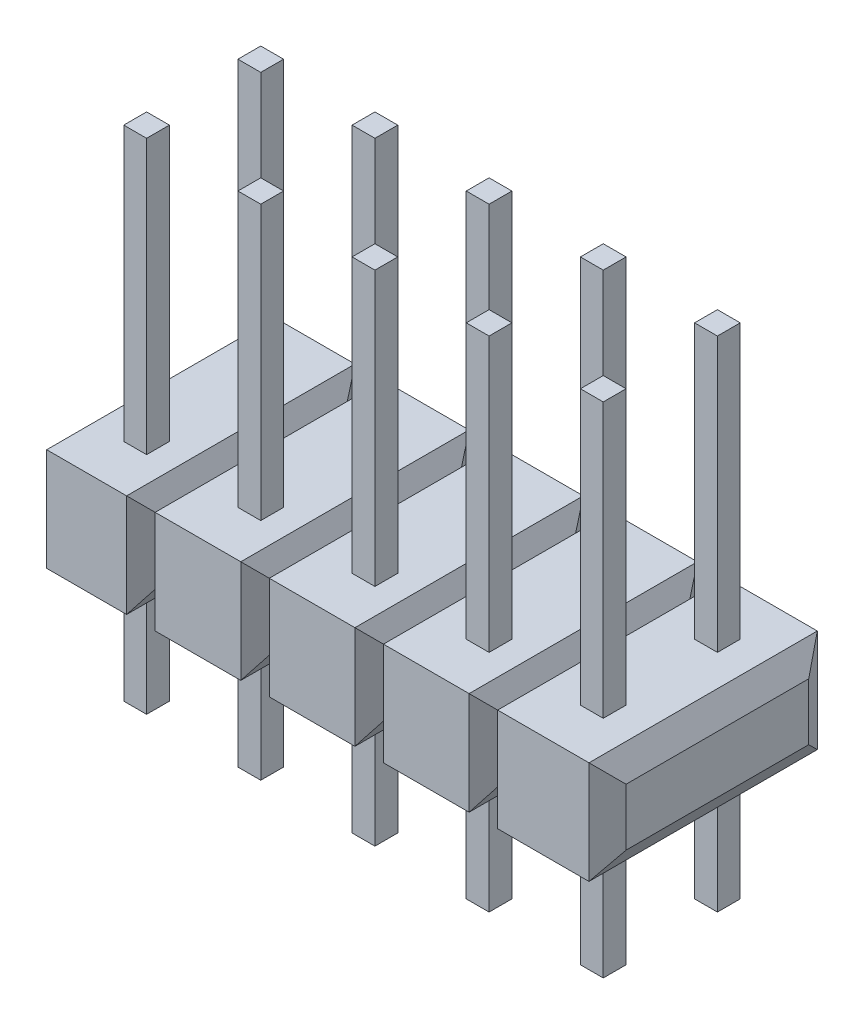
ISO-10303-21;
HEADER;
FILE_DESCRIPTION(('STEP AP214'),'2;1');
FILE_NAME('part.step','',(''),(''),'','','');
FILE_SCHEMA(('AUTOMOTIVE_DESIGN { 1 0 10303 214 1 1 1 1 }'));
ENDSEC;
DATA;
#1=APPLICATION_CONTEXT('core data for automotive mechanical design processes');
#2=APPLICATION_PROTOCOL_DEFINITION('international standard','automotive_design',2000,#1);
#3=PRODUCT_CONTEXT('',#1,'mechanical');
#4=PRODUCT('Part','Part','',(#3));
#5=PRODUCT_RELATED_PRODUCT_CATEGORY('part','',(#4));
#6=PRODUCT_DEFINITION_FORMATION('','',#4);
#7=PRODUCT_DEFINITION_CONTEXT('part definition',#1,'design');
#8=PRODUCT_DEFINITION('design','',#6,#7);
#9=PRODUCT_DEFINITION_SHAPE('','',#8);
#10=(LENGTH_UNIT() NAMED_UNIT(*) SI_UNIT(.MILLI.,.METRE.));
#11=(NAMED_UNIT(*) PLANE_ANGLE_UNIT() SI_UNIT($,.RADIAN.));
#12=(NAMED_UNIT(*) SI_UNIT($,.STERADIAN.) SOLID_ANGLE_UNIT());
#13=UNCERTAINTY_MEASURE_WITH_UNIT(LENGTH_MEASURE(1.E-05),#10,'distance_accuracy_value','');
#14=(GEOMETRIC_REPRESENTATION_CONTEXT(3) GLOBAL_UNCERTAINTY_ASSIGNED_CONTEXT((#13)) GLOBAL_UNIT_ASSIGNED_CONTEXT((#10,
#11,#12)) REPRESENTATION_CONTEXT('',''));
#15=CARTESIAN_POINT('',(0.,0.,0.));
#16=DIRECTION('',(0.,0.,1.));
#17=DIRECTION('',(1.,0.,0.));
#18=AXIS2_PLACEMENT_3D('',#15,#16,#17);
#19=CARTESIAN_POINT('',(-4.826,-1.143,2.032));
#20=DIRECTION('',(1.,0.,0.));
#21=DIRECTION('',(0.,0.,-1.));
#22=AXIS2_PLACEMENT_3D('',#19,#20,#21);
#23=PLANE('',#22);
#24=DIRECTION('',(0.,1.,0.));
#25=VECTOR('',#24,1.);
#26=CARTESIAN_POINT('',(-4.826,7.239,1.524));
#27=LINE('',#26,#25);
#28=CARTESIAN_POINT('',(-4.826,1.143,1.524));
#29=VERTEX_POINT('',#28);
#30=CARTESIAN_POINT('',(-4.826,7.239,1.524));
#31=VERTEX_POINT('',#30);
#32=EDGE_CURVE('E713',#29,#31,#27,.T.);
#33=ORIENTED_EDGE('',*,*,#32,.F.);
#34=DIRECTION('',(0.,0.,-1.));
#35=VECTOR('',#34,1.);
#36=CARTESIAN_POINT('',(-4.826,1.143,2.032));
#37=LINE('',#36,#35);
#38=CARTESIAN_POINT('',(-4.826,1.143,1.016));
#39=VERTEX_POINT('',#38);
#40=EDGE_CURVE('E21',#29,#39,#37,.T.);
#41=ORIENTED_EDGE('',*,*,#40,.T.);
#42=DIRECTION('',(0.,1.,0.));
#43=VECTOR('',#42,1.);
#44=CARTESIAN_POINT('',(-4.826,1.143,1.016));
#45=LINE('',#44,#43);
#46=CARTESIAN_POINT('',(-4.826,7.239,1.016));
#47=VERTEX_POINT('',#46);
#48=EDGE_CURVE('E711',#47,#39,#45,.F.);
#49=ORIENTED_EDGE('',*,*,#48,.F.);
#50=DIRECTION('',(0.,0.,1.));
#51=VECTOR('',#50,1.);
#52=CARTESIAN_POINT('',(-4.826,7.239,1.016));
#53=LINE('',#52,#51);
#54=EDGE_CURVE('E705',#31,#47,#53,.F.);
#55=ORIENTED_EDGE('',*,*,#54,.F.);
#56=EDGE_LOOP('',(#33,#41,#49,#55));
#57=FACE_BOUND('',#56,.T.);
#58=ADVANCED_FACE('F18',(#57),#23,.T.);
#59=CARTESIAN_POINT('',(-4.826,-1.143,2.032));
#60=DIRECTION('',(1.,0.,0.));
#61=DIRECTION('',(0.,0.,-1.));
#62=AXIS2_PLACEMENT_3D('',#59,#60,#61);
#63=PLANE('',#62);
#64=DIRECTION('',(0.,1.,0.));
#65=VECTOR('',#64,1.);
#66=CARTESIAN_POINT('',(-4.826,7.239,-1.016));
#67=LINE('',#66,#65);
#68=CARTESIAN_POINT('',(-4.826,1.143,-1.016));
#69=VERTEX_POINT('',#68);
#70=CARTESIAN_POINT('',(-4.826,7.239,-1.016));
#71=VERTEX_POINT('',#70);
#72=EDGE_CURVE('E741',#69,#71,#67,.T.);
#73=ORIENTED_EDGE('',*,*,#72,.F.);
#74=DIRECTION('',(0.,0.,-1.));
#75=VECTOR('',#74,1.);
#76=CARTESIAN_POINT('',(-4.826,1.143,2.032));
#77=LINE('',#76,#75);
#78=CARTESIAN_POINT('',(-4.826,1.143,-1.524));
#79=VERTEX_POINT('',#78);
#80=EDGE_CURVE('E717',#69,#79,#77,.T.);
#81=ORIENTED_EDGE('',*,*,#80,.T.);
#82=DIRECTION('',(0.,1.,0.));
#83=VECTOR('',#82,1.);
#84=CARTESIAN_POINT('',(-4.826,1.143,-1.524));
#85=LINE('',#84,#83);
#86=CARTESIAN_POINT('',(-4.826,7.239,-1.524));
#87=VERTEX_POINT('',#86);
#88=EDGE_CURVE('E739',#87,#79,#85,.F.);
#89=ORIENTED_EDGE('',*,*,#88,.F.);
#90=DIRECTION('',(0.,0.,1.));
#91=VECTOR('',#90,1.);
#92=CARTESIAN_POINT('',(-4.826,7.239,-1.524));
#93=LINE('',#92,#91);
#94=EDGE_CURVE('E756',#71,#87,#93,.F.);
#95=ORIENTED_EDGE('',*,*,#94,.F.);
#96=EDGE_LOOP('',(#73,#81,#89,#95));
#97=FACE_BOUND('',#96,.T.);
#98=ADVANCED_FACE('F737',(#97),#63,.T.);
#99=CARTESIAN_POINT('',(-5.334,1.143,1.016));
#100=DIRECTION('',(0.,0.,-1.));
#101=DIRECTION('',(-1.,0.,0.));
#102=AXIS2_PLACEMENT_3D('',#99,#100,#101);
#103=PLANE('',#102);
#104=ORIENTED_EDGE('',*,*,#48,.T.);
#105=DIRECTION('',(-1.,0.,0.));
#106=VECTOR('',#105,1.);
#107=CARTESIAN_POINT('',(-5.334,1.143,1.016));
#108=LINE('',#107,#106);
#109=CARTESIAN_POINT('',(-5.334,1.143,1.016));
#110=VERTEX_POINT('',#109);
#111=EDGE_CURVE('E721',#39,#110,#108,.T.);
#112=ORIENTED_EDGE('',*,*,#111,.T.);
#113=DIRECTION('',(0.,1.,0.));
#114=VECTOR('',#113,1.);
#115=CARTESIAN_POINT('',(-5.334,-1.143,1.016));
#116=LINE('',#115,#114);
#117=CARTESIAN_POINT('',(-5.334,7.239,1.016));
#118=VERTEX_POINT('',#117);
#119=EDGE_CURVE('E771',#110,#118,#116,.T.);
#120=ORIENTED_EDGE('',*,*,#119,.T.);
#121=DIRECTION('',(1.,0.,0.));
#122=VECTOR('',#121,1.);
#123=CARTESIAN_POINT('',(-5.334,7.239,1.016));
#124=LINE('',#123,#122);
#125=EDGE_CURVE('E723',#47,#118,#124,.F.);
#126=ORIENTED_EDGE('',*,*,#125,.F.);
#127=EDGE_LOOP('',(#104,#112,#120,#126));
#128=FACE_BOUND('',#127,.T.);
#129=ADVANCED_FACE('F719',(#128),#103,.T.);
#130=CARTESIAN_POINT('',(-5.334,7.239,1.016));
#131=DIRECTION('',(0.,1.,0.));
#132=DIRECTION('',(0.,0.,1.));
#133=AXIS2_PLACEMENT_3D('',#130,#131,#132);
#134=PLANE('',#133);
#135=ORIENTED_EDGE('',*,*,#125,.T.);
#136=DIRECTION('',(0.,0.,-1.));
#137=VECTOR('',#136,1.);
#138=CARTESIAN_POINT('',(-5.334,7.239,2.032));
#139=LINE('',#138,#137);
#140=CARTESIAN_POINT('',(-5.334,7.239,1.524));
#141=VERTEX_POINT('',#140);
#142=EDGE_CURVE('E767',#118,#141,#139,.F.);
#143=ORIENTED_EDGE('',*,*,#142,.T.);
#144=DIRECTION('',(1.,0.,0.));
#145=VECTOR('',#144,1.);
#146=CARTESIAN_POINT('',(-5.334,7.239,1.524));
#147=LINE('',#146,#145);
#148=EDGE_CURVE('E762',#31,#141,#147,.F.);
#149=ORIENTED_EDGE('',*,*,#148,.F.);
#150=ORIENTED_EDGE('',*,*,#54,.T.);
#151=EDGE_LOOP('',(#135,#143,#149,#150));
#152=FACE_BOUND('',#151,.T.);
#153=ADVANCED_FACE('F766',(#152),#134,.T.);
#154=CARTESIAN_POINT('',(-5.334,7.239,1.524));
#155=DIRECTION('',(0.,0.,1.));
#156=DIRECTION('',(1.,0.,0.));
#157=AXIS2_PLACEMENT_3D('',#154,#155,#156);
#158=PLANE('',#157);
#159=DIRECTION('',(0.,1.,0.));
#160=VECTOR('',#159,1.);
#161=CARTESIAN_POINT('',(-5.334,-1.143,1.524));
#162=LINE('',#161,#160);
#163=CARTESIAN_POINT('',(-5.334,1.143,1.524));
#164=VERTEX_POINT('',#163);
#165=EDGE_CURVE('E773',#141,#164,#162,.F.);
#166=ORIENTED_EDGE('',*,*,#165,.T.);
#167=DIRECTION('',(1.,0.,0.));
#168=VECTOR('',#167,1.);
#169=CARTESIAN_POINT('',(-5.334,1.143,1.524));
#170=LINE('',#169,#168);
#171=EDGE_CURVE('E751',#164,#29,#170,.T.);
#172=ORIENTED_EDGE('',*,*,#171,.T.);
#173=ORIENTED_EDGE('',*,*,#32,.T.);
#174=ORIENTED_EDGE('',*,*,#148,.T.);
#175=EDGE_LOOP('',(#166,#172,#173,#174));
#176=FACE_BOUND('',#175,.T.);
#177=ADVANCED_FACE('F2237',(#176),#158,.T.);
#178=CARTESIAN_POINT('',(-5.334,1.143,-1.524));
#179=DIRECTION('',(0.,0.,-1.));
#180=DIRECTION('',(-1.,0.,0.));
#181=AXIS2_PLACEMENT_3D('',#178,#179,#180);
#182=PLANE('',#181);
#183=ORIENTED_EDGE('',*,*,#88,.T.);
#184=DIRECTION('',(-1.,0.,0.));
#185=VECTOR('',#184,1.);
#186=CARTESIAN_POINT('',(-5.334,1.143,-1.524));
#187=LINE('',#186,#185);
#188=CARTESIAN_POINT('',(-5.334,1.143,-1.524));
#189=VERTEX_POINT('',#188);
#190=EDGE_CURVE('E748',#79,#189,#187,.T.);
#191=ORIENTED_EDGE('',*,*,#190,.T.);
#192=DIRECTION('',(0.,1.,0.));
#193=VECTOR('',#192,1.);
#194=CARTESIAN_POINT('',(-5.334,-1.143,-1.524));
#195=LINE('',#194,#193);
#196=CARTESIAN_POINT('',(-5.334,7.239,-1.524));
#197=VERTEX_POINT('',#196);
#198=EDGE_CURVE('E795',#189,#197,#195,.T.);
#199=ORIENTED_EDGE('',*,*,#198,.T.);
#200=DIRECTION('',(1.,0.,0.));
#201=VECTOR('',#200,1.);
#202=CARTESIAN_POINT('',(-5.334,7.239,-1.524));
#203=LINE('',#202,#201);
#204=EDGE_CURVE('E750',#87,#197,#203,.F.);
#205=ORIENTED_EDGE('',*,*,#204,.F.);
#206=EDGE_LOOP('',(#183,#191,#199,#205));
#207=FACE_BOUND('',#206,.T.);
#208=ADVANCED_FACE('F746',(#207),#182,.T.);
#209=CARTESIAN_POINT('',(-5.334,7.239,-1.524));
#210=DIRECTION('',(0.,1.,0.));
#211=DIRECTION('',(0.,0.,1.));
#212=AXIS2_PLACEMENT_3D('',#209,#210,#211);
#213=PLANE('',#212);
#214=ORIENTED_EDGE('',*,*,#204,.T.);
#215=DIRECTION('',(0.,0.,-1.));
#216=VECTOR('',#215,1.);
#217=CARTESIAN_POINT('',(-5.334,7.239,2.032));
#218=LINE('',#217,#216);
#219=CARTESIAN_POINT('',(-5.334,7.239,-1.016));
#220=VERTEX_POINT('',#219);
#221=EDGE_CURVE('E791',#197,#220,#218,.F.);
#222=ORIENTED_EDGE('',*,*,#221,.T.);
#223=DIRECTION('',(1.,0.,0.));
#224=VECTOR('',#223,1.);
#225=CARTESIAN_POINT('',(-5.334,7.239,-1.016));
#226=LINE('',#225,#224);
#227=EDGE_CURVE('E784',#71,#220,#226,.F.);
#228=ORIENTED_EDGE('',*,*,#227,.F.);
#229=ORIENTED_EDGE('',*,*,#94,.T.);
#230=EDGE_LOOP('',(#214,#222,#228,#229));
#231=FACE_BOUND('',#230,.T.);
#232=ADVANCED_FACE('F789',(#231),#213,.T.);
#233=CARTESIAN_POINT('',(-5.334,7.239,-1.016));
#234=DIRECTION('',(0.,0.,1.));
#235=DIRECTION('',(1.,0.,0.));
#236=AXIS2_PLACEMENT_3D('',#233,#234,#235);
#237=PLANE('',#236);
#238=DIRECTION('',(0.,1.,0.));
#239=VECTOR('',#238,1.);
#240=CARTESIAN_POINT('',(-5.334,-1.143,-1.016));
#241=LINE('',#240,#239);
#242=CARTESIAN_POINT('',(-5.334,1.143,-1.016));
#243=VERTEX_POINT('',#242);
#244=EDGE_CURVE('E797',#220,#243,#241,.F.);
#245=ORIENTED_EDGE('',*,*,#244,.T.);
#246=DIRECTION('',(1.,0.,0.));
#247=VECTOR('',#246,1.);
#248=CARTESIAN_POINT('',(-5.334,1.143,-1.016));
#249=LINE('',#248,#247);
#250=EDGE_CURVE('E782',#243,#69,#249,.T.);
#251=ORIENTED_EDGE('',*,*,#250,.T.);
#252=ORIENTED_EDGE('',*,*,#72,.T.);
#253=ORIENTED_EDGE('',*,*,#227,.T.);
#254=EDGE_LOOP('',(#245,#251,#252,#253));
#255=FACE_BOUND('',#254,.T.);
#256=ADVANCED_FACE('F2228',(#255),#237,.T.);
#257=CARTESIAN_POINT('',(-5.334,-3.8608,1.016));
#258=DIRECTION('',(0.,0.,-1.));
#259=DIRECTION('',(-1.,0.,0.));
#260=AXIS2_PLACEMENT_3D('',#257,#258,#259);
#261=PLANE('',#260);
#262=DIRECTION('',(0.,1.,0.));
#263=VECTOR('',#262,1.);
#264=CARTESIAN_POINT('',(-5.334,-1.143,1.016));
#265=LINE('',#264,#263);
#266=CARTESIAN_POINT('',(-5.334,-3.8608,1.016));
#267=VERTEX_POINT('',#266);
#268=CARTESIAN_POINT('',(-5.334,-1.143,1.016));
#269=VERTEX_POINT('',#268);
#270=EDGE_CURVE('E833',#267,#269,#265,.T.);
#271=ORIENTED_EDGE('',*,*,#270,.T.);
#272=DIRECTION('',(-1.,0.,0.));
#273=VECTOR('',#272,1.);
#274=CARTESIAN_POINT('',(-5.334,-1.143,1.016));
#275=LINE('',#274,#273);
#276=CARTESIAN_POINT('',(-4.826,-1.143,1.016));
#277=VERTEX_POINT('',#276);
#278=EDGE_CURVE('E777',#269,#277,#275,.F.);
#279=ORIENTED_EDGE('',*,*,#278,.T.);
#280=DIRECTION('',(0.,1.,0.));
#281=VECTOR('',#280,1.);
#282=CARTESIAN_POINT('',(-4.826,-1.143,1.016));
#283=LINE('',#282,#281);
#284=CARTESIAN_POINT('',(-4.826,-3.8608,1.016));
#285=VERTEX_POINT('',#284);
#286=EDGE_CURVE('E844',#285,#277,#283,.T.);
#287=ORIENTED_EDGE('',*,*,#286,.F.);
#288=DIRECTION('',(1.,0.,0.));
#289=VECTOR('',#288,1.);
#290=CARTESIAN_POINT('',(-5.334,-3.8608,1.016));
#291=LINE('',#290,#289);
#292=EDGE_CURVE('E836',#267,#285,#291,.T.);
#293=ORIENTED_EDGE('',*,*,#292,.F.);
#294=EDGE_LOOP('',(#271,#279,#287,#293));
#295=FACE_BOUND('',#294,.T.);
#296=ADVANCED_FACE('F2224',(#295),#261,.T.);
#297=CARTESIAN_POINT('',(-5.334,-3.8608,-1.524));
#298=DIRECTION('',(0.,0.,-1.));
#299=DIRECTION('',(-1.,0.,0.));
#300=AXIS2_PLACEMENT_3D('',#297,#298,#299);
#301=PLANE('',#300);
#302=DIRECTION('',(0.,1.,0.));
#303=VECTOR('',#302,1.);
#304=CARTESIAN_POINT('',(-5.334,-1.143,-1.524));
#305=LINE('',#304,#303);
#306=CARTESIAN_POINT('',(-5.334,-3.8608,-1.524));
#307=VERTEX_POINT('',#306);
#308=CARTESIAN_POINT('',(-5.334,-1.143,-1.524));
#309=VERTEX_POINT('',#308);
#310=EDGE_CURVE('E851',#307,#309,#305,.T.);
#311=ORIENTED_EDGE('',*,*,#310,.T.);
#312=DIRECTION('',(-1.,0.,0.));
#313=VECTOR('',#312,1.);
#314=CARTESIAN_POINT('',(-5.334,-1.143,-1.524));
#315=LINE('',#314,#313);
#316=CARTESIAN_POINT('',(-4.826,-1.143,-1.524));
#317=VERTEX_POINT('',#316);
#318=EDGE_CURVE('E775',#309,#317,#315,.F.);
#319=ORIENTED_EDGE('',*,*,#318,.T.);
#320=DIRECTION('',(0.,1.,0.));
#321=VECTOR('',#320,1.);
#322=CARTESIAN_POINT('',(-4.826,-1.143,-1.524));
#323=LINE('',#322,#321);
#324=CARTESIAN_POINT('',(-4.826,-3.8608,-1.524));
#325=VERTEX_POINT('',#324);
#326=EDGE_CURVE('E862',#325,#317,#323,.T.);
#327=ORIENTED_EDGE('',*,*,#326,.F.);
#328=DIRECTION('',(1.,0.,0.));
#329=VECTOR('',#328,1.);
#330=CARTESIAN_POINT('',(-5.334,-3.8608,-1.524));
#331=LINE('',#330,#329);
#332=EDGE_CURVE('E854',#307,#325,#331,.T.);
#333=ORIENTED_EDGE('',*,*,#332,.F.);
#334=EDGE_LOOP('',(#311,#319,#327,#333));
#335=FACE_BOUND('',#334,.T.);
#336=ADVANCED_FACE('F2220',(#335),#301,.T.);
#337=CARTESIAN_POINT('',(-6.19125,0.889,0.));
#338=DIRECTION('',(-0.847998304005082,0.529998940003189,0.));
#339=DIRECTION('',(-0.529998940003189,-0.847998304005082,0.));
#340=AXIS2_PLACEMENT_3D('',#337,#338,#339);
#341=PLANE('',#340);
#342=DIRECTION('',(0.,0.,1.));
#343=VECTOR('',#342,1.);
#344=CARTESIAN_POINT('',(-6.35,0.635,-2.032));
#345=LINE('',#344,#343);
#346=CARTESIAN_POINT('',(-6.35,0.635000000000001,2.032));
#347=VERTEX_POINT('',#346);
#348=CARTESIAN_POINT('',(-6.35,0.635000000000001,-2.032));
#349=VERTEX_POINT('',#348);
#350=EDGE_CURVE('E802',#347,#349,#345,.F.);
#351=ORIENTED_EDGE('',*,*,#350,.F.);
#352=DIRECTION('',(-0.404226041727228,-0.646761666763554,-0.646761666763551));
#353=VECTOR('',#352,1.);
#354=CARTESIAN_POINT('',(-6.03249999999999,1.143,2.54));
#355=LINE('',#354,#353);
#356=CARTESIAN_POINT('',(-6.0325,1.143,2.54));
#357=VERTEX_POINT('',#356);
#358=EDGE_CURVE('E814',#357,#347,#355,.T.);
#359=ORIENTED_EDGE('',*,*,#358,.F.);
#360=DIRECTION('',(0.,0.,1.));
#361=VECTOR('',#360,1.);
#362=CARTESIAN_POINT('',(-6.0325,1.143,0.));
#363=LINE('',#362,#361);
#364=CARTESIAN_POINT('',(-6.0325,1.143,-2.54));
#365=VERTEX_POINT('',#364);
#366=EDGE_CURVE('E867',#365,#357,#363,.T.);
#367=ORIENTED_EDGE('',*,*,#366,.F.);
#368=DIRECTION('',(0.404226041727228,0.646761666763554,-0.646761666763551));
#369=VECTOR('',#368,1.);
#370=CARTESIAN_POINT('',(-6.35,0.635000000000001,-2.032));
#371=LINE('',#370,#369);
#372=EDGE_CURVE('E829',#349,#365,#371,.T.);
#373=ORIENTED_EDGE('',*,*,#372,.F.);
#374=EDGE_LOOP('',(#351,#359,#367,#373));
#375=FACE_BOUND('',#374,.T.);
#376=ADVANCED_FACE('F2217',(#375),#341,.T.);
#377=CARTESIAN_POINT('',(-5.334,-1.143,2.032));
#378=DIRECTION('',(1.,0.,0.));
#379=DIRECTION('',(0.,0.,-1.));
#380=AXIS2_PLACEMENT_3D('',#377,#378,#379);
#381=PLANE('',#380);
#382=ORIENTED_EDGE('',*,*,#142,.F.);
#383=ORIENTED_EDGE('',*,*,#119,.F.);
#384=DIRECTION('',(0.,0.,1.));
#385=VECTOR('',#384,1.);
#386=CARTESIAN_POINT('',(-5.334,1.143,0.));
#387=LINE('',#386,#385);
#388=EDGE_CURVE('E729',#164,#110,#387,.F.);
#389=ORIENTED_EDGE('',*,*,#388,.F.);
#390=ORIENTED_EDGE('',*,*,#165,.F.);
#391=EDGE_LOOP('',(#382,#383,#389,#390));
#392=FACE_BOUND('',#391,.T.);
#393=ADVANCED_FACE('F770',(#392),#381,.F.);
#394=CARTESIAN_POINT('',(-5.334,-1.143,2.032));
#395=DIRECTION('',(1.,0.,0.));
#396=DIRECTION('',(0.,0.,-1.));
#397=AXIS2_PLACEMENT_3D('',#394,#395,#396);
#398=PLANE('',#397);
#399=ORIENTED_EDGE('',*,*,#221,.F.);
#400=ORIENTED_EDGE('',*,*,#198,.F.);
#401=DIRECTION('',(0.,0.,1.));
#402=VECTOR('',#401,1.);
#403=CARTESIAN_POINT('',(-5.334,1.143,0.));
#404=LINE('',#403,#402);
#405=EDGE_CURVE('E755',#243,#189,#404,.F.);
#406=ORIENTED_EDGE('',*,*,#405,.F.);
#407=ORIENTED_EDGE('',*,*,#244,.F.);
#408=EDGE_LOOP('',(#399,#400,#406,#407));
#409=FACE_BOUND('',#408,.T.);
#410=ADVANCED_FACE('F794',(#409),#398,.F.);
#411=CARTESIAN_POINT('',(-6.35,-1.143,-2.032));
#412=DIRECTION('',(-1.,0.,0.));
#413=DIRECTION('',(0.,0.,1.));
#414=AXIS2_PLACEMENT_3D('',#411,#412,#413);
#415=PLANE('',#414);
#416=DIRECTION('',(0.,1.,0.));
#417=VECTOR('',#416,1.);
#418=CARTESIAN_POINT('',(-6.35,-1.143,2.032));
#419=LINE('',#418,#417);
#420=CARTESIAN_POINT('',(-6.35,-0.635,2.032));
#421=VERTEX_POINT('',#420);
#422=EDGE_CURVE('E812',#347,#421,#419,.F.);
#423=ORIENTED_EDGE('',*,*,#422,.F.);
#424=ORIENTED_EDGE('',*,*,#350,.T.);
#425=DIRECTION('',(0.,1.,0.));
#426=VECTOR('',#425,1.);
#427=CARTESIAN_POINT('',(-6.35,-1.143,-2.032));
#428=LINE('',#427,#426);
#429=CARTESIAN_POINT('',(-6.35,-0.635,-2.032));
#430=VERTEX_POINT('',#429);
#431=EDGE_CURVE('E826',#430,#349,#428,.T.);
#432=ORIENTED_EDGE('',*,*,#431,.F.);
#433=DIRECTION('',(0.,0.,1.));
#434=VECTOR('',#433,1.);
#435=CARTESIAN_POINT('',(-6.35,-0.635000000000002,0.));
#436=LINE('',#435,#434);
#437=EDGE_CURVE('E878',#421,#430,#436,.F.);
#438=ORIENTED_EDGE('',*,*,#437,.F.);
#439=EDGE_LOOP('',(#423,#424,#432,#438));
#440=FACE_BOUND('',#439,.T.);
#441=ADVANCED_FACE('F2208',(#440),#415,.T.);
#442=CARTESIAN_POINT('',(-3.937,1.143,1.99007386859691));
#443=DIRECTION('',(-0.866025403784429,0.,-0.500000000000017));
#444=DIRECTION('',(-0.500000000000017,0.,0.866025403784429));
#445=AXIS2_PLACEMENT_3D('',#442,#443,#444);
#446=PLANE('',#445);
#447=DIRECTION('',(-0.377964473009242,-0.654653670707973,0.654653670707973));
#448=VECTOR('',#447,1.);
#449=CARTESIAN_POINT('',(-3.937,-0.593073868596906,1.99007386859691));
#450=LINE('',#449,#448);
#451=CARTESIAN_POINT('',(-3.937,-0.593073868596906,1.99007386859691));
#452=VERTEX_POINT('',#451);
#453=CARTESIAN_POINT('',(-4.2545,-1.143,2.54));
#454=VERTEX_POINT('',#453);
#455=EDGE_CURVE('E810',#452,#454,#450,.T.);
#456=ORIENTED_EDGE('',*,*,#455,.F.);
#457=DIRECTION('',(0.,1.,0.));
#458=VECTOR('',#457,1.);
#459=CARTESIAN_POINT('',(-3.937,1.143,1.99007386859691));
#460=LINE('',#459,#458);
#461=CARTESIAN_POINT('',(-3.937,0.593073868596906,1.99007386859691));
#462=VERTEX_POINT('',#461);
#463=EDGE_CURVE('E807',#462,#452,#460,.F.);
#464=ORIENTED_EDGE('',*,*,#463,.F.);
#465=DIRECTION('',(0.377964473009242,-0.654653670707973,-0.654653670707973));
#466=VECTOR('',#465,1.);
#467=CARTESIAN_POINT('',(-4.2545,1.143,2.54));
#468=LINE('',#467,#466);
#469=CARTESIAN_POINT('',(-4.2545,1.143,2.54));
#470=VERTEX_POINT('',#469);
#471=EDGE_CURVE('E804',#470,#462,#468,.T.);
#472=ORIENTED_EDGE('',*,*,#471,.F.);
#473=DIRECTION('',(0.,1.,0.));
#474=VECTOR('',#473,1.);
#475=CARTESIAN_POINT('',(-4.2545,-1.143,2.54));
#476=LINE('',#475,#474);
#477=EDGE_CURVE('E882',#454,#470,#476,.T.);
#478=ORIENTED_EDGE('',*,*,#477,.F.);
#479=EDGE_LOOP('',(#456,#464,#472,#478));
#480=FACE_BOUND('',#479,.T.);
#481=ADVANCED_FACE('F2204',(#480),#446,.F.);
#482=CARTESIAN_POINT('',(-6.35,-1.143,2.032));
#483=DIRECTION('',(-0.847998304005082,0.,0.529998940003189));
#484=DIRECTION('',(0.529998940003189,0.,0.847998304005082));
#485=AXIS2_PLACEMENT_3D('',#482,#483,#484);
#486=PLANE('',#485);
#487=DIRECTION('',(0.,1.,0.));
#488=VECTOR('',#487,1.);
#489=CARTESIAN_POINT('',(-6.0325,-1.143,2.54));
#490=LINE('',#489,#488);
#491=CARTESIAN_POINT('',(-6.0325,-1.143,2.54));
#492=VERTEX_POINT('',#491);
#493=EDGE_CURVE('E888',#357,#492,#490,.F.);
#494=ORIENTED_EDGE('',*,*,#493,.F.);
#495=ORIENTED_EDGE('',*,*,#358,.T.);
#496=ORIENTED_EDGE('',*,*,#422,.T.);
#497=DIRECTION('',(-0.404226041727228,0.64676166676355,-0.646761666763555));
#498=VECTOR('',#497,1.);
#499=CARTESIAN_POINT('',(-6.0325,-1.143,2.54));
#500=LINE('',#499,#498);
#501=EDGE_CURVE('E875',#492,#421,#500,.T.);
#502=ORIENTED_EDGE('',*,*,#501,.F.);
#503=EDGE_LOOP('',(#494,#495,#496,#502));
#504=FACE_BOUND('',#503,.T.);
#505=ADVANCED_FACE('F2200',(#504),#486,.T.);
#506=CARTESIAN_POINT('',(-4.2545,1.143,-2.54));
#507=DIRECTION('',(-0.866025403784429,0.,0.500000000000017));
#508=DIRECTION('',(0.500000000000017,0.,0.866025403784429));
#509=AXIS2_PLACEMENT_3D('',#506,#507,#508);
#510=PLANE('',#509);
#511=DIRECTION('',(0.377964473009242,0.654653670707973,0.654653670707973));
#512=VECTOR('',#511,1.);
#513=CARTESIAN_POINT('',(-4.2545,-1.143,-2.54));
#514=LINE('',#513,#512);
#515=CARTESIAN_POINT('',(-4.2545,-1.143,-2.54));
#516=VERTEX_POINT('',#515);
#517=CARTESIAN_POINT('',(-3.937,-0.593073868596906,-1.99007386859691));
#518=VERTEX_POINT('',#517);
#519=EDGE_CURVE('E820',#516,#518,#514,.T.);
#520=ORIENTED_EDGE('',*,*,#519,.F.);
#521=DIRECTION('',(0.,1.,0.));
#522=VECTOR('',#521,1.);
#523=CARTESIAN_POINT('',(-4.2545,-1.143,-2.54));
#524=LINE('',#523,#522);
#525=CARTESIAN_POINT('',(-4.2545,1.143,-2.54));
#526=VERTEX_POINT('',#525);
#527=EDGE_CURVE('E892',#526,#516,#524,.F.);
#528=ORIENTED_EDGE('',*,*,#527,.F.);
#529=DIRECTION('',(-0.377964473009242,0.654653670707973,-0.654653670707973));
#530=VECTOR('',#529,1.);
#531=CARTESIAN_POINT('',(-3.937,0.593073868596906,-1.99007386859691));
#532=LINE('',#531,#530);
#533=CARTESIAN_POINT('',(-3.937,0.593073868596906,-1.99007386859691));
#534=VERTEX_POINT('',#533);
#535=EDGE_CURVE('E817',#534,#526,#532,.T.);
#536=ORIENTED_EDGE('',*,*,#535,.F.);
#537=DIRECTION('',(0.,1.,0.));
#538=VECTOR('',#537,1.);
#539=CARTESIAN_POINT('',(-3.937,1.143,-1.99007386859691));
#540=LINE('',#539,#538);
#541=EDGE_CURVE('E823',#518,#534,#540,.T.);
#542=ORIENTED_EDGE('',*,*,#541,.F.);
#543=EDGE_LOOP('',(#520,#528,#536,#542));
#544=FACE_BOUND('',#543,.T.);
#545=ADVANCED_FACE('F2196',(#544),#510,.F.);
#546=CARTESIAN_POINT('',(-6.0325,-1.143,-2.54));
#547=DIRECTION('',(-0.847998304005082,0.,-0.529998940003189));
#548=DIRECTION('',(-0.529998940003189,0.,0.847998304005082));
#549=AXIS2_PLACEMENT_3D('',#546,#547,#548);
#550=PLANE('',#549);
#551=ORIENTED_EDGE('',*,*,#431,.T.);
#552=ORIENTED_EDGE('',*,*,#372,.T.);
#553=DIRECTION('',(0.,1.,0.));
#554=VECTOR('',#553,1.);
#555=CARTESIAN_POINT('',(-6.0325,-1.143,-2.54));
#556=LINE('',#555,#554);
#557=CARTESIAN_POINT('',(-6.0325,-1.143,-2.54));
#558=VERTEX_POINT('',#557);
#559=EDGE_CURVE('E895',#558,#365,#556,.T.);
#560=ORIENTED_EDGE('',*,*,#559,.F.);
#561=DIRECTION('',(0.404226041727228,-0.64676166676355,-0.646761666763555));
#562=VECTOR('',#561,1.);
#563=CARTESIAN_POINT('',(-6.35,-0.635000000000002,-2.032));
#564=LINE('',#563,#562);
#565=EDGE_CURVE('E880',#430,#558,#564,.T.);
#566=ORIENTED_EDGE('',*,*,#565,.F.);
#567=EDGE_LOOP('',(#551,#552,#560,#566));
#568=FACE_BOUND('',#567,.T.);
#569=ADVANCED_FACE('F2192',(#568),#550,.T.);
#570=CARTESIAN_POINT('',(-5.334,-1.143,2.032));
#571=DIRECTION('',(1.,0.,0.));
#572=DIRECTION('',(0.,0.,-1.));
#573=AXIS2_PLACEMENT_3D('',#570,#571,#572);
#574=PLANE('',#573);
#575=DIRECTION('',(0.,0.,-1.));
#576=VECTOR('',#575,1.);
#577=CARTESIAN_POINT('',(-5.334,-3.8608,1.524));
#578=LINE('',#577,#576);
#579=CARTESIAN_POINT('',(-5.334,-3.8608,1.524));
#580=VERTEX_POINT('',#579);
#581=EDGE_CURVE('E838',#580,#267,#578,.T.);
#582=ORIENTED_EDGE('',*,*,#581,.F.);
#583=DIRECTION('',(0.,1.,0.));
#584=VECTOR('',#583,1.);
#585=CARTESIAN_POINT('',(-5.334,-1.143,1.524));
#586=LINE('',#585,#584);
#587=CARTESIAN_POINT('',(-5.334,-1.143,1.524));
#588=VERTEX_POINT('',#587);
#589=EDGE_CURVE('E898',#588,#580,#586,.F.);
#590=ORIENTED_EDGE('',*,*,#589,.F.);
#591=DIRECTION('',(0.,0.,-1.));
#592=VECTOR('',#591,1.);
#593=CARTESIAN_POINT('',(-5.334,-1.143,2.032));
#594=LINE('',#593,#592);
#595=EDGE_CURVE('E831',#269,#588,#594,.F.);
#596=ORIENTED_EDGE('',*,*,#595,.F.);
#597=ORIENTED_EDGE('',*,*,#270,.F.);
#598=EDGE_LOOP('',(#582,#590,#596,#597));
#599=FACE_BOUND('',#598,.T.);
#600=ADVANCED_FACE('F2188',(#599),#574,.F.);
#601=CARTESIAN_POINT('',(-5.334,-3.8608,1.524));
#602=DIRECTION('',(0.,-1.,0.));
#603=DIRECTION('',(0.,0.,-1.));
#604=AXIS2_PLACEMENT_3D('',#601,#602,#603);
#605=PLANE('',#604);
#606=DIRECTION('',(1.,0.,0.));
#607=VECTOR('',#606,1.);
#608=CARTESIAN_POINT('',(-5.334,-3.8608,1.524));
#609=LINE('',#608,#607);
#610=CARTESIAN_POINT('',(-4.826,-3.8608,1.524));
#611=VERTEX_POINT('',#610);
#612=EDGE_CURVE('E900',#580,#611,#609,.T.);
#613=ORIENTED_EDGE('',*,*,#612,.F.);
#614=ORIENTED_EDGE('',*,*,#581,.T.);
#615=ORIENTED_EDGE('',*,*,#292,.T.);
#616=DIRECTION('',(0.,0.,-1.));
#617=VECTOR('',#616,1.);
#618=CARTESIAN_POINT('',(-4.826,-3.8608,2.032));
#619=LINE('',#618,#617);
#620=EDGE_CURVE('E841',#611,#285,#619,.T.);
#621=ORIENTED_EDGE('',*,*,#620,.F.);
#622=EDGE_LOOP('',(#613,#614,#615,#621));
#623=FACE_BOUND('',#622,.T.);
#624=ADVANCED_FACE('F2184',(#623),#605,.T.);
#625=CARTESIAN_POINT('',(-4.826,-1.143,2.032));
#626=DIRECTION('',(1.,0.,0.));
#627=DIRECTION('',(0.,0.,-1.));
#628=AXIS2_PLACEMENT_3D('',#625,#626,#627);
#629=PLANE('',#628);
#630=ORIENTED_EDGE('',*,*,#286,.T.);
#631=DIRECTION('',(0.,0.,-1.));
#632=VECTOR('',#631,1.);
#633=CARTESIAN_POINT('',(-4.826,-1.143,2.032));
#634=LINE('',#633,#632);
#635=CARTESIAN_POINT('',(-4.826,-1.143,1.524));
#636=VERTEX_POINT('',#635);
#637=EDGE_CURVE('E847',#277,#636,#634,.F.);
#638=ORIENTED_EDGE('',*,*,#637,.T.);
#639=DIRECTION('',(0.,1.,0.));
#640=VECTOR('',#639,1.);
#641=CARTESIAN_POINT('',(-4.826,-1.143,1.524));
#642=LINE('',#641,#640);
#643=EDGE_CURVE('E902',#611,#636,#642,.T.);
#644=ORIENTED_EDGE('',*,*,#643,.F.);
#645=ORIENTED_EDGE('',*,*,#620,.T.);
#646=EDGE_LOOP('',(#630,#638,#644,#645));
#647=FACE_BOUND('',#646,.T.);
#648=ADVANCED_FACE('F2180',(#647),#629,.T.);
#649=CARTESIAN_POINT('',(-5.334,-1.143,2.032));
#650=DIRECTION('',(1.,0.,0.));
#651=DIRECTION('',(0.,0.,-1.));
#652=AXIS2_PLACEMENT_3D('',#649,#650,#651);
#653=PLANE('',#652);
#654=DIRECTION('',(0.,0.,-1.));
#655=VECTOR('',#654,1.);
#656=CARTESIAN_POINT('',(-5.334,-3.8608,-1.016));
#657=LINE('',#656,#655);
#658=CARTESIAN_POINT('',(-5.334,-3.8608,-1.016));
#659=VERTEX_POINT('',#658);
#660=EDGE_CURVE('E856',#659,#307,#657,.T.);
#661=ORIENTED_EDGE('',*,*,#660,.F.);
#662=DIRECTION('',(0.,1.,0.));
#663=VECTOR('',#662,1.);
#664=CARTESIAN_POINT('',(-5.334,-1.143,-1.016));
#665=LINE('',#664,#663);
#666=CARTESIAN_POINT('',(-5.334,-1.143,-1.016));
#667=VERTEX_POINT('',#666);
#668=EDGE_CURVE('E905',#667,#659,#665,.F.);
#669=ORIENTED_EDGE('',*,*,#668,.F.);
#670=DIRECTION('',(0.,0.,-1.));
#671=VECTOR('',#670,1.);
#672=CARTESIAN_POINT('',(-5.334,-1.143,2.032));
#673=LINE('',#672,#671);
#674=EDGE_CURVE('E849',#309,#667,#673,.F.);
#675=ORIENTED_EDGE('',*,*,#674,.F.);
#676=ORIENTED_EDGE('',*,*,#310,.F.);
#677=EDGE_LOOP('',(#661,#669,#675,#676));
#678=FACE_BOUND('',#677,.T.);
#679=ADVANCED_FACE('F2176',(#678),#653,.F.);
#680=CARTESIAN_POINT('',(-5.334,-3.8608,-1.016));
#681=DIRECTION('',(0.,-1.,0.));
#682=DIRECTION('',(0.,0.,-1.));
#683=AXIS2_PLACEMENT_3D('',#680,#681,#682);
#684=PLANE('',#683);
#685=DIRECTION('',(1.,0.,0.));
#686=VECTOR('',#685,1.);
#687=CARTESIAN_POINT('',(-5.334,-3.8608,-1.016));
#688=LINE('',#687,#686);
#689=CARTESIAN_POINT('',(-4.826,-3.8608,-1.016));
#690=VERTEX_POINT('',#689);
#691=EDGE_CURVE('E907',#659,#690,#688,.T.);
#692=ORIENTED_EDGE('',*,*,#691,.F.);
#693=ORIENTED_EDGE('',*,*,#660,.T.);
#694=ORIENTED_EDGE('',*,*,#332,.T.);
#695=DIRECTION('',(0.,0.,-1.));
#696=VECTOR('',#695,1.);
#697=CARTESIAN_POINT('',(-4.826,-3.8608,2.032));
#698=LINE('',#697,#696);
#699=EDGE_CURVE('E859',#690,#325,#698,.T.);
#700=ORIENTED_EDGE('',*,*,#699,.F.);
#701=EDGE_LOOP('',(#692,#693,#694,#700));
#702=FACE_BOUND('',#701,.T.);
#703=ADVANCED_FACE('F2172',(#702),#684,.T.);
#704=CARTESIAN_POINT('',(-4.826,-1.143,2.032));
#705=DIRECTION('',(1.,0.,0.));
#706=DIRECTION('',(0.,0.,-1.));
#707=AXIS2_PLACEMENT_3D('',#704,#705,#706);
#708=PLANE('',#707);
#709=ORIENTED_EDGE('',*,*,#326,.T.);
#710=DIRECTION('',(0.,0.,-1.));
#711=VECTOR('',#710,1.);
#712=CARTESIAN_POINT('',(-4.826,-1.143,2.032));
#713=LINE('',#712,#711);
#714=CARTESIAN_POINT('',(-4.826,-1.143,-1.016));
#715=VERTEX_POINT('',#714);
#716=EDGE_CURVE('E865',#317,#715,#713,.F.);
#717=ORIENTED_EDGE('',*,*,#716,.T.);
#718=DIRECTION('',(0.,1.,0.));
#719=VECTOR('',#718,1.);
#720=CARTESIAN_POINT('',(-4.826,-1.143,-1.016));
#721=LINE('',#720,#719);
#722=EDGE_CURVE('E909',#690,#715,#721,.T.);
#723=ORIENTED_EDGE('',*,*,#722,.F.);
#724=ORIENTED_EDGE('',*,*,#699,.T.);
#725=EDGE_LOOP('',(#709,#717,#723,#724));
#726=FACE_BOUND('',#725,.T.);
#727=ADVANCED_FACE('F2169',(#726),#708,.T.);
#728=CARTESIAN_POINT('',(0.,1.143,0.));
#729=DIRECTION('',(0.,1.,0.));
#730=DIRECTION('',(0.,0.,1.));
#731=AXIS2_PLACEMENT_3D('',#728,#729,#730);
#732=PLANE('',#731);
#733=ORIENTED_EDGE('',*,*,#250,.F.);
#734=ORIENTED_EDGE('',*,*,#405,.T.);
#735=ORIENTED_EDGE('',*,*,#190,.F.);
#736=ORIENTED_EDGE('',*,*,#80,.F.);
#737=EDGE_LOOP('',(#733,#734,#735,#736));
#738=FACE_BOUND('',#737,.T.);
#739=ORIENTED_EDGE('',*,*,#171,.F.);
#740=ORIENTED_EDGE('',*,*,#388,.T.);
#741=ORIENTED_EDGE('',*,*,#111,.F.);
#742=ORIENTED_EDGE('',*,*,#40,.F.);
#743=EDGE_LOOP('',(#739,#740,#741,#742));
#744=FACE_BOUND('',#743,.T.);
#745=DIRECTION('',(-1.,0.,0.));
#746=VECTOR('',#745,1.);
#747=CARTESIAN_POINT('',(6.0325,1.143,-2.54));
#748=LINE('',#747,#746);
#749=EDGE_CURVE('E890',#365,#526,#748,.F.);
#750=ORIENTED_EDGE('',*,*,#749,.F.);
#751=ORIENTED_EDGE('',*,*,#366,.T.);
#752=DIRECTION('',(1.,0.,0.));
#753=VECTOR('',#752,1.);
#754=CARTESIAN_POINT('',(-6.0325,1.143,2.54));
#755=LINE('',#754,#753);
#756=EDGE_CURVE('E885',#470,#357,#755,.F.);
#757=ORIENTED_EDGE('',*,*,#756,.F.);
#758=DIRECTION('',(0.,0.,1.));
#759=VECTOR('',#758,1.);
#760=CARTESIAN_POINT('',(-4.2545,1.143,2.54));
#761=LINE('',#760,#759);
#762=EDGE_CURVE('E912',#470,#526,#761,.F.);
#763=ORIENTED_EDGE('',*,*,#762,.T.);
#764=EDGE_LOOP('',(#750,#751,#757,#763));
#765=FACE_BOUND('',#764,.T.);
#766=ADVANCED_FACE('F726',(#738,#744,#765),#732,.T.);
#767=CARTESIAN_POINT('',(-2.286,-1.143,2.032));
#768=DIRECTION('',(1.,0.,0.));
#769=DIRECTION('',(0.,0.,-1.));
#770=AXIS2_PLACEMENT_3D('',#767,#768,#769);
#771=PLANE('',#770);
#772=DIRECTION('',(0.,1.,0.));
#773=VECTOR('',#772,1.);
#774=CARTESIAN_POINT('',(-2.286,7.239,1.524));
#775=LINE('',#774,#773);
#776=CARTESIAN_POINT('',(-2.286,1.143,1.524));
#777=VERTEX_POINT('',#776);
#778=CARTESIAN_POINT('',(-2.286,7.239,1.524));
#779=VERTEX_POINT('',#778);
#780=EDGE_CURVE('E924',#777,#779,#775,.T.);
#781=ORIENTED_EDGE('',*,*,#780,.F.);
#782=DIRECTION('',(0.,0.,-1.));
#783=VECTOR('',#782,1.);
#784=CARTESIAN_POINT('',(-2.286,1.143,2.032));
#785=LINE('',#784,#783);
#786=CARTESIAN_POINT('',(-2.286,1.143,1.016));
#787=VERTEX_POINT('',#786);
#788=EDGE_CURVE('E871',#777,#787,#785,.T.);
#789=ORIENTED_EDGE('',*,*,#788,.T.);
#790=DIRECTION('',(0.,1.,0.));
#791=VECTOR('',#790,1.);
#792=CARTESIAN_POINT('',(-2.286,1.143,1.016));
#793=LINE('',#792,#791);
#794=CARTESIAN_POINT('',(-2.286,7.239,1.016));
#795=VERTEX_POINT('',#794);
#796=EDGE_CURVE('E915',#795,#787,#793,.F.);
#797=ORIENTED_EDGE('',*,*,#796,.F.);
#798=DIRECTION('',(0.,0.,1.));
#799=VECTOR('',#798,1.);
#800=CARTESIAN_POINT('',(-2.286,7.239,1.016));
#801=LINE('',#800,#799);
#802=EDGE_CURVE('E920',#779,#795,#801,.F.);
#803=ORIENTED_EDGE('',*,*,#802,.F.);
#804=EDGE_LOOP('',(#781,#789,#797,#803));
#805=FACE_BOUND('',#804,.T.);
#806=ADVANCED_FACE('F2162',(#805),#771,.T.);
#807=CARTESIAN_POINT('',(-2.286,-1.143,2.032));
#808=DIRECTION('',(1.,0.,0.));
#809=DIRECTION('',(0.,0.,-1.));
#810=AXIS2_PLACEMENT_3D('',#807,#808,#809);
#811=PLANE('',#810);
#812=DIRECTION('',(0.,1.,0.));
#813=VECTOR('',#812,1.);
#814=CARTESIAN_POINT('',(-2.286,7.239,-1.016));
#815=LINE('',#814,#813);
#816=CARTESIAN_POINT('',(-2.286,1.143,-1.016));
#817=VERTEX_POINT('',#816);
#818=CARTESIAN_POINT('',(-2.286,7.239,-1.016));
#819=VERTEX_POINT('',#818);
#820=EDGE_CURVE('E940',#817,#819,#815,.T.);
#821=ORIENTED_EDGE('',*,*,#820,.F.);
#822=DIRECTION('',(0.,0.,-1.));
#823=VECTOR('',#822,1.);
#824=CARTESIAN_POINT('',(-2.286,1.143,2.032));
#825=LINE('',#824,#823);
#826=CARTESIAN_POINT('',(-2.286,1.143,-1.524));
#827=VERTEX_POINT('',#826);
#828=EDGE_CURVE('E873',#817,#827,#825,.T.);
#829=ORIENTED_EDGE('',*,*,#828,.T.);
#830=DIRECTION('',(0.,1.,0.));
#831=VECTOR('',#830,1.);
#832=CARTESIAN_POINT('',(-2.286,1.143,-1.524));
#833=LINE('',#832,#831);
#834=CARTESIAN_POINT('',(-2.286,7.239,-1.524));
#835=VERTEX_POINT('',#834);
#836=EDGE_CURVE('E931',#835,#827,#833,.F.);
#837=ORIENTED_EDGE('',*,*,#836,.F.);
#838=DIRECTION('',(0.,0.,1.));
#839=VECTOR('',#838,1.);
#840=CARTESIAN_POINT('',(-2.286,7.239,-1.524));
#841=LINE('',#840,#839);
#842=EDGE_CURVE('E936',#819,#835,#841,.F.);
#843=ORIENTED_EDGE('',*,*,#842,.F.);
#844=EDGE_LOOP('',(#821,#829,#837,#843));
#845=FACE_BOUND('',#844,.T.);
#846=ADVANCED_FACE('F2158',(#845),#811,.T.);
#847=CARTESIAN_POINT('',(-6.19125,-0.889,0.));
#848=DIRECTION('',(-0.847998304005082,-0.529998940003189,0.));
#849=DIRECTION('',(0.529998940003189,-0.847998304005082,0.));
#850=AXIS2_PLACEMENT_3D('',#847,#848,#849);
#851=PLANE('',#850);
#852=ORIENTED_EDGE('',*,*,#437,.T.);
#853=ORIENTED_EDGE('',*,*,#565,.T.);
#854=DIRECTION('',(0.,0.,1.));
#855=VECTOR('',#854,1.);
#856=CARTESIAN_POINT('',(-6.0325,-1.143,0.));
#857=LINE('',#856,#855);
#858=EDGE_CURVE('E947',#558,#492,#857,.T.);
#859=ORIENTED_EDGE('',*,*,#858,.T.);
#860=ORIENTED_EDGE('',*,*,#501,.T.);
#861=EDGE_LOOP('',(#852,#853,#859,#860));
#862=FACE_BOUND('',#861,.T.);
#863=ADVANCED_FACE('F2154',(#862),#851,.T.);
#864=CARTESIAN_POINT('',(-6.0325,-1.143,2.54));
#865=DIRECTION('',(0.,0.,1.));
#866=DIRECTION('',(1.,0.,0.));
#867=AXIS2_PLACEMENT_3D('',#864,#865,#866);
#868=PLANE('',#867);
#869=ORIENTED_EDGE('',*,*,#756,.T.);
#870=ORIENTED_EDGE('',*,*,#493,.T.);
#871=DIRECTION('',(1.,0.,0.));
#872=VECTOR('',#871,1.);
#873=CARTESIAN_POINT('',(0.,-1.143,2.54));
#874=LINE('',#873,#872);
#875=EDGE_CURVE('E950',#492,#454,#874,.T.);
#876=ORIENTED_EDGE('',*,*,#875,.T.);
#877=ORIENTED_EDGE('',*,*,#477,.T.);
#878=EDGE_LOOP('',(#869,#870,#876,#877));
#879=FACE_BOUND('',#878,.T.);
#880=ADVANCED_FACE('F2150',(#879),#868,.T.);
#881=CARTESIAN_POINT('',(6.0325,-1.143,-2.54));
#882=DIRECTION('',(0.,0.,-1.));
#883=DIRECTION('',(-1.,0.,0.));
#884=AXIS2_PLACEMENT_3D('',#881,#882,#883);
#885=PLANE('',#884);
#886=DIRECTION('',(1.,0.,0.));
#887=VECTOR('',#886,1.);
#888=CARTESIAN_POINT('',(0.,-1.143,-2.54));
#889=LINE('',#888,#887);
#890=EDGE_CURVE('E953',#516,#558,#889,.F.);
#891=ORIENTED_EDGE('',*,*,#890,.T.);
#892=ORIENTED_EDGE('',*,*,#559,.T.);
#893=ORIENTED_EDGE('',*,*,#749,.T.);
#894=ORIENTED_EDGE('',*,*,#527,.T.);
#895=EDGE_LOOP('',(#891,#892,#893,#894));
#896=FACE_BOUND('',#895,.T.);
#897=ADVANCED_FACE('F2146',(#896),#885,.T.);
#898=CARTESIAN_POINT('',(-5.334,-1.143,1.524));
#899=DIRECTION('',(0.,0.,1.));
#900=DIRECTION('',(1.,0.,0.));
#901=AXIS2_PLACEMENT_3D('',#898,#899,#900);
#902=PLANE('',#901);
#903=ORIENTED_EDGE('',*,*,#643,.T.);
#904=DIRECTION('',(1.,0.,0.));
#905=VECTOR('',#904,1.);
#906=CARTESIAN_POINT('',(0.,-1.143,1.524));
#907=LINE('',#906,#905);
#908=EDGE_CURVE('E956',#636,#588,#907,.F.);
#909=ORIENTED_EDGE('',*,*,#908,.T.);
#910=ORIENTED_EDGE('',*,*,#589,.T.);
#911=ORIENTED_EDGE('',*,*,#612,.T.);
#912=EDGE_LOOP('',(#903,#909,#910,#911));
#913=FACE_BOUND('',#912,.T.);
#914=ADVANCED_FACE('F2142',(#913),#902,.T.);
#915=CARTESIAN_POINT('',(-5.334,-1.143,-1.016));
#916=DIRECTION('',(0.,0.,1.));
#917=DIRECTION('',(1.,0.,0.));
#918=AXIS2_PLACEMENT_3D('',#915,#916,#917);
#919=PLANE('',#918);
#920=ORIENTED_EDGE('',*,*,#722,.T.);
#921=DIRECTION('',(1.,0.,0.));
#922=VECTOR('',#921,1.);
#923=CARTESIAN_POINT('',(0.,-1.143,-1.016));
#924=LINE('',#923,#922);
#925=EDGE_CURVE('E959',#715,#667,#924,.F.);
#926=ORIENTED_EDGE('',*,*,#925,.T.);
#927=ORIENTED_EDGE('',*,*,#668,.T.);
#928=ORIENTED_EDGE('',*,*,#691,.T.);
#929=EDGE_LOOP('',(#920,#926,#927,#928));
#930=FACE_BOUND('',#929,.T.);
#931=ADVANCED_FACE('F2138',(#930),#919,.T.);
#932=CARTESIAN_POINT('',(-4.2545,1.143,2.54));
#933=DIRECTION('',(-0.866025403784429,-0.500000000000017,0.));
#934=DIRECTION('',(0.500000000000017,-0.866025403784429,0.));
#935=AXIS2_PLACEMENT_3D('',#932,#933,#934);
#936=PLANE('',#935);
#937=DIRECTION('',(0.,0.,1.));
#938=VECTOR('',#937,1.);
#939=CARTESIAN_POINT('',(-3.937,0.593073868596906,2.54));
#940=LINE('',#939,#938);
#941=EDGE_CURVE('E966',#462,#534,#940,.F.);
#942=ORIENTED_EDGE('',*,*,#941,.T.);
#943=ORIENTED_EDGE('',*,*,#535,.T.);
#944=ORIENTED_EDGE('',*,*,#762,.F.);
#945=ORIENTED_EDGE('',*,*,#471,.T.);
#946=EDGE_LOOP('',(#942,#943,#944,#945));
#947=FACE_BOUND('',#946,.T.);
#948=ADVANCED_FACE('F2134',(#947),#936,.F.);
#949=CARTESIAN_POINT('',(-2.794,1.143,1.016));
#950=DIRECTION('',(0.,0.,-1.));
#951=DIRECTION('',(-1.,0.,0.));
#952=AXIS2_PLACEMENT_3D('',#949,#950,#951);
#953=PLANE('',#952);
#954=ORIENTED_EDGE('',*,*,#796,.T.);
#955=DIRECTION('',(-1.,0.,0.));
#956=VECTOR('',#955,1.);
#957=CARTESIAN_POINT('',(-2.794,1.143,1.016));
#958=LINE('',#957,#956);
#959=CARTESIAN_POINT('',(-2.794,1.143,1.016));
#960=VERTEX_POINT('',#959);
#961=EDGE_CURVE('E918',#787,#960,#958,.T.);
#962=ORIENTED_EDGE('',*,*,#961,.T.);
#963=DIRECTION('',(0.,1.,0.));
#964=VECTOR('',#963,1.);
#965=CARTESIAN_POINT('',(-2.794,-1.143,1.016));
#966=LINE('',#965,#964);
#967=CARTESIAN_POINT('',(-2.794,7.239,1.016));
#968=VERTEX_POINT('',#967);
#969=EDGE_CURVE('E969',#960,#968,#966,.T.);
#970=ORIENTED_EDGE('',*,*,#969,.T.);
#971=DIRECTION('',(1.,0.,0.));
#972=VECTOR('',#971,1.);
#973=CARTESIAN_POINT('',(-2.794,7.239,1.016));
#974=LINE('',#973,#972);
#975=EDGE_CURVE('E922',#795,#968,#974,.F.);
#976=ORIENTED_EDGE('',*,*,#975,.F.);
#977=EDGE_LOOP('',(#954,#962,#970,#976));
#978=FACE_BOUND('',#977,.T.);
#979=ADVANCED_FACE('F2130',(#978),#953,.T.);
#980=CARTESIAN_POINT('',(-2.794,7.239,1.016));
#981=DIRECTION('',(0.,1.,0.));
#982=DIRECTION('',(0.,0.,1.));
#983=AXIS2_PLACEMENT_3D('',#980,#981,#982);
#984=PLANE('',#983);
#985=ORIENTED_EDGE('',*,*,#975,.T.);
#986=DIRECTION('',(0.,0.,-1.));
#987=VECTOR('',#986,1.);
#988=CARTESIAN_POINT('',(-2.794,7.239,2.032));
#989=LINE('',#988,#987);
#990=CARTESIAN_POINT('',(-2.794,7.239,1.524));
#991=VERTEX_POINT('',#990);
#992=EDGE_CURVE('E972',#968,#991,#989,.F.);
#993=ORIENTED_EDGE('',*,*,#992,.T.);
#994=DIRECTION('',(1.,0.,0.));
#995=VECTOR('',#994,1.);
#996=CARTESIAN_POINT('',(-2.794,7.239,1.524));
#997=LINE('',#996,#995);
#998=EDGE_CURVE('E926',#779,#991,#997,.F.);
#999=ORIENTED_EDGE('',*,*,#998,.F.);
#1000=ORIENTED_EDGE('',*,*,#802,.T.);
#1001=EDGE_LOOP('',(#985,#993,#999,#1000));
#1002=FACE_BOUND('',#1001,.T.);
#1003=ADVANCED_FACE('F2126',(#1002),#984,.T.);
#1004=CARTESIAN_POINT('',(-2.794,7.239,1.524));
#1005=DIRECTION('',(0.,0.,1.));
#1006=DIRECTION('',(1.,0.,0.));
#1007=AXIS2_PLACEMENT_3D('',#1004,#1005,#1006);
#1008=PLANE('',#1007);
#1009=DIRECTION('',(0.,1.,0.));
#1010=VECTOR('',#1009,1.);
#1011=CARTESIAN_POINT('',(-2.794,-1.143,1.524));
#1012=LINE('',#1011,#1010);
#1013=CARTESIAN_POINT('',(-2.794,1.143,1.524));
#1014=VERTEX_POINT('',#1013);
#1015=EDGE_CURVE('E975',#991,#1014,#1012,.F.);
#1016=ORIENTED_EDGE('',*,*,#1015,.T.);
#1017=DIRECTION('',(1.,0.,0.));
#1018=VECTOR('',#1017,1.);
#1019=CARTESIAN_POINT('',(-2.794,1.143,1.524));
#1020=LINE('',#1019,#1018);
#1021=EDGE_CURVE('E928',#1014,#777,#1020,.T.);
#1022=ORIENTED_EDGE('',*,*,#1021,.T.);
#1023=ORIENTED_EDGE('',*,*,#780,.T.);
#1024=ORIENTED_EDGE('',*,*,#998,.T.);
#1025=EDGE_LOOP('',(#1016,#1022,#1023,#1024));
#1026=FACE_BOUND('',#1025,.T.);
#1027=ADVANCED_FACE('F2122',(#1026),#1008,.T.);
#1028=CARTESIAN_POINT('',(-2.794,1.143,-1.524));
#1029=DIRECTION('',(0.,0.,-1.));
#1030=DIRECTION('',(-1.,0.,0.));
#1031=AXIS2_PLACEMENT_3D('',#1028,#1029,#1030);
#1032=PLANE('',#1031);
#1033=ORIENTED_EDGE('',*,*,#836,.T.);
#1034=DIRECTION('',(-1.,0.,0.));
#1035=VECTOR('',#1034,1.);
#1036=CARTESIAN_POINT('',(-2.794,1.143,-1.524));
#1037=LINE('',#1036,#1035);
#1038=CARTESIAN_POINT('',(-2.794,1.143,-1.524));
#1039=VERTEX_POINT('',#1038);
#1040=EDGE_CURVE('E934',#827,#1039,#1037,.T.);
#1041=ORIENTED_EDGE('',*,*,#1040,.T.);
#1042=DIRECTION('',(0.,1.,0.));
#1043=VECTOR('',#1042,1.);
#1044=CARTESIAN_POINT('',(-2.794,-1.143,-1.524));
#1045=LINE('',#1044,#1043);
#1046=CARTESIAN_POINT('',(-2.794,7.239,-1.524));
#1047=VERTEX_POINT('',#1046);
#1048=EDGE_CURVE('E978',#1039,#1047,#1045,.T.);
#1049=ORIENTED_EDGE('',*,*,#1048,.T.);
#1050=DIRECTION('',(1.,0.,0.));
#1051=VECTOR('',#1050,1.);
#1052=CARTESIAN_POINT('',(-2.794,7.239,-1.524));
#1053=LINE('',#1052,#1051);
#1054=EDGE_CURVE('E938',#835,#1047,#1053,.F.);
#1055=ORIENTED_EDGE('',*,*,#1054,.F.);
#1056=EDGE_LOOP('',(#1033,#1041,#1049,#1055));
#1057=FACE_BOUND('',#1056,.T.);
#1058=ADVANCED_FACE('F2118',(#1057),#1032,.T.);
#1059=CARTESIAN_POINT('',(-2.794,7.239,-1.524));
#1060=DIRECTION('',(0.,1.,0.));
#1061=DIRECTION('',(0.,0.,1.));
#1062=AXIS2_PLACEMENT_3D('',#1059,#1060,#1061);
#1063=PLANE('',#1062);
#1064=ORIENTED_EDGE('',*,*,#1054,.T.);
#1065=DIRECTION('',(0.,0.,-1.));
#1066=VECTOR('',#1065,1.);
#1067=CARTESIAN_POINT('',(-2.794,7.239,2.032));
#1068=LINE('',#1067,#1066);
#1069=CARTESIAN_POINT('',(-2.794,7.239,-1.016));
#1070=VERTEX_POINT('',#1069);
#1071=EDGE_CURVE('E981',#1047,#1070,#1068,.F.);
#1072=ORIENTED_EDGE('',*,*,#1071,.T.);
#1073=DIRECTION('',(1.,0.,0.));
#1074=VECTOR('',#1073,1.);
#1075=CARTESIAN_POINT('',(-2.794,7.239,-1.016));
#1076=LINE('',#1075,#1074);
#1077=EDGE_CURVE('E942',#819,#1070,#1076,.F.);
#1078=ORIENTED_EDGE('',*,*,#1077,.F.);
#1079=ORIENTED_EDGE('',*,*,#842,.T.);
#1080=EDGE_LOOP('',(#1064,#1072,#1078,#1079));
#1081=FACE_BOUND('',#1080,.T.);
#1082=ADVANCED_FACE('F2114',(#1081),#1063,.T.);
#1083=CARTESIAN_POINT('',(-2.794,7.239,-1.016));
#1084=DIRECTION('',(0.,0.,1.));
#1085=DIRECTION('',(1.,0.,0.));
#1086=AXIS2_PLACEMENT_3D('',#1083,#1084,#1085);
#1087=PLANE('',#1086);
#1088=DIRECTION('',(0.,1.,0.));
#1089=VECTOR('',#1088,1.);
#1090=CARTESIAN_POINT('',(-2.794,-1.143,-1.016));
#1091=LINE('',#1090,#1089);
#1092=CARTESIAN_POINT('',(-2.794,1.143,-1.016));
#1093=VERTEX_POINT('',#1092);
#1094=EDGE_CURVE('E984',#1070,#1093,#1091,.F.);
#1095=ORIENTED_EDGE('',*,*,#1094,.T.);
#1096=DIRECTION('',(1.,0.,0.));
#1097=VECTOR('',#1096,1.);
#1098=CARTESIAN_POINT('',(-2.794,1.143,-1.016));
#1099=LINE('',#1098,#1097);
#1100=EDGE_CURVE('E944',#1093,#817,#1099,.T.);
#1101=ORIENTED_EDGE('',*,*,#1100,.T.);
#1102=ORIENTED_EDGE('',*,*,#820,.T.);
#1103=ORIENTED_EDGE('',*,*,#1077,.T.);
#1104=EDGE_LOOP('',(#1095,#1101,#1102,#1103));
#1105=FACE_BOUND('',#1104,.T.);
#1106=ADVANCED_FACE('F2110',(#1105),#1087,.T.);
#1107=CARTESIAN_POINT('',(0.,-1.143,0.));
#1108=DIRECTION('',(0.,1.,0.));
#1109=DIRECTION('',(0.,0.,1.));
#1110=AXIS2_PLACEMENT_3D('',#1107,#1108,#1109);
#1111=PLANE('',#1110);
#1112=ORIENTED_EDGE('',*,*,#716,.F.);
#1113=ORIENTED_EDGE('',*,*,#318,.F.);
#1114=ORIENTED_EDGE('',*,*,#674,.T.);
#1115=ORIENTED_EDGE('',*,*,#925,.F.);
#1116=EDGE_LOOP('',(#1112,#1113,#1114,#1115));
#1117=FACE_BOUND('',#1116,.T.);
#1118=ORIENTED_EDGE('',*,*,#637,.F.);
#1119=ORIENTED_EDGE('',*,*,#278,.F.);
#1120=ORIENTED_EDGE('',*,*,#595,.T.);
#1121=ORIENTED_EDGE('',*,*,#908,.F.);
#1122=EDGE_LOOP('',(#1118,#1119,#1120,#1121));
#1123=FACE_BOUND('',#1122,.T.);
#1124=DIRECTION('',(0.,0.,1.));
#1125=VECTOR('',#1124,1.);
#1126=CARTESIAN_POINT('',(-4.2545,-1.143,2.54));
#1127=LINE('',#1126,#1125);
#1128=EDGE_CURVE('E1001',#516,#454,#1127,.T.);
#1129=ORIENTED_EDGE('',*,*,#1128,.T.);
#1130=ORIENTED_EDGE('',*,*,#875,.F.);
#1131=ORIENTED_EDGE('',*,*,#858,.F.);
#1132=ORIENTED_EDGE('',*,*,#890,.F.);
#1133=EDGE_LOOP('',(#1129,#1130,#1131,#1132));
#1134=FACE_BOUND('',#1133,.T.);
#1135=ADVANCED_FACE('F2106',(#1117,#1123,#1134),#1111,.F.);
#1136=CARTESIAN_POINT('',(-2.794,-3.8608,1.016));
#1137=DIRECTION('',(0.,0.,-1.));
#1138=DIRECTION('',(-1.,0.,0.));
#1139=AXIS2_PLACEMENT_3D('',#1136,#1137,#1138);
#1140=PLANE('',#1139);
#1141=DIRECTION('',(0.,1.,0.));
#1142=VECTOR('',#1141,1.);
#1143=CARTESIAN_POINT('',(-2.794,-1.143,1.016));
#1144=LINE('',#1143,#1142);
#1145=CARTESIAN_POINT('',(-2.794,-3.8608,1.016));
#1146=VERTEX_POINT('',#1145);
#1147=CARTESIAN_POINT('',(-2.794,-1.143,1.016));
#1148=VERTEX_POINT('',#1147);
#1149=EDGE_CURVE('E1017',#1146,#1148,#1144,.T.);
#1150=ORIENTED_EDGE('',*,*,#1149,.T.);
#1151=DIRECTION('',(-1.,0.,0.));
#1152=VECTOR('',#1151,1.);
#1153=CARTESIAN_POINT('',(-2.794,-1.143,1.016));
#1154=LINE('',#1153,#1152);
#1155=CARTESIAN_POINT('',(-2.286,-1.143,1.016));
#1156=VERTEX_POINT('',#1155);
#1157=EDGE_CURVE('E962',#1148,#1156,#1154,.F.);
#1158=ORIENTED_EDGE('',*,*,#1157,.T.);
#1159=DIRECTION('',(0.,1.,0.));
#1160=VECTOR('',#1159,1.);
#1161=CARTESIAN_POINT('',(-2.286,-1.143,1.016));
#1162=LINE('',#1161,#1160);
#1163=CARTESIAN_POINT('',(-2.286,-3.8608,1.016));
#1164=VERTEX_POINT('',#1163);
#1165=EDGE_CURVE('E1028',#1164,#1156,#1162,.T.);
#1166=ORIENTED_EDGE('',*,*,#1165,.F.);
#1167=DIRECTION('',(1.,0.,0.));
#1168=VECTOR('',#1167,1.);
#1169=CARTESIAN_POINT('',(-2.794,-3.8608,1.016));
#1170=LINE('',#1169,#1168);
#1171=EDGE_CURVE('E1020',#1146,#1164,#1170,.T.);
#1172=ORIENTED_EDGE('',*,*,#1171,.F.);
#1173=EDGE_LOOP('',(#1150,#1158,#1166,#1172));
#1174=FACE_BOUND('',#1173,.T.);
#1175=ADVANCED_FACE('F2102',(#1174),#1140,.T.);
#1176=CARTESIAN_POINT('',(-2.794,-3.8608,-1.524));
#1177=DIRECTION('',(0.,0.,-1.));
#1178=DIRECTION('',(-1.,0.,0.));
#1179=AXIS2_PLACEMENT_3D('',#1176,#1177,#1178);
#1180=PLANE('',#1179);
#1181=DIRECTION('',(0.,1.,0.));
#1182=VECTOR('',#1181,1.);
#1183=CARTESIAN_POINT('',(-2.794,-1.143,-1.524));
#1184=LINE('',#1183,#1182);
#1185=CARTESIAN_POINT('',(-2.794,-3.8608,-1.524));
#1186=VERTEX_POINT('',#1185);
#1187=CARTESIAN_POINT('',(-2.794,-1.143,-1.524));
#1188=VERTEX_POINT('',#1187);
#1189=EDGE_CURVE('E1035',#1186,#1188,#1184,.T.);
#1190=ORIENTED_EDGE('',*,*,#1189,.T.);
#1191=DIRECTION('',(-1.,0.,0.));
#1192=VECTOR('',#1191,1.);
#1193=CARTESIAN_POINT('',(-2.794,-1.143,-1.524));
#1194=LINE('',#1193,#1192);
#1195=CARTESIAN_POINT('',(-2.286,-1.143,-1.524));
#1196=VERTEX_POINT('',#1195);
#1197=EDGE_CURVE('E964',#1188,#1196,#1194,.F.);
#1198=ORIENTED_EDGE('',*,*,#1197,.T.);
#1199=DIRECTION('',(0.,1.,0.));
#1200=VECTOR('',#1199,1.);
#1201=CARTESIAN_POINT('',(-2.286,-1.143,-1.524));
#1202=LINE('',#1201,#1200);
#1203=CARTESIAN_POINT('',(-2.286,-3.8608,-1.524));
#1204=VERTEX_POINT('',#1203);
#1205=EDGE_CURVE('E1046',#1204,#1196,#1202,.T.);
#1206=ORIENTED_EDGE('',*,*,#1205,.F.);
#1207=DIRECTION('',(1.,0.,0.));
#1208=VECTOR('',#1207,1.);
#1209=CARTESIAN_POINT('',(-2.794,-3.8608,-1.524));
#1210=LINE('',#1209,#1208);
#1211=EDGE_CURVE('E1038',#1186,#1204,#1210,.T.);
#1212=ORIENTED_EDGE('',*,*,#1211,.F.);
#1213=EDGE_LOOP('',(#1190,#1198,#1206,#1212));
#1214=FACE_BOUND('',#1213,.T.);
#1215=ADVANCED_FACE('F2098',(#1214),#1180,.T.);
#1216=CARTESIAN_POINT('',(-3.937,0.593073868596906,2.54));
#1217=DIRECTION('',(0.866025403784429,-0.500000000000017,0.));
#1218=DIRECTION('',(0.500000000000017,0.866025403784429,0.));
#1219=AXIS2_PLACEMENT_3D('',#1216,#1217,#1218);
#1220=PLANE('',#1219);
#1221=ORIENTED_EDGE('',*,*,#941,.F.);
#1222=DIRECTION('',(0.377964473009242,0.654653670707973,0.654653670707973));
#1223=VECTOR('',#1222,1.);
#1224=CARTESIAN_POINT('',(-3.937,0.593073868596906,1.99007386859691));
#1225=LINE('',#1224,#1223);
#1226=CARTESIAN_POINT('',(-3.6195,1.143,2.54));
#1227=VERTEX_POINT('',#1226);
#1228=EDGE_CURVE('E1004',#462,#1227,#1225,.T.);
#1229=ORIENTED_EDGE('',*,*,#1228,.T.);
#1230=DIRECTION('',(0.,0.,1.));
#1231=VECTOR('',#1230,1.);
#1232=CARTESIAN_POINT('',(-3.6195,1.143,0.));
#1233=LINE('',#1232,#1231);
#1234=CARTESIAN_POINT('',(-3.6195,1.143,-2.54));
#1235=VERTEX_POINT('',#1234);
#1236=EDGE_CURVE('E1051',#1235,#1227,#1233,.T.);
#1237=ORIENTED_EDGE('',*,*,#1236,.F.);
#1238=DIRECTION('',(-0.377964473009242,-0.654653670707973,0.654653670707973));
#1239=VECTOR('',#1238,1.);
#1240=CARTESIAN_POINT('',(-3.6195,1.143,-2.54));
#1241=LINE('',#1240,#1239);
#1242=EDGE_CURVE('E987',#1235,#534,#1241,.T.);
#1243=ORIENTED_EDGE('',*,*,#1242,.T.);
#1244=EDGE_LOOP('',(#1221,#1229,#1237,#1243));
#1245=FACE_BOUND('',#1244,.T.);
#1246=ADVANCED_FACE('F2094',(#1245),#1220,.F.);
#1247=CARTESIAN_POINT('',(-2.794,-1.143,2.032));
#1248=DIRECTION('',(1.,0.,0.));
#1249=DIRECTION('',(0.,0.,-1.));
#1250=AXIS2_PLACEMENT_3D('',#1247,#1248,#1249);
#1251=PLANE('',#1250);
#1252=ORIENTED_EDGE('',*,*,#992,.F.);
#1253=ORIENTED_EDGE('',*,*,#969,.F.);
#1254=DIRECTION('',(0.,0.,1.));
#1255=VECTOR('',#1254,1.);
#1256=CARTESIAN_POINT('',(-2.794,1.143,0.));
#1257=LINE('',#1256,#1255);
#1258=EDGE_CURVE('E1053',#1014,#960,#1257,.F.);
#1259=ORIENTED_EDGE('',*,*,#1258,.F.);
#1260=ORIENTED_EDGE('',*,*,#1015,.F.);
#1261=EDGE_LOOP('',(#1252,#1253,#1259,#1260));
#1262=FACE_BOUND('',#1261,.T.);
#1263=ADVANCED_FACE('F2090',(#1262),#1251,.F.);
#1264=CARTESIAN_POINT('',(-2.794,-1.143,2.032));
#1265=DIRECTION('',(1.,0.,0.));
#1266=DIRECTION('',(0.,0.,-1.));
#1267=AXIS2_PLACEMENT_3D('',#1264,#1265,#1266);
#1268=PLANE('',#1267);
#1269=ORIENTED_EDGE('',*,*,#1071,.F.);
#1270=ORIENTED_EDGE('',*,*,#1048,.F.);
#1271=DIRECTION('',(0.,0.,1.));
#1272=VECTOR('',#1271,1.);
#1273=CARTESIAN_POINT('',(-2.794,1.143,0.));
#1274=LINE('',#1273,#1272);
#1275=EDGE_CURVE('E1056',#1093,#1039,#1274,.F.);
#1276=ORIENTED_EDGE('',*,*,#1275,.F.);
#1277=ORIENTED_EDGE('',*,*,#1094,.F.);
#1278=EDGE_LOOP('',(#1269,#1270,#1276,#1277));
#1279=FACE_BOUND('',#1278,.T.);
#1280=ADVANCED_FACE('F2086',(#1279),#1268,.F.);
#1281=CARTESIAN_POINT('',(-3.937,1.143,-1.99007386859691));
#1282=DIRECTION('',(0.866025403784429,0.,0.500000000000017));
#1283=DIRECTION('',(0.500000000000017,0.,-0.866025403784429));
#1284=AXIS2_PLACEMENT_3D('',#1281,#1282,#1283);
#1285=PLANE('',#1284);
#1286=DIRECTION('',(0.377964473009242,-0.654653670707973,-0.654653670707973));
#1287=VECTOR('',#1286,1.);
#1288=CARTESIAN_POINT('',(-3.937,-0.593073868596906,-1.99007386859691));
#1289=LINE('',#1288,#1287);
#1290=CARTESIAN_POINT('',(-3.6195,-1.143,-2.54));
#1291=VERTEX_POINT('',#1290);
#1292=EDGE_CURVE('E990',#518,#1291,#1289,.T.);
#1293=ORIENTED_EDGE('',*,*,#1292,.F.);
#1294=ORIENTED_EDGE('',*,*,#541,.T.);
#1295=ORIENTED_EDGE('',*,*,#1242,.F.);
#1296=DIRECTION('',(0.,1.,0.));
#1297=VECTOR('',#1296,1.);
#1298=CARTESIAN_POINT('',(-3.6195,-1.143,-2.54));
#1299=LINE('',#1298,#1297);
#1300=EDGE_CURVE('E1063',#1291,#1235,#1299,.T.);
#1301=ORIENTED_EDGE('',*,*,#1300,.F.);
#1302=EDGE_LOOP('',(#1293,#1294,#1295,#1301));
#1303=FACE_BOUND('',#1302,.T.);
#1304=ADVANCED_FACE('F2082',(#1303),#1285,.F.);
#1305=CARTESIAN_POINT('',(-1.7145,1.143,-2.54));
#1306=DIRECTION('',(-0.866025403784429,0.,0.500000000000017));
#1307=DIRECTION('',(0.500000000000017,0.,0.866025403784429));
#1308=AXIS2_PLACEMENT_3D('',#1305,#1306,#1307);
#1309=PLANE('',#1308);
#1310=DIRECTION('',(0.377964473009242,0.654653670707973,0.654653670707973));
#1311=VECTOR('',#1310,1.);
#1312=CARTESIAN_POINT('',(-1.7145,-1.143,-2.54));
#1313=LINE('',#1312,#1311);
#1314=CARTESIAN_POINT('',(-1.7145,-1.143,-2.54));
#1315=VERTEX_POINT('',#1314);
#1316=CARTESIAN_POINT('',(-1.397,-0.593073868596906,-1.99007386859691));
#1317=VERTEX_POINT('',#1316);
#1318=EDGE_CURVE('E995',#1315,#1317,#1313,.T.);
#1319=ORIENTED_EDGE('',*,*,#1318,.F.);
#1320=DIRECTION('',(0.,1.,0.));
#1321=VECTOR('',#1320,1.);
#1322=CARTESIAN_POINT('',(-1.7145,-1.143,-2.54));
#1323=LINE('',#1322,#1321);
#1324=CARTESIAN_POINT('',(-1.7145,1.143,-2.54));
#1325=VERTEX_POINT('',#1324);
#1326=EDGE_CURVE('E1068',#1325,#1315,#1323,.F.);
#1327=ORIENTED_EDGE('',*,*,#1326,.F.);
#1328=DIRECTION('',(-0.377964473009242,0.654653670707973,-0.654653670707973));
#1329=VECTOR('',#1328,1.);
#1330=CARTESIAN_POINT('',(-1.397,0.593073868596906,-1.99007386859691));
#1331=LINE('',#1330,#1329);
#1332=CARTESIAN_POINT('',(-1.397,0.593073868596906,-1.99007386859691));
#1333=VERTEX_POINT('',#1332);
#1334=EDGE_CURVE('E992',#1333,#1325,#1331,.T.);
#1335=ORIENTED_EDGE('',*,*,#1334,.F.);
#1336=DIRECTION('',(0.,1.,0.));
#1337=VECTOR('',#1336,1.);
#1338=CARTESIAN_POINT('',(-1.397,1.143,-1.99007386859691));
#1339=LINE('',#1338,#1337);
#1340=EDGE_CURVE('E998',#1317,#1333,#1339,.T.);
#1341=ORIENTED_EDGE('',*,*,#1340,.F.);
#1342=EDGE_LOOP('',(#1319,#1327,#1335,#1341));
#1343=FACE_BOUND('',#1342,.T.);
#1344=ADVANCED_FACE('F2078',(#1343),#1309,.F.);
#1345=CARTESIAN_POINT('',(-3.937,-0.593073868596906,2.54));
#1346=DIRECTION('',(-0.866025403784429,0.500000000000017,0.));
#1347=DIRECTION('',(-0.500000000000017,-0.866025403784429,0.));
#1348=AXIS2_PLACEMENT_3D('',#1345,#1346,#1347);
#1349=PLANE('',#1348);
#1350=DIRECTION('',(0.,0.,1.));
#1351=VECTOR('',#1350,1.);
#1352=CARTESIAN_POINT('',(-3.937,-0.593073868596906,2.54));
#1353=LINE('',#1352,#1351);
#1354=EDGE_CURVE('E1071',#518,#452,#1353,.T.);
#1355=ORIENTED_EDGE('',*,*,#1354,.T.);
#1356=ORIENTED_EDGE('',*,*,#455,.T.);
#1357=ORIENTED_EDGE('',*,*,#1128,.F.);
#1358=ORIENTED_EDGE('',*,*,#519,.T.);
#1359=EDGE_LOOP('',(#1355,#1356,#1357,#1358));
#1360=FACE_BOUND('',#1359,.T.);
#1361=ADVANCED_FACE('F2074',(#1360),#1349,.F.);
#1362=CARTESIAN_POINT('',(-3.6195,1.143,2.54));
#1363=DIRECTION('',(0.866025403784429,0.,-0.500000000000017));
#1364=DIRECTION('',(-0.500000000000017,0.,-0.866025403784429));
#1365=AXIS2_PLACEMENT_3D('',#1362,#1363,#1364);
#1366=PLANE('',#1365);
#1367=DIRECTION('',(0.377964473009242,-0.654653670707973,0.654653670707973));
#1368=VECTOR('',#1367,1.);
#1369=CARTESIAN_POINT('',(-3.937,-0.593073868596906,1.99007386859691));
#1370=LINE('',#1369,#1368);
#1371=CARTESIAN_POINT('',(-3.6195,-1.143,2.54));
#1372=VERTEX_POINT('',#1371);
#1373=EDGE_CURVE('E1074',#452,#1372,#1370,.T.);
#1374=ORIENTED_EDGE('',*,*,#1373,.T.);
#1375=DIRECTION('',(0.,1.,0.));
#1376=VECTOR('',#1375,1.);
#1377=CARTESIAN_POINT('',(-3.6195,-1.143,2.54));
#1378=LINE('',#1377,#1376);
#1379=EDGE_CURVE('E1080',#1227,#1372,#1378,.F.);
#1380=ORIENTED_EDGE('',*,*,#1379,.F.);
#1381=ORIENTED_EDGE('',*,*,#1228,.F.);
#1382=ORIENTED_EDGE('',*,*,#463,.T.);
#1383=EDGE_LOOP('',(#1374,#1380,#1381,#1382));
#1384=FACE_BOUND('',#1383,.T.);
#1385=ADVANCED_FACE('F2070',(#1384),#1366,.F.);
#1386=CARTESIAN_POINT('',(-1.397,1.143,1.99007386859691));
#1387=DIRECTION('',(-0.866025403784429,0.,-0.500000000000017));
#1388=DIRECTION('',(-0.500000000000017,0.,0.866025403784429));
#1389=AXIS2_PLACEMENT_3D('',#1386,#1387,#1388);
#1390=PLANE('',#1389);
#1391=DIRECTION('',(-0.377964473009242,-0.654653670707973,0.654653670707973));
#1392=VECTOR('',#1391,1.);
#1393=CARTESIAN_POINT('',(-1.397,-0.593073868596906,1.99007386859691));
#1394=LINE('',#1393,#1392);
#1395=CARTESIAN_POINT('',(-1.397,-0.593073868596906,1.99007386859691));
#1396=VERTEX_POINT('',#1395);
#1397=CARTESIAN_POINT('',(-1.7145,-1.143,2.54));
#1398=VERTEX_POINT('',#1397);
#1399=EDGE_CURVE('E1013',#1396,#1398,#1394,.T.);
#1400=ORIENTED_EDGE('',*,*,#1399,.F.);
#1401=DIRECTION('',(0.,1.,0.));
#1402=VECTOR('',#1401,1.);
#1403=CARTESIAN_POINT('',(-1.397,1.143,1.99007386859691));
#1404=LINE('',#1403,#1402);
#1405=CARTESIAN_POINT('',(-1.397,0.593073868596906,1.99007386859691));
#1406=VERTEX_POINT('',#1405);
#1407=EDGE_CURVE('E1010',#1406,#1396,#1404,.F.);
#1408=ORIENTED_EDGE('',*,*,#1407,.F.);
#1409=DIRECTION('',(0.377964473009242,-0.654653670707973,-0.654653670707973));
#1410=VECTOR('',#1409,1.);
#1411=CARTESIAN_POINT('',(-1.7145,1.143,2.54));
#1412=LINE('',#1411,#1410);
#1413=CARTESIAN_POINT('',(-1.7145,1.143,2.54));
#1414=VERTEX_POINT('',#1413);
#1415=EDGE_CURVE('E1007',#1414,#1406,#1412,.T.);
#1416=ORIENTED_EDGE('',*,*,#1415,.F.);
#1417=DIRECTION('',(0.,1.,0.));
#1418=VECTOR('',#1417,1.);
#1419=CARTESIAN_POINT('',(-1.7145,-1.143,2.54));
#1420=LINE('',#1419,#1418);
#1421=EDGE_CURVE('E1082',#1398,#1414,#1420,.T.);
#1422=ORIENTED_EDGE('',*,*,#1421,.F.);
#1423=EDGE_LOOP('',(#1400,#1408,#1416,#1422));
#1424=FACE_BOUND('',#1423,.T.);
#1425=ADVANCED_FACE('F2066',(#1424),#1390,.F.);
#1426=CARTESIAN_POINT('',(-2.794,-1.143,2.032));
#1427=DIRECTION('',(1.,0.,0.));
#1428=DIRECTION('',(0.,0.,-1.));
#1429=AXIS2_PLACEMENT_3D('',#1426,#1427,#1428);
#1430=PLANE('',#1429);
#1431=DIRECTION('',(0.,0.,-1.));
#1432=VECTOR('',#1431,1.);
#1433=CARTESIAN_POINT('',(-2.794,-3.8608,1.524));
#1434=LINE('',#1433,#1432);
#1435=CARTESIAN_POINT('',(-2.794,-3.8608,1.524));
#1436=VERTEX_POINT('',#1435);
#1437=EDGE_CURVE('E1022',#1436,#1146,#1434,.T.);
#1438=ORIENTED_EDGE('',*,*,#1437,.F.);
#1439=DIRECTION('',(0.,1.,0.));
#1440=VECTOR('',#1439,1.);
#1441=CARTESIAN_POINT('',(-2.794,-1.143,1.524));
#1442=LINE('',#1441,#1440);
#1443=CARTESIAN_POINT('',(-2.794,-1.143,1.524));
#1444=VERTEX_POINT('',#1443);
#1445=EDGE_CURVE('E1085',#1444,#1436,#1442,.F.);
#1446=ORIENTED_EDGE('',*,*,#1445,.F.);
#1447=DIRECTION('',(0.,0.,-1.));
#1448=VECTOR('',#1447,1.);
#1449=CARTESIAN_POINT('',(-2.794,-1.143,2.032));
#1450=LINE('',#1449,#1448);
#1451=EDGE_CURVE('E1015',#1148,#1444,#1450,.F.);
#1452=ORIENTED_EDGE('',*,*,#1451,.F.);
#1453=ORIENTED_EDGE('',*,*,#1149,.F.);
#1454=EDGE_LOOP('',(#1438,#1446,#1452,#1453));
#1455=FACE_BOUND('',#1454,.T.);
#1456=ADVANCED_FACE('F2062',(#1455),#1430,.F.);
#1457=CARTESIAN_POINT('',(-2.794,-3.8608,1.524));
#1458=DIRECTION('',(0.,-1.,0.));
#1459=DIRECTION('',(0.,0.,-1.));
#1460=AXIS2_PLACEMENT_3D('',#1457,#1458,#1459);
#1461=PLANE('',#1460);
#1462=DIRECTION('',(1.,0.,0.));
#1463=VECTOR('',#1462,1.);
#1464=CARTESIAN_POINT('',(-2.794,-3.8608,1.524));
#1465=LINE('',#1464,#1463);
#1466=CARTESIAN_POINT('',(-2.286,-3.8608,1.524));
#1467=VERTEX_POINT('',#1466);
#1468=EDGE_CURVE('E1087',#1436,#1467,#1465,.T.);
#1469=ORIENTED_EDGE('',*,*,#1468,.F.);
#1470=ORIENTED_EDGE('',*,*,#1437,.T.);
#1471=ORIENTED_EDGE('',*,*,#1171,.T.);
#1472=DIRECTION('',(0.,0.,-1.));
#1473=VECTOR('',#1472,1.);
#1474=CARTESIAN_POINT('',(-2.286,-3.8608,2.032));
#1475=LINE('',#1474,#1473);
#1476=EDGE_CURVE('E1025',#1467,#1164,#1475,.T.);
#1477=ORIENTED_EDGE('',*,*,#1476,.F.);
#1478=EDGE_LOOP('',(#1469,#1470,#1471,#1477));
#1479=FACE_BOUND('',#1478,.T.);
#1480=ADVANCED_FACE('F2058',(#1479),#1461,.T.);
#1481=CARTESIAN_POINT('',(-2.286,-1.143,2.032));
#1482=DIRECTION('',(1.,0.,0.));
#1483=DIRECTION('',(0.,0.,-1.));
#1484=AXIS2_PLACEMENT_3D('',#1481,#1482,#1483);
#1485=PLANE('',#1484);
#1486=ORIENTED_EDGE('',*,*,#1165,.T.);
#1487=DIRECTION('',(0.,0.,-1.));
#1488=VECTOR('',#1487,1.);
#1489=CARTESIAN_POINT('',(-2.286,-1.143,2.032));
#1490=LINE('',#1489,#1488);
#1491=CARTESIAN_POINT('',(-2.286,-1.143,1.524));
#1492=VERTEX_POINT('',#1491);
#1493=EDGE_CURVE('E1031',#1156,#1492,#1490,.F.);
#1494=ORIENTED_EDGE('',*,*,#1493,.T.);
#1495=DIRECTION('',(0.,1.,0.));
#1496=VECTOR('',#1495,1.);
#1497=CARTESIAN_POINT('',(-2.286,-1.143,1.524));
#1498=LINE('',#1497,#1496);
#1499=EDGE_CURVE('E1089',#1467,#1492,#1498,.T.);
#1500=ORIENTED_EDGE('',*,*,#1499,.F.);
#1501=ORIENTED_EDGE('',*,*,#1476,.T.);
#1502=EDGE_LOOP('',(#1486,#1494,#1500,#1501));
#1503=FACE_BOUND('',#1502,.T.);
#1504=ADVANCED_FACE('F2054',(#1503),#1485,.T.);
#1505=CARTESIAN_POINT('',(-2.794,-1.143,2.032));
#1506=DIRECTION('',(1.,0.,0.));
#1507=DIRECTION('',(0.,0.,-1.));
#1508=AXIS2_PLACEMENT_3D('',#1505,#1506,#1507);
#1509=PLANE('',#1508);
#1510=DIRECTION('',(0.,0.,-1.));
#1511=VECTOR('',#1510,1.);
#1512=CARTESIAN_POINT('',(-2.794,-3.8608,-1.016));
#1513=LINE('',#1512,#1511);
#1514=CARTESIAN_POINT('',(-2.794,-3.8608,-1.016));
#1515=VERTEX_POINT('',#1514);
#1516=EDGE_CURVE('E1040',#1515,#1186,#1513,.T.);
#1517=ORIENTED_EDGE('',*,*,#1516,.F.);
#1518=DIRECTION('',(0.,1.,0.));
#1519=VECTOR('',#1518,1.);
#1520=CARTESIAN_POINT('',(-2.794,-1.143,-1.016));
#1521=LINE('',#1520,#1519);
#1522=CARTESIAN_POINT('',(-2.794,-1.143,-1.016));
#1523=VERTEX_POINT('',#1522);
#1524=EDGE_CURVE('E1092',#1523,#1515,#1521,.F.);
#1525=ORIENTED_EDGE('',*,*,#1524,.F.);
#1526=DIRECTION('',(0.,0.,-1.));
#1527=VECTOR('',#1526,1.);
#1528=CARTESIAN_POINT('',(-2.794,-1.143,2.032));
#1529=LINE('',#1528,#1527);
#1530=EDGE_CURVE('E1033',#1188,#1523,#1529,.F.);
#1531=ORIENTED_EDGE('',*,*,#1530,.F.);
#1532=ORIENTED_EDGE('',*,*,#1189,.F.);
#1533=EDGE_LOOP('',(#1517,#1525,#1531,#1532));
#1534=FACE_BOUND('',#1533,.T.);
#1535=ADVANCED_FACE('F2050',(#1534),#1509,.F.);
#1536=CARTESIAN_POINT('',(-2.794,-3.8608,-1.016));
#1537=DIRECTION('',(0.,-1.,0.));
#1538=DIRECTION('',(0.,0.,-1.));
#1539=AXIS2_PLACEMENT_3D('',#1536,#1537,#1538);
#1540=PLANE('',#1539);
#1541=DIRECTION('',(1.,0.,0.));
#1542=VECTOR('',#1541,1.);
#1543=CARTESIAN_POINT('',(-2.794,-3.8608,-1.016));
#1544=LINE('',#1543,#1542);
#1545=CARTESIAN_POINT('',(-2.286,-3.8608,-1.016));
#1546=VERTEX_POINT('',#1545);
#1547=EDGE_CURVE('E1094',#1515,#1546,#1544,.T.);
#1548=ORIENTED_EDGE('',*,*,#1547,.F.);
#1549=ORIENTED_EDGE('',*,*,#1516,.T.);
#1550=ORIENTED_EDGE('',*,*,#1211,.T.);
#1551=DIRECTION('',(0.,0.,-1.));
#1552=VECTOR('',#1551,1.);
#1553=CARTESIAN_POINT('',(-2.286,-3.8608,2.032));
#1554=LINE('',#1553,#1552);
#1555=EDGE_CURVE('E1043',#1546,#1204,#1554,.T.);
#1556=ORIENTED_EDGE('',*,*,#1555,.F.);
#1557=EDGE_LOOP('',(#1548,#1549,#1550,#1556));
#1558=FACE_BOUND('',#1557,.T.);
#1559=ADVANCED_FACE('F2046',(#1558),#1540,.T.);
#1560=CARTESIAN_POINT('',(-2.286,-1.143,2.032));
#1561=DIRECTION('',(1.,0.,0.));
#1562=DIRECTION('',(0.,0.,-1.));
#1563=AXIS2_PLACEMENT_3D('',#1560,#1561,#1562);
#1564=PLANE('',#1563);
#1565=ORIENTED_EDGE('',*,*,#1205,.T.);
#1566=DIRECTION('',(0.,0.,-1.));
#1567=VECTOR('',#1566,1.);
#1568=CARTESIAN_POINT('',(-2.286,-1.143,2.032));
#1569=LINE('',#1568,#1567);
#1570=CARTESIAN_POINT('',(-2.286,-1.143,-1.016));
#1571=VERTEX_POINT('',#1570);
#1572=EDGE_CURVE('E1049',#1196,#1571,#1569,.F.);
#1573=ORIENTED_EDGE('',*,*,#1572,.T.);
#1574=DIRECTION('',(0.,1.,0.));
#1575=VECTOR('',#1574,1.);
#1576=CARTESIAN_POINT('',(-2.286,-1.143,-1.016));
#1577=LINE('',#1576,#1575);
#1578=EDGE_CURVE('E1096',#1546,#1571,#1577,.T.);
#1579=ORIENTED_EDGE('',*,*,#1578,.F.);
#1580=ORIENTED_EDGE('',*,*,#1555,.T.);
#1581=EDGE_LOOP('',(#1565,#1573,#1579,#1580));
#1582=FACE_BOUND('',#1581,.T.);
#1583=ADVANCED_FACE('F2042',(#1582),#1564,.T.);
#1584=CARTESIAN_POINT('',(0.,1.143,0.));
#1585=DIRECTION('',(0.,1.,0.));
#1586=DIRECTION('',(0.,0.,1.));
#1587=AXIS2_PLACEMENT_3D('',#1584,#1585,#1586);
#1588=PLANE('',#1587);
#1589=ORIENTED_EDGE('',*,*,#1100,.F.);
#1590=ORIENTED_EDGE('',*,*,#1275,.T.);
#1591=ORIENTED_EDGE('',*,*,#1040,.F.);
#1592=ORIENTED_EDGE('',*,*,#828,.F.);
#1593=EDGE_LOOP('',(#1589,#1590,#1591,#1592));
#1594=FACE_BOUND('',#1593,.T.);
#1595=ORIENTED_EDGE('',*,*,#1021,.F.);
#1596=ORIENTED_EDGE('',*,*,#1258,.T.);
#1597=ORIENTED_EDGE('',*,*,#961,.F.);
#1598=ORIENTED_EDGE('',*,*,#788,.F.);
#1599=EDGE_LOOP('',(#1595,#1596,#1597,#1598));
#1600=FACE_BOUND('',#1599,.T.);
#1601=DIRECTION('',(1.,0.,0.));
#1602=VECTOR('',#1601,1.);
#1603=CARTESIAN_POINT('',(-6.0325,1.143,2.54));
#1604=LINE('',#1603,#1602);
#1605=EDGE_CURVE('E1077',#1414,#1227,#1604,.F.);
#1606=ORIENTED_EDGE('',*,*,#1605,.F.);
#1607=DIRECTION('',(0.,0.,1.));
#1608=VECTOR('',#1607,1.);
#1609=CARTESIAN_POINT('',(-1.7145,1.143,2.54));
#1610=LINE('',#1609,#1608);
#1611=EDGE_CURVE('E1099',#1414,#1325,#1610,.F.);
#1612=ORIENTED_EDGE('',*,*,#1611,.T.);
#1613=DIRECTION('',(-1.,0.,0.));
#1614=VECTOR('',#1613,1.);
#1615=CARTESIAN_POINT('',(6.0325,1.143,-2.54));
#1616=LINE('',#1615,#1614);
#1617=EDGE_CURVE('E1066',#1235,#1325,#1616,.F.);
#1618=ORIENTED_EDGE('',*,*,#1617,.F.);
#1619=ORIENTED_EDGE('',*,*,#1236,.T.);
#1620=EDGE_LOOP('',(#1606,#1612,#1618,#1619));
#1621=FACE_BOUND('',#1620,.T.);
#1622=ADVANCED_FACE('F2038',(#1594,#1600,#1621),#1588,.T.);
#1623=CARTESIAN_POINT('',(0.254,-1.143,2.032));
#1624=DIRECTION('',(1.,0.,0.));
#1625=DIRECTION('',(0.,0.,-1.));
#1626=AXIS2_PLACEMENT_3D('',#1623,#1624,#1625);
#1627=PLANE('',#1626);
#1628=DIRECTION('',(0.,1.,0.));
#1629=VECTOR('',#1628,1.);
#1630=CARTESIAN_POINT('',(0.254,7.239,1.524));
#1631=LINE('',#1630,#1629);
#1632=CARTESIAN_POINT('',(0.254,1.143,1.524));
#1633=VERTEX_POINT('',#1632);
#1634=CARTESIAN_POINT('',(0.254,7.239,1.524));
#1635=VERTEX_POINT('',#1634);
#1636=EDGE_CURVE('E1111',#1633,#1635,#1631,.T.);
#1637=ORIENTED_EDGE('',*,*,#1636,.F.);
#1638=DIRECTION('',(0.,0.,-1.));
#1639=VECTOR('',#1638,1.);
#1640=CARTESIAN_POINT('',(0.254,1.143,2.032));
#1641=LINE('',#1640,#1639);
#1642=CARTESIAN_POINT('',(0.254,1.143,1.016));
#1643=VERTEX_POINT('',#1642);
#1644=EDGE_CURVE('E1059',#1633,#1643,#1641,.T.);
#1645=ORIENTED_EDGE('',*,*,#1644,.T.);
#1646=DIRECTION('',(0.,1.,0.));
#1647=VECTOR('',#1646,1.);
#1648=CARTESIAN_POINT('',(0.254,1.143,1.016));
#1649=LINE('',#1648,#1647);
#1650=CARTESIAN_POINT('',(0.254,7.239,1.016));
#1651=VERTEX_POINT('',#1650);
#1652=EDGE_CURVE('E1102',#1651,#1643,#1649,.F.);
#1653=ORIENTED_EDGE('',*,*,#1652,.F.);
#1654=DIRECTION('',(0.,0.,1.));
#1655=VECTOR('',#1654,1.);
#1656=CARTESIAN_POINT('',(0.254,7.239,1.016));
#1657=LINE('',#1656,#1655);
#1658=EDGE_CURVE('E1107',#1635,#1651,#1657,.F.);
#1659=ORIENTED_EDGE('',*,*,#1658,.F.);
#1660=EDGE_LOOP('',(#1637,#1645,#1653,#1659));
#1661=FACE_BOUND('',#1660,.T.);
#1662=ADVANCED_FACE('F2034',(#1661),#1627,.T.);
#1663=CARTESIAN_POINT('',(0.254,-1.143,2.032));
#1664=DIRECTION('',(1.,0.,0.));
#1665=DIRECTION('',(0.,0.,-1.));
#1666=AXIS2_PLACEMENT_3D('',#1663,#1664,#1665);
#1667=PLANE('',#1666);
#1668=DIRECTION('',(0.,1.,0.));
#1669=VECTOR('',#1668,1.);
#1670=CARTESIAN_POINT('',(0.254,7.239,-1.016));
#1671=LINE('',#1670,#1669);
#1672=CARTESIAN_POINT('',(0.254,1.143,-1.016));
#1673=VERTEX_POINT('',#1672);
#1674=CARTESIAN_POINT('',(0.254,7.239,-1.016));
#1675=VERTEX_POINT('',#1674);
#1676=EDGE_CURVE('E1127',#1673,#1675,#1671,.T.);
#1677=ORIENTED_EDGE('',*,*,#1676,.F.);
#1678=DIRECTION('',(0.,0.,-1.));
#1679=VECTOR('',#1678,1.);
#1680=CARTESIAN_POINT('',(0.254,1.143,2.032));
#1681=LINE('',#1680,#1679);
#1682=CARTESIAN_POINT('',(0.254,1.143,-1.524));
#1683=VERTEX_POINT('',#1682);
#1684=EDGE_CURVE('E1061',#1673,#1683,#1681,.T.);
#1685=ORIENTED_EDGE('',*,*,#1684,.T.);
#1686=DIRECTION('',(0.,1.,0.));
#1687=VECTOR('',#1686,1.);
#1688=CARTESIAN_POINT('',(0.254,1.143,-1.524));
#1689=LINE('',#1688,#1687);
#1690=CARTESIAN_POINT('',(0.254,7.239,-1.524));
#1691=VERTEX_POINT('',#1690);
#1692=EDGE_CURVE('E1118',#1691,#1683,#1689,.F.);
#1693=ORIENTED_EDGE('',*,*,#1692,.F.);
#1694=DIRECTION('',(0.,0.,1.));
#1695=VECTOR('',#1694,1.);
#1696=CARTESIAN_POINT('',(0.254,7.239,-1.524));
#1697=LINE('',#1696,#1695);
#1698=EDGE_CURVE('E1123',#1675,#1691,#1697,.F.);
#1699=ORIENTED_EDGE('',*,*,#1698,.F.);
#1700=EDGE_LOOP('',(#1677,#1685,#1693,#1699));
#1701=FACE_BOUND('',#1700,.T.);
#1702=ADVANCED_FACE('F2030',(#1701),#1667,.T.);
#1703=CARTESIAN_POINT('',(6.0325,-1.143,-2.54));
#1704=DIRECTION('',(0.,0.,-1.));
#1705=DIRECTION('',(-1.,0.,0.));
#1706=AXIS2_PLACEMENT_3D('',#1703,#1704,#1705);
#1707=PLANE('',#1706);
#1708=ORIENTED_EDGE('',*,*,#1617,.T.);
#1709=ORIENTED_EDGE('',*,*,#1326,.T.);
#1710=DIRECTION('',(1.,0.,0.));
#1711=VECTOR('',#1710,1.);
#1712=CARTESIAN_POINT('',(0.,-1.143,-2.54));
#1713=LINE('',#1712,#1711);
#1714=EDGE_CURVE('E1134',#1315,#1291,#1713,.F.);
#1715=ORIENTED_EDGE('',*,*,#1714,.T.);
#1716=ORIENTED_EDGE('',*,*,#1300,.T.);
#1717=EDGE_LOOP('',(#1708,#1709,#1715,#1716));
#1718=FACE_BOUND('',#1717,.T.);
#1719=ADVANCED_FACE('F2026',(#1718),#1707,.T.);
#1720=CARTESIAN_POINT('',(-3.6195,-1.143,2.54));
#1721=DIRECTION('',(0.866025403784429,0.500000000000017,0.));
#1722=DIRECTION('',(-0.500000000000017,0.866025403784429,0.));
#1723=AXIS2_PLACEMENT_3D('',#1720,#1721,#1722);
#1724=PLANE('',#1723);
#1725=ORIENTED_EDGE('',*,*,#1354,.F.);
#1726=ORIENTED_EDGE('',*,*,#1292,.T.);
#1727=DIRECTION('',(0.,0.,1.));
#1728=VECTOR('',#1727,1.);
#1729=CARTESIAN_POINT('',(-3.6195,-1.143,0.));
#1730=LINE('',#1729,#1728);
#1731=EDGE_CURVE('E1137',#1291,#1372,#1730,.T.);
#1732=ORIENTED_EDGE('',*,*,#1731,.T.);
#1733=ORIENTED_EDGE('',*,*,#1373,.F.);
#1734=EDGE_LOOP('',(#1725,#1726,#1732,#1733));
#1735=FACE_BOUND('',#1734,.T.);
#1736=ADVANCED_FACE('F2022',(#1735),#1724,.F.);
#1737=CARTESIAN_POINT('',(-6.0325,-1.143,2.54));
#1738=DIRECTION('',(0.,0.,1.));
#1739=DIRECTION('',(1.,0.,0.));
#1740=AXIS2_PLACEMENT_3D('',#1737,#1738,#1739);
#1741=PLANE('',#1740);
#1742=DIRECTION('',(1.,0.,0.));
#1743=VECTOR('',#1742,1.);
#1744=CARTESIAN_POINT('',(0.,-1.143,2.54));
#1745=LINE('',#1744,#1743);
#1746=EDGE_CURVE('E1140',#1372,#1398,#1745,.T.);
#1747=ORIENTED_EDGE('',*,*,#1746,.T.);
#1748=ORIENTED_EDGE('',*,*,#1421,.T.);
#1749=ORIENTED_EDGE('',*,*,#1605,.T.);
#1750=ORIENTED_EDGE('',*,*,#1379,.T.);
#1751=EDGE_LOOP('',(#1747,#1748,#1749,#1750));
#1752=FACE_BOUND('',#1751,.T.);
#1753=ADVANCED_FACE('F2018',(#1752),#1741,.T.);
#1754=CARTESIAN_POINT('',(-2.794,-1.143,1.524));
#1755=DIRECTION('',(0.,0.,1.));
#1756=DIRECTION('',(1.,0.,0.));
#1757=AXIS2_PLACEMENT_3D('',#1754,#1755,#1756);
#1758=PLANE('',#1757);
#1759=ORIENTED_EDGE('',*,*,#1499,.T.);
#1760=DIRECTION('',(1.,0.,0.));
#1761=VECTOR('',#1760,1.);
#1762=CARTESIAN_POINT('',(0.,-1.143,1.524));
#1763=LINE('',#1762,#1761);
#1764=EDGE_CURVE('E1143',#1492,#1444,#1763,.F.);
#1765=ORIENTED_EDGE('',*,*,#1764,.T.);
#1766=ORIENTED_EDGE('',*,*,#1445,.T.);
#1767=ORIENTED_EDGE('',*,*,#1468,.T.);
#1768=EDGE_LOOP('',(#1759,#1765,#1766,#1767));
#1769=FACE_BOUND('',#1768,.T.);
#1770=ADVANCED_FACE('F2014',(#1769),#1758,.T.);
#1771=CARTESIAN_POINT('',(-2.794,-1.143,-1.016));
#1772=DIRECTION('',(0.,0.,1.));
#1773=DIRECTION('',(1.,0.,0.));
#1774=AXIS2_PLACEMENT_3D('',#1771,#1772,#1773);
#1775=PLANE('',#1774);
#1776=ORIENTED_EDGE('',*,*,#1578,.T.);
#1777=DIRECTION('',(1.,0.,0.));
#1778=VECTOR('',#1777,1.);
#1779=CARTESIAN_POINT('',(0.,-1.143,-1.016));
#1780=LINE('',#1779,#1778);
#1781=EDGE_CURVE('E1146',#1571,#1523,#1780,.F.);
#1782=ORIENTED_EDGE('',*,*,#1781,.T.);
#1783=ORIENTED_EDGE('',*,*,#1524,.T.);
#1784=ORIENTED_EDGE('',*,*,#1547,.T.);
#1785=EDGE_LOOP('',(#1776,#1782,#1783,#1784));
#1786=FACE_BOUND('',#1785,.T.);
#1787=ADVANCED_FACE('F2010',(#1786),#1775,.T.);
#1788=CARTESIAN_POINT('',(-1.7145,1.143,2.54));
#1789=DIRECTION('',(-0.866025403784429,-0.500000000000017,0.));
#1790=DIRECTION('',(0.500000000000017,-0.866025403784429,0.));
#1791=AXIS2_PLACEMENT_3D('',#1788,#1789,#1790);
#1792=PLANE('',#1791);
#1793=DIRECTION('',(0.,0.,1.));
#1794=VECTOR('',#1793,1.);
#1795=CARTESIAN_POINT('',(-1.397,0.593073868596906,2.54));
#1796=LINE('',#1795,#1794);
#1797=EDGE_CURVE('E1153',#1406,#1333,#1796,.F.);
#1798=ORIENTED_EDGE('',*,*,#1797,.T.);
#1799=ORIENTED_EDGE('',*,*,#1334,.T.);
#1800=ORIENTED_EDGE('',*,*,#1611,.F.);
#1801=ORIENTED_EDGE('',*,*,#1415,.T.);
#1802=EDGE_LOOP('',(#1798,#1799,#1800,#1801));
#1803=FACE_BOUND('',#1802,.T.);
#1804=ADVANCED_FACE('F2006',(#1803),#1792,.F.);
#1805=CARTESIAN_POINT('',(-0.254,1.143,1.016));
#1806=DIRECTION('',(0.,0.,-1.));
#1807=DIRECTION('',(-1.,0.,0.));
#1808=AXIS2_PLACEMENT_3D('',#1805,#1806,#1807);
#1809=PLANE('',#1808);
#1810=ORIENTED_EDGE('',*,*,#1652,.T.);
#1811=DIRECTION('',(-1.,0.,0.));
#1812=VECTOR('',#1811,1.);
#1813=CARTESIAN_POINT('',(-0.254,1.143,1.016));
#1814=LINE('',#1813,#1812);
#1815=CARTESIAN_POINT('',(-0.254,1.143,1.016));
#1816=VERTEX_POINT('',#1815);
#1817=EDGE_CURVE('E1105',#1643,#1816,#1814,.T.);
#1818=ORIENTED_EDGE('',*,*,#1817,.T.);
#1819=DIRECTION('',(0.,1.,0.));
#1820=VECTOR('',#1819,1.);
#1821=CARTESIAN_POINT('',(-0.254,-1.143,1.016));
#1822=LINE('',#1821,#1820);
#1823=CARTESIAN_POINT('',(-0.254,7.239,1.016));
#1824=VERTEX_POINT('',#1823);
#1825=EDGE_CURVE('E1156',#1816,#1824,#1822,.T.);
#1826=ORIENTED_EDGE('',*,*,#1825,.T.);
#1827=DIRECTION('',(1.,0.,0.));
#1828=VECTOR('',#1827,1.);
#1829=CARTESIAN_POINT('',(-0.254,7.239,1.016));
#1830=LINE('',#1829,#1828);
#1831=EDGE_CURVE('E1109',#1651,#1824,#1830,.F.);
#1832=ORIENTED_EDGE('',*,*,#1831,.F.);
#1833=EDGE_LOOP('',(#1810,#1818,#1826,#1832));
#1834=FACE_BOUND('',#1833,.T.);
#1835=ADVANCED_FACE('F2002',(#1834),#1809,.T.);
#1836=CARTESIAN_POINT('',(-0.254,7.239,1.016));
#1837=DIRECTION('',(0.,1.,0.));
#1838=DIRECTION('',(0.,0.,1.));
#1839=AXIS2_PLACEMENT_3D('',#1836,#1837,#1838);
#1840=PLANE('',#1839);
#1841=ORIENTED_EDGE('',*,*,#1831,.T.);
#1842=DIRECTION('',(0.,0.,-1.));
#1843=VECTOR('',#1842,1.);
#1844=CARTESIAN_POINT('',(-0.254,7.239,2.032));
#1845=LINE('',#1844,#1843);
#1846=CARTESIAN_POINT('',(-0.254,7.239,1.524));
#1847=VERTEX_POINT('',#1846);
#1848=EDGE_CURVE('E1159',#1824,#1847,#1845,.F.);
#1849=ORIENTED_EDGE('',*,*,#1848,.T.);
#1850=DIRECTION('',(1.,0.,0.));
#1851=VECTOR('',#1850,1.);
#1852=CARTESIAN_POINT('',(-0.254,7.239,1.524));
#1853=LINE('',#1852,#1851);
#1854=EDGE_CURVE('E1113',#1635,#1847,#1853,.F.);
#1855=ORIENTED_EDGE('',*,*,#1854,.F.);
#1856=ORIENTED_EDGE('',*,*,#1658,.T.);
#1857=EDGE_LOOP('',(#1841,#1849,#1855,#1856));
#1858=FACE_BOUND('',#1857,.T.);
#1859=ADVANCED_FACE('F1998',(#1858),#1840,.T.);
#1860=CARTESIAN_POINT('',(-0.254,7.239,1.524));
#1861=DIRECTION('',(0.,0.,1.));
#1862=DIRECTION('',(1.,0.,0.));
#1863=AXIS2_PLACEMENT_3D('',#1860,#1861,#1862);
#1864=PLANE('',#1863);
#1865=DIRECTION('',(0.,1.,0.));
#1866=VECTOR('',#1865,1.);
#1867=CARTESIAN_POINT('',(-0.254,-1.143,1.524));
#1868=LINE('',#1867,#1866);
#1869=CARTESIAN_POINT('',(-0.254,1.143,1.524));
#1870=VERTEX_POINT('',#1869);
#1871=EDGE_CURVE('E1162',#1847,#1870,#1868,.F.);
#1872=ORIENTED_EDGE('',*,*,#1871,.T.);
#1873=DIRECTION('',(1.,0.,0.));
#1874=VECTOR('',#1873,1.);
#1875=CARTESIAN_POINT('',(-0.254,1.143,1.524));
#1876=LINE('',#1875,#1874);
#1877=EDGE_CURVE('E1115',#1870,#1633,#1876,.T.);
#1878=ORIENTED_EDGE('',*,*,#1877,.T.);
#1879=ORIENTED_EDGE('',*,*,#1636,.T.);
#1880=ORIENTED_EDGE('',*,*,#1854,.T.);
#1881=EDGE_LOOP('',(#1872,#1878,#1879,#1880));
#1882=FACE_BOUND('',#1881,.T.);
#1883=ADVANCED_FACE('F1994',(#1882),#1864,.T.);
#1884=CARTESIAN_POINT('',(-0.254,1.143,-1.524));
#1885=DIRECTION('',(0.,0.,-1.));
#1886=DIRECTION('',(-1.,0.,0.));
#1887=AXIS2_PLACEMENT_3D('',#1884,#1885,#1886);
#1888=PLANE('',#1887);
#1889=ORIENTED_EDGE('',*,*,#1692,.T.);
#1890=DIRECTION('',(-1.,0.,0.));
#1891=VECTOR('',#1890,1.);
#1892=CARTESIAN_POINT('',(-0.254,1.143,-1.524));
#1893=LINE('',#1892,#1891);
#1894=CARTESIAN_POINT('',(-0.254,1.143,-1.524));
#1895=VERTEX_POINT('',#1894);
#1896=EDGE_CURVE('E1121',#1683,#1895,#1893,.T.);
#1897=ORIENTED_EDGE('',*,*,#1896,.T.);
#1898=DIRECTION('',(0.,1.,0.));
#1899=VECTOR('',#1898,1.);
#1900=CARTESIAN_POINT('',(-0.254,-1.143,-1.524));
#1901=LINE('',#1900,#1899);
#1902=CARTESIAN_POINT('',(-0.254,7.239,-1.524));
#1903=VERTEX_POINT('',#1902);
#1904=EDGE_CURVE('E1165',#1895,#1903,#1901,.T.);
#1905=ORIENTED_EDGE('',*,*,#1904,.T.);
#1906=DIRECTION('',(1.,0.,0.));
#1907=VECTOR('',#1906,1.);
#1908=CARTESIAN_POINT('',(-0.254,7.239,-1.524));
#1909=LINE('',#1908,#1907);
#1910=EDGE_CURVE('E1125',#1691,#1903,#1909,.F.);
#1911=ORIENTED_EDGE('',*,*,#1910,.F.);
#1912=EDGE_LOOP('',(#1889,#1897,#1905,#1911));
#1913=FACE_BOUND('',#1912,.T.);
#1914=ADVANCED_FACE('F1990',(#1913),#1888,.T.);
#1915=CARTESIAN_POINT('',(-0.254,7.239,-1.524));
#1916=DIRECTION('',(0.,1.,0.));
#1917=DIRECTION('',(0.,0.,1.));
#1918=AXIS2_PLACEMENT_3D('',#1915,#1916,#1917);
#1919=PLANE('',#1918);
#1920=ORIENTED_EDGE('',*,*,#1910,.T.);
#1921=DIRECTION('',(0.,0.,-1.));
#1922=VECTOR('',#1921,1.);
#1923=CARTESIAN_POINT('',(-0.254,7.239,2.032));
#1924=LINE('',#1923,#1922);
#1925=CARTESIAN_POINT('',(-0.254,7.239,-1.016));
#1926=VERTEX_POINT('',#1925);
#1927=EDGE_CURVE('E1168',#1903,#1926,#1924,.F.);
#1928=ORIENTED_EDGE('',*,*,#1927,.T.);
#1929=DIRECTION('',(1.,0.,0.));
#1930=VECTOR('',#1929,1.);
#1931=CARTESIAN_POINT('',(-0.254,7.239,-1.016));
#1932=LINE('',#1931,#1930);
#1933=EDGE_CURVE('E1129',#1675,#1926,#1932,.F.);
#1934=ORIENTED_EDGE('',*,*,#1933,.F.);
#1935=ORIENTED_EDGE('',*,*,#1698,.T.);
#1936=EDGE_LOOP('',(#1920,#1928,#1934,#1935));
#1937=FACE_BOUND('',#1936,.T.);
#1938=ADVANCED_FACE('F1986',(#1937),#1919,.T.);
#1939=CARTESIAN_POINT('',(-0.254,7.239,-1.016));
#1940=DIRECTION('',(0.,0.,1.));
#1941=DIRECTION('',(1.,0.,0.));
#1942=AXIS2_PLACEMENT_3D('',#1939,#1940,#1941);
#1943=PLANE('',#1942);
#1944=DIRECTION('',(0.,1.,0.));
#1945=VECTOR('',#1944,1.);
#1946=CARTESIAN_POINT('',(-0.254,-1.143,-1.016));
#1947=LINE('',#1946,#1945);
#1948=CARTESIAN_POINT('',(-0.254,1.143,-1.016));
#1949=VERTEX_POINT('',#1948);
#1950=EDGE_CURVE('E1171',#1926,#1949,#1947,.F.);
#1951=ORIENTED_EDGE('',*,*,#1950,.T.);
#1952=DIRECTION('',(1.,0.,0.));
#1953=VECTOR('',#1952,1.);
#1954=CARTESIAN_POINT('',(-0.254,1.143,-1.016));
#1955=LINE('',#1954,#1953);
#1956=EDGE_CURVE('E1131',#1949,#1673,#1955,.T.);
#1957=ORIENTED_EDGE('',*,*,#1956,.T.);
#1958=ORIENTED_EDGE('',*,*,#1676,.T.);
#1959=ORIENTED_EDGE('',*,*,#1933,.T.);
#1960=EDGE_LOOP('',(#1951,#1957,#1958,#1959));
#1961=FACE_BOUND('',#1960,.T.);
#1962=ADVANCED_FACE('F1982',(#1961),#1943,.T.);
#1963=CARTESIAN_POINT('',(0.,-1.143,0.));
#1964=DIRECTION('',(0.,1.,0.));
#1965=DIRECTION('',(0.,0.,1.));
#1966=AXIS2_PLACEMENT_3D('',#1963,#1964,#1965);
#1967=PLANE('',#1966);
#1968=ORIENTED_EDGE('',*,*,#1572,.F.);
#1969=ORIENTED_EDGE('',*,*,#1197,.F.);
#1970=ORIENTED_EDGE('',*,*,#1530,.T.);
#1971=ORIENTED_EDGE('',*,*,#1781,.F.);
#1972=EDGE_LOOP('',(#1968,#1969,#1970,#1971));
#1973=FACE_BOUND('',#1972,.T.);
#1974=ORIENTED_EDGE('',*,*,#1493,.F.);
#1975=ORIENTED_EDGE('',*,*,#1157,.F.);
#1976=ORIENTED_EDGE('',*,*,#1451,.T.);
#1977=ORIENTED_EDGE('',*,*,#1764,.F.);
#1978=EDGE_LOOP('',(#1974,#1975,#1976,#1977));
#1979=FACE_BOUND('',#1978,.T.);
#1980=ORIENTED_EDGE('',*,*,#1731,.F.);
#1981=ORIENTED_EDGE('',*,*,#1714,.F.);
#1982=DIRECTION('',(0.,0.,1.));
#1983=VECTOR('',#1982,1.);
#1984=CARTESIAN_POINT('',(-1.7145,-1.143,2.54));
#1985=LINE('',#1984,#1983);
#1986=EDGE_CURVE('E1188',#1315,#1398,#1985,.T.);
#1987=ORIENTED_EDGE('',*,*,#1986,.T.);
#1988=ORIENTED_EDGE('',*,*,#1746,.F.);
#1989=EDGE_LOOP('',(#1980,#1981,#1987,#1988));
#1990=FACE_BOUND('',#1989,.T.);
#1991=ADVANCED_FACE('F1978',(#1973,#1979,#1990),#1967,.F.);
#1992=CARTESIAN_POINT('',(-0.254,-3.8608,1.016));
#1993=DIRECTION('',(0.,0.,-1.));
#1994=DIRECTION('',(-1.,0.,0.));
#1995=AXIS2_PLACEMENT_3D('',#1992,#1993,#1994);
#1996=PLANE('',#1995);
#1997=DIRECTION('',(0.,1.,0.));
#1998=VECTOR('',#1997,1.);
#1999=CARTESIAN_POINT('',(-0.254,-1.143,1.016));
#2000=LINE('',#1999,#1998);
#2001=CARTESIAN_POINT('',(-0.254,-3.8608,1.016));
#2002=VERTEX_POINT('',#2001);
#2003=CARTESIAN_POINT('',(-0.254,-1.143,1.016));
#2004=VERTEX_POINT('',#2003);
#2005=EDGE_CURVE('E1204',#2002,#2004,#2000,.T.);
#2006=ORIENTED_EDGE('',*,*,#2005,.T.);
#2007=DIRECTION('',(-1.,0.,0.));
#2008=VECTOR('',#2007,1.);
#2009=CARTESIAN_POINT('',(-0.254,-1.143,1.016));
#2010=LINE('',#2009,#2008);
#2011=CARTESIAN_POINT('',(0.254,-1.143,1.016));
#2012=VERTEX_POINT('',#2011);
#2013=EDGE_CURVE('E1149',#2004,#2012,#2010,.F.);
#2014=ORIENTED_EDGE('',*,*,#2013,.T.);
#2015=DIRECTION('',(0.,1.,0.));
#2016=VECTOR('',#2015,1.);
#2017=CARTESIAN_POINT('',(0.254,-1.143,1.016));
#2018=LINE('',#2017,#2016);
#2019=CARTESIAN_POINT('',(0.254,-3.8608,1.016));
#2020=VERTEX_POINT('',#2019);
#2021=EDGE_CURVE('E1215',#2020,#2012,#2018,.T.);
#2022=ORIENTED_EDGE('',*,*,#2021,.F.);
#2023=DIRECTION('',(1.,0.,0.));
#2024=VECTOR('',#2023,1.);
#2025=CARTESIAN_POINT('',(-0.254,-3.8608,1.016));
#2026=LINE('',#2025,#2024);
#2027=EDGE_CURVE('E1207',#2002,#2020,#2026,.T.);
#2028=ORIENTED_EDGE('',*,*,#2027,.F.);
#2029=EDGE_LOOP('',(#2006,#2014,#2022,#2028));
#2030=FACE_BOUND('',#2029,.T.);
#2031=ADVANCED_FACE('F1974',(#2030),#1996,.T.);
#2032=CARTESIAN_POINT('',(-0.254,-3.8608,-1.524));
#2033=DIRECTION('',(0.,0.,-1.));
#2034=DIRECTION('',(-1.,0.,0.));
#2035=AXIS2_PLACEMENT_3D('',#2032,#2033,#2034);
#2036=PLANE('',#2035);
#2037=DIRECTION('',(0.,1.,0.));
#2038=VECTOR('',#2037,1.);
#2039=CARTESIAN_POINT('',(-0.254,-1.143,-1.524));
#2040=LINE('',#2039,#2038);
#2041=CARTESIAN_POINT('',(-0.254,-3.8608,-1.524));
#2042=VERTEX_POINT('',#2041);
#2043=CARTESIAN_POINT('',(-0.254,-1.143,-1.524));
#2044=VERTEX_POINT('',#2043);
#2045=EDGE_CURVE('E1222',#2042,#2044,#2040,.T.);
#2046=ORIENTED_EDGE('',*,*,#2045,.T.);
#2047=DIRECTION('',(-1.,0.,0.));
#2048=VECTOR('',#2047,1.);
#2049=CARTESIAN_POINT('',(-0.254,-1.143,-1.524));
#2050=LINE('',#2049,#2048);
#2051=CARTESIAN_POINT('',(0.254,-1.143,-1.524));
#2052=VERTEX_POINT('',#2051);
#2053=EDGE_CURVE('E1151',#2044,#2052,#2050,.F.);
#2054=ORIENTED_EDGE('',*,*,#2053,.T.);
#2055=DIRECTION('',(0.,1.,0.));
#2056=VECTOR('',#2055,1.);
#2057=CARTESIAN_POINT('',(0.254,-1.143,-1.524));
#2058=LINE('',#2057,#2056);
#2059=CARTESIAN_POINT('',(0.254,-3.8608,-1.524));
#2060=VERTEX_POINT('',#2059);
#2061=EDGE_CURVE('E1233',#2060,#2052,#2058,.T.);
#2062=ORIENTED_EDGE('',*,*,#2061,.F.);
#2063=DIRECTION('',(1.,0.,0.));
#2064=VECTOR('',#2063,1.);
#2065=CARTESIAN_POINT('',(-0.254,-3.8608,-1.524));
#2066=LINE('',#2065,#2064);
#2067=EDGE_CURVE('E1225',#2042,#2060,#2066,.T.);
#2068=ORIENTED_EDGE('',*,*,#2067,.F.);
#2069=EDGE_LOOP('',(#2046,#2054,#2062,#2068));
#2070=FACE_BOUND('',#2069,.T.);
#2071=ADVANCED_FACE('F1971',(#2070),#2036,.T.);
#2072=CARTESIAN_POINT('',(-1.397,0.593073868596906,2.54));
#2073=DIRECTION('',(0.866025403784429,-0.500000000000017,0.));
#2074=DIRECTION('',(0.500000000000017,0.866025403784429,0.));
#2075=AXIS2_PLACEMENT_3D('',#2072,#2073,#2074);
#2076=PLANE('',#2075);
#2077=ORIENTED_EDGE('',*,*,#1797,.F.);
#2078=DIRECTION('',(0.377964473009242,0.654653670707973,0.654653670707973));
#2079=VECTOR('',#2078,1.);
#2080=CARTESIAN_POINT('',(-1.397,0.593073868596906,1.99007386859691));
#2081=LINE('',#2080,#2079);
#2082=CARTESIAN_POINT('',(-1.0795,1.143,2.54));
#2083=VERTEX_POINT('',#2082);
#2084=EDGE_CURVE('E1191',#1406,#2083,#2081,.T.);
#2085=ORIENTED_EDGE('',*,*,#2084,.T.);
#2086=DIRECTION('',(0.,0.,1.));
#2087=VECTOR('',#2086,1.);
#2088=CARTESIAN_POINT('',(-1.0795,1.143,0.));
#2089=LINE('',#2088,#2087);
#2090=CARTESIAN_POINT('',(-1.0795,1.143,-2.54));
#2091=VERTEX_POINT('',#2090);
#2092=EDGE_CURVE('E1238',#2091,#2083,#2089,.T.);
#2093=ORIENTED_EDGE('',*,*,#2092,.F.);
#2094=DIRECTION('',(-0.377964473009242,-0.654653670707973,0.654653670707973));
#2095=VECTOR('',#2094,1.);
#2096=CARTESIAN_POINT('',(-1.0795,1.143,-2.54));
#2097=LINE('',#2096,#2095);
#2098=EDGE_CURVE('E1174',#2091,#1333,#2097,.T.);
#2099=ORIENTED_EDGE('',*,*,#2098,.T.);
#2100=EDGE_LOOP('',(#2077,#2085,#2093,#2099));
#2101=FACE_BOUND('',#2100,.T.);
#2102=ADVANCED_FACE('F1877',(#2101),#2076,.F.);
#2103=CARTESIAN_POINT('',(-0.254,-1.143,2.032));
#2104=DIRECTION('',(1.,0.,0.));
#2105=DIRECTION('',(0.,0.,-1.));
#2106=AXIS2_PLACEMENT_3D('',#2103,#2104,#2105);
#2107=PLANE('',#2106);
#2108=ORIENTED_EDGE('',*,*,#1848,.F.);
#2109=ORIENTED_EDGE('',*,*,#1825,.F.);
#2110=DIRECTION('',(0.,0.,1.));
#2111=VECTOR('',#2110,1.);
#2112=CARTESIAN_POINT('',(-0.254,1.143,0.));
#2113=LINE('',#2112,#2111);
#2114=EDGE_CURVE('E1240',#1870,#1816,#2113,.F.);
#2115=ORIENTED_EDGE('',*,*,#2114,.F.);
#2116=ORIENTED_EDGE('',*,*,#1871,.F.);
#2117=EDGE_LOOP('',(#2108,#2109,#2115,#2116));
#2118=FACE_BOUND('',#2117,.T.);
#2119=ADVANCED_FACE('F1964',(#2118),#2107,.F.);
#2120=CARTESIAN_POINT('',(-0.254,-1.143,2.032));
#2121=DIRECTION('',(1.,0.,0.));
#2122=DIRECTION('',(0.,0.,-1.));
#2123=AXIS2_PLACEMENT_3D('',#2120,#2121,#2122);
#2124=PLANE('',#2123);
#2125=ORIENTED_EDGE('',*,*,#1927,.F.);
#2126=ORIENTED_EDGE('',*,*,#1904,.F.);
#2127=DIRECTION('',(0.,0.,1.));
#2128=VECTOR('',#2127,1.);
#2129=CARTESIAN_POINT('',(-0.254,1.143,0.));
#2130=LINE('',#2129,#2128);
#2131=EDGE_CURVE('E1243',#1949,#1895,#2130,.F.);
#2132=ORIENTED_EDGE('',*,*,#2131,.F.);
#2133=ORIENTED_EDGE('',*,*,#1950,.F.);
#2134=EDGE_LOOP('',(#2125,#2126,#2132,#2133));
#2135=FACE_BOUND('',#2134,.T.);
#2136=ADVANCED_FACE('F1961',(#2135),#2124,.F.);
#2137=CARTESIAN_POINT('',(-1.397,1.143,-1.99007386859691));
#2138=DIRECTION('',(0.866025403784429,0.,0.500000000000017));
#2139=DIRECTION('',(0.500000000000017,0.,-0.866025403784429));
#2140=AXIS2_PLACEMENT_3D('',#2137,#2138,#2139);
#2141=PLANE('',#2140);
#2142=DIRECTION('',(0.377964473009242,-0.654653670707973,-0.654653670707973));
#2143=VECTOR('',#2142,1.);
#2144=CARTESIAN_POINT('',(-1.397,-0.593073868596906,-1.99007386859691));
#2145=LINE('',#2144,#2143);
#2146=CARTESIAN_POINT('',(-1.0795,-1.143,-2.54));
#2147=VERTEX_POINT('',#2146);
#2148=EDGE_CURVE('E1177',#1317,#2147,#2145,.T.);
#2149=ORIENTED_EDGE('',*,*,#2148,.F.);
#2150=ORIENTED_EDGE('',*,*,#1340,.T.);
#2151=ORIENTED_EDGE('',*,*,#2098,.F.);
#2152=DIRECTION('',(0.,1.,0.));
#2153=VECTOR('',#2152,1.);
#2154=CARTESIAN_POINT('',(-1.0795,-1.143,-2.54));
#2155=LINE('',#2154,#2153);
#2156=EDGE_CURVE('E1250',#2147,#2091,#2155,.T.);
#2157=ORIENTED_EDGE('',*,*,#2156,.F.);
#2158=EDGE_LOOP('',(#2149,#2150,#2151,#2157));
#2159=FACE_BOUND('',#2158,.T.);
#2160=ADVANCED_FACE('F1873',(#2159),#2141,.F.);
#2161=CARTESIAN_POINT('',(0.8255,1.143,-2.54));
#2162=DIRECTION('',(-0.866025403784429,0.,0.500000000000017));
#2163=DIRECTION('',(0.500000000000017,0.,0.866025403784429));
#2164=AXIS2_PLACEMENT_3D('',#2161,#2162,#2163);
#2165=PLANE('',#2164);
#2166=DIRECTION('',(0.377964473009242,0.654653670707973,0.654653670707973));
#2167=VECTOR('',#2166,1.);
#2168=CARTESIAN_POINT('',(0.8255,-1.143,-2.54));
#2169=LINE('',#2168,#2167);
#2170=CARTESIAN_POINT('',(0.8255,-1.143,-2.54));
#2171=VERTEX_POINT('',#2170);
#2172=CARTESIAN_POINT('',(1.143,-0.593073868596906,-1.99007386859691));
#2173=VERTEX_POINT('',#2172);
#2174=EDGE_CURVE('E1182',#2171,#2173,#2169,.T.);
#2175=ORIENTED_EDGE('',*,*,#2174,.F.);
#2176=DIRECTION('',(0.,1.,0.));
#2177=VECTOR('',#2176,1.);
#2178=CARTESIAN_POINT('',(0.8255,-1.143,-2.54));
#2179=LINE('',#2178,#2177);
#2180=CARTESIAN_POINT('',(0.8255,1.143,-2.54));
#2181=VERTEX_POINT('',#2180);
#2182=EDGE_CURVE('E1255',#2181,#2171,#2179,.F.);
#2183=ORIENTED_EDGE('',*,*,#2182,.F.);
#2184=DIRECTION('',(-0.377964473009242,0.654653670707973,-0.654653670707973));
#2185=VECTOR('',#2184,1.);
#2186=CARTESIAN_POINT('',(1.143,0.593073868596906,-1.99007386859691));
#2187=LINE('',#2186,#2185);
#2188=CARTESIAN_POINT('',(1.143,0.593073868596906,-1.99007386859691));
#2189=VERTEX_POINT('',#2188);
#2190=EDGE_CURVE('E1179',#2189,#2181,#2187,.T.);
#2191=ORIENTED_EDGE('',*,*,#2190,.F.);
#2192=DIRECTION('',(0.,1.,0.));
#2193=VECTOR('',#2192,1.);
#2194=CARTESIAN_POINT('',(1.143,1.143,-1.99007386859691));
#2195=LINE('',#2194,#2193);
#2196=EDGE_CURVE('E1185',#2173,#2189,#2195,.T.);
#2197=ORIENTED_EDGE('',*,*,#2196,.F.);
#2198=EDGE_LOOP('',(#2175,#2183,#2191,#2197));
#2199=FACE_BOUND('',#2198,.T.);
#2200=ADVANCED_FACE('F1857',(#2199),#2165,.F.);
#2201=CARTESIAN_POINT('',(-1.397,-0.593073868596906,2.54));
#2202=DIRECTION('',(-0.866025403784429,0.500000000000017,0.));
#2203=DIRECTION('',(-0.500000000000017,-0.866025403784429,0.));
#2204=AXIS2_PLACEMENT_3D('',#2201,#2202,#2203);
#2205=PLANE('',#2204);
#2206=DIRECTION('',(0.,0.,1.));
#2207=VECTOR('',#2206,1.);
#2208=CARTESIAN_POINT('',(-1.397,-0.593073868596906,2.54));
#2209=LINE('',#2208,#2207);
#2210=EDGE_CURVE('E1258',#1317,#1396,#2209,.T.);
#2211=ORIENTED_EDGE('',*,*,#2210,.T.);
#2212=ORIENTED_EDGE('',*,*,#1399,.T.);
#2213=ORIENTED_EDGE('',*,*,#1986,.F.);
#2214=ORIENTED_EDGE('',*,*,#1318,.T.);
#2215=EDGE_LOOP('',(#2211,#2212,#2213,#2214));
#2216=FACE_BOUND('',#2215,.T.);
#2217=ADVANCED_FACE('F1952',(#2216),#2205,.F.);
#2218=CARTESIAN_POINT('',(-1.0795,1.143,2.54));
#2219=DIRECTION('',(0.866025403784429,0.,-0.500000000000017));
#2220=DIRECTION('',(-0.500000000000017,0.,-0.866025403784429));
#2221=AXIS2_PLACEMENT_3D('',#2218,#2219,#2220);
#2222=PLANE('',#2221);
#2223=DIRECTION('',(0.377964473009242,-0.654653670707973,0.654653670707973));
#2224=VECTOR('',#2223,1.);
#2225=CARTESIAN_POINT('',(-1.397,-0.593073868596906,1.99007386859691));
#2226=LINE('',#2225,#2224);
#2227=CARTESIAN_POINT('',(-1.0795,-1.143,2.54));
#2228=VERTEX_POINT('',#2227);
#2229=EDGE_CURVE('E1261',#1396,#2228,#2226,.T.);
#2230=ORIENTED_EDGE('',*,*,#2229,.T.);
#2231=DIRECTION('',(0.,1.,0.));
#2232=VECTOR('',#2231,1.);
#2233=CARTESIAN_POINT('',(-1.0795,-1.143,2.54));
#2234=LINE('',#2233,#2232);
#2235=EDGE_CURVE('E1267',#2083,#2228,#2234,.F.);
#2236=ORIENTED_EDGE('',*,*,#2235,.F.);
#2237=ORIENTED_EDGE('',*,*,#2084,.F.);
#2238=ORIENTED_EDGE('',*,*,#1407,.T.);
#2239=EDGE_LOOP('',(#2230,#2236,#2237,#2238));
#2240=FACE_BOUND('',#2239,.T.);
#2241=ADVANCED_FACE('F1949',(#2240),#2222,.F.);
#2242=CARTESIAN_POINT('',(1.143,1.143,1.99007386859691));
#2243=DIRECTION('',(-0.866025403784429,0.,-0.500000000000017));
#2244=DIRECTION('',(-0.500000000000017,0.,0.866025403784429));
#2245=AXIS2_PLACEMENT_3D('',#2242,#2243,#2244);
#2246=PLANE('',#2245);
#2247=DIRECTION('',(-0.377964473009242,-0.654653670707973,0.654653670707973));
#2248=VECTOR('',#2247,1.);
#2249=CARTESIAN_POINT('',(1.143,-0.593073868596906,1.99007386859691));
#2250=LINE('',#2249,#2248);
#2251=CARTESIAN_POINT('',(1.143,-0.593073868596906,1.99007386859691));
#2252=VERTEX_POINT('',#2251);
#2253=CARTESIAN_POINT('',(0.8255,-1.143,2.54));
#2254=VERTEX_POINT('',#2253);
#2255=EDGE_CURVE('E1200',#2252,#2254,#2250,.T.);
#2256=ORIENTED_EDGE('',*,*,#2255,.F.);
#2257=DIRECTION('',(0.,1.,0.));
#2258=VECTOR('',#2257,1.);
#2259=CARTESIAN_POINT('',(1.143,1.143,1.99007386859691));
#2260=LINE('',#2259,#2258);
#2261=CARTESIAN_POINT('',(1.143,0.593073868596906,1.99007386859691));
#2262=VERTEX_POINT('',#2261);
#2263=EDGE_CURVE('E1197',#2262,#2252,#2260,.F.);
#2264=ORIENTED_EDGE('',*,*,#2263,.F.);
#2265=DIRECTION('',(0.377964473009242,-0.654653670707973,-0.654653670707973));
#2266=VECTOR('',#2265,1.);
#2267=CARTESIAN_POINT('',(0.8255,1.143,2.54));
#2268=LINE('',#2267,#2266);
#2269=CARTESIAN_POINT('',(0.8255,1.143,2.54));
#2270=VERTEX_POINT('',#2269);
#2271=EDGE_CURVE('E1194',#2270,#2262,#2268,.T.);
#2272=ORIENTED_EDGE('',*,*,#2271,.F.);
#2273=DIRECTION('',(0.,1.,0.));
#2274=VECTOR('',#2273,1.);
#2275=CARTESIAN_POINT('',(0.8255,-1.143,2.54));
#2276=LINE('',#2275,#2274);
#2277=EDGE_CURVE('E1269',#2254,#2270,#2276,.T.);
#2278=ORIENTED_EDGE('',*,*,#2277,.F.);
#2279=EDGE_LOOP('',(#2256,#2264,#2272,#2278));
#2280=FACE_BOUND('',#2279,.T.);
#2281=ADVANCED_FACE('F1849',(#2280),#2246,.F.);
#2282=CARTESIAN_POINT('',(-0.254,-1.143,2.032));
#2283=DIRECTION('',(1.,0.,0.));
#2284=DIRECTION('',(0.,0.,-1.));
#2285=AXIS2_PLACEMENT_3D('',#2282,#2283,#2284);
#2286=PLANE('',#2285);
#2287=DIRECTION('',(0.,0.,-1.));
#2288=VECTOR('',#2287,1.);
#2289=CARTESIAN_POINT('',(-0.254,-3.8608,1.524));
#2290=LINE('',#2289,#2288);
#2291=CARTESIAN_POINT('',(-0.254,-3.8608,1.524));
#2292=VERTEX_POINT('',#2291);
#2293=EDGE_CURVE('E1209',#2292,#2002,#2290,.T.);
#2294=ORIENTED_EDGE('',*,*,#2293,.F.);
#2295=DIRECTION('',(0.,1.,0.));
#2296=VECTOR('',#2295,1.);
#2297=CARTESIAN_POINT('',(-0.254,-1.143,1.524));
#2298=LINE('',#2297,#2296);
#2299=CARTESIAN_POINT('',(-0.254,-1.143,1.524));
#2300=VERTEX_POINT('',#2299);
#2301=EDGE_CURVE('E1272',#2300,#2292,#2298,.F.);
#2302=ORIENTED_EDGE('',*,*,#2301,.F.);
#2303=DIRECTION('',(0.,0.,-1.));
#2304=VECTOR('',#2303,1.);
#2305=CARTESIAN_POINT('',(-0.254,-1.143,2.032));
#2306=LINE('',#2305,#2304);
#2307=EDGE_CURVE('E1202',#2004,#2300,#2306,.F.);
#2308=ORIENTED_EDGE('',*,*,#2307,.F.);
#2309=ORIENTED_EDGE('',*,*,#2005,.F.);
#2310=EDGE_LOOP('',(#2294,#2302,#2308,#2309));
#2311=FACE_BOUND('',#2310,.T.);
#2312=ADVANCED_FACE('F1942',(#2311),#2286,.F.);
#2313=CARTESIAN_POINT('',(-0.254,-3.8608,1.524));
#2314=DIRECTION('',(0.,-1.,0.));
#2315=DIRECTION('',(0.,0.,-1.));
#2316=AXIS2_PLACEMENT_3D('',#2313,#2314,#2315);
#2317=PLANE('',#2316);
#2318=DIRECTION('',(1.,0.,0.));
#2319=VECTOR('',#2318,1.);
#2320=CARTESIAN_POINT('',(-0.254,-3.8608,1.524));
#2321=LINE('',#2320,#2319);
#2322=CARTESIAN_POINT('',(0.254,-3.8608,1.524));
#2323=VERTEX_POINT('',#2322);
#2324=EDGE_CURVE('E1274',#2292,#2323,#2321,.T.);
#2325=ORIENTED_EDGE('',*,*,#2324,.F.);
#2326=ORIENTED_EDGE('',*,*,#2293,.T.);
#2327=ORIENTED_EDGE('',*,*,#2027,.T.);
#2328=DIRECTION('',(0.,0.,-1.));
#2329=VECTOR('',#2328,1.);
#2330=CARTESIAN_POINT('',(0.254,-3.8608,2.032));
#2331=LINE('',#2330,#2329);
#2332=EDGE_CURVE('E1212',#2323,#2020,#2331,.T.);
#2333=ORIENTED_EDGE('',*,*,#2332,.F.);
#2334=EDGE_LOOP('',(#2325,#2326,#2327,#2333));
#2335=FACE_BOUND('',#2334,.T.);
#2336=ADVANCED_FACE('F1938',(#2335),#2317,.T.);
#2337=CARTESIAN_POINT('',(0.254,-1.143,2.032));
#2338=DIRECTION('',(1.,0.,0.));
#2339=DIRECTION('',(0.,0.,-1.));
#2340=AXIS2_PLACEMENT_3D('',#2337,#2338,#2339);
#2341=PLANE('',#2340);
#2342=ORIENTED_EDGE('',*,*,#2021,.T.);
#2343=DIRECTION('',(0.,0.,-1.));
#2344=VECTOR('',#2343,1.);
#2345=CARTESIAN_POINT('',(0.254,-1.143,2.032));
#2346=LINE('',#2345,#2344);
#2347=CARTESIAN_POINT('',(0.254,-1.143,1.524));
#2348=VERTEX_POINT('',#2347);
#2349=EDGE_CURVE('E1218',#2012,#2348,#2346,.F.);
#2350=ORIENTED_EDGE('',*,*,#2349,.T.);
#2351=DIRECTION('',(0.,1.,0.));
#2352=VECTOR('',#2351,1.);
#2353=CARTESIAN_POINT('',(0.254,-1.143,1.524));
#2354=LINE('',#2353,#2352);
#2355=EDGE_CURVE('E1276',#2323,#2348,#2354,.T.);
#2356=ORIENTED_EDGE('',*,*,#2355,.F.);
#2357=ORIENTED_EDGE('',*,*,#2332,.T.);
#2358=EDGE_LOOP('',(#2342,#2350,#2356,#2357));
#2359=FACE_BOUND('',#2358,.T.);
#2360=ADVANCED_FACE('F1934',(#2359),#2341,.T.);
#2361=CARTESIAN_POINT('',(-0.254,-1.143,2.032));
#2362=DIRECTION('',(1.,0.,0.));
#2363=DIRECTION('',(0.,0.,-1.));
#2364=AXIS2_PLACEMENT_3D('',#2361,#2362,#2363);
#2365=PLANE('',#2364);
#2366=DIRECTION('',(0.,0.,-1.));
#2367=VECTOR('',#2366,1.);
#2368=CARTESIAN_POINT('',(-0.254,-3.8608,-1.016));
#2369=LINE('',#2368,#2367);
#2370=CARTESIAN_POINT('',(-0.254,-3.8608,-1.016));
#2371=VERTEX_POINT('',#2370);
#2372=EDGE_CURVE('E1227',#2371,#2042,#2369,.T.);
#2373=ORIENTED_EDGE('',*,*,#2372,.F.);
#2374=DIRECTION('',(0.,1.,0.));
#2375=VECTOR('',#2374,1.);
#2376=CARTESIAN_POINT('',(-0.254,-1.143,-1.016));
#2377=LINE('',#2376,#2375);
#2378=CARTESIAN_POINT('',(-0.254,-1.143,-1.016));
#2379=VERTEX_POINT('',#2378);
#2380=EDGE_CURVE('E1279',#2379,#2371,#2377,.F.);
#2381=ORIENTED_EDGE('',*,*,#2380,.F.);
#2382=DIRECTION('',(0.,0.,-1.));
#2383=VECTOR('',#2382,1.);
#2384=CARTESIAN_POINT('',(-0.254,-1.143,2.032));
#2385=LINE('',#2384,#2383);
#2386=EDGE_CURVE('E1220',#2044,#2379,#2385,.F.);
#2387=ORIENTED_EDGE('',*,*,#2386,.F.);
#2388=ORIENTED_EDGE('',*,*,#2045,.F.);
#2389=EDGE_LOOP('',(#2373,#2381,#2387,#2388));
#2390=FACE_BOUND('',#2389,.T.);
#2391=ADVANCED_FACE('F1930',(#2390),#2365,.F.);
#2392=CARTESIAN_POINT('',(-0.254,-3.8608,-1.016));
#2393=DIRECTION('',(0.,-1.,0.));
#2394=DIRECTION('',(0.,0.,-1.));
#2395=AXIS2_PLACEMENT_3D('',#2392,#2393,#2394);
#2396=PLANE('',#2395);
#2397=DIRECTION('',(1.,0.,0.));
#2398=VECTOR('',#2397,1.);
#2399=CARTESIAN_POINT('',(-0.254,-3.8608,-1.016));
#2400=LINE('',#2399,#2398);
#2401=CARTESIAN_POINT('',(0.254,-3.8608,-1.016));
#2402=VERTEX_POINT('',#2401);
#2403=EDGE_CURVE('E1281',#2371,#2402,#2400,.T.);
#2404=ORIENTED_EDGE('',*,*,#2403,.F.);
#2405=ORIENTED_EDGE('',*,*,#2372,.T.);
#2406=ORIENTED_EDGE('',*,*,#2067,.T.);
#2407=DIRECTION('',(0.,0.,-1.));
#2408=VECTOR('',#2407,1.);
#2409=CARTESIAN_POINT('',(0.254,-3.8608,2.032));
#2410=LINE('',#2409,#2408);
#2411=EDGE_CURVE('E1230',#2402,#2060,#2410,.T.);
#2412=ORIENTED_EDGE('',*,*,#2411,.F.);
#2413=EDGE_LOOP('',(#2404,#2405,#2406,#2412));
#2414=FACE_BOUND('',#2413,.T.);
#2415=ADVANCED_FACE('F1926',(#2414),#2396,.T.);
#2416=CARTESIAN_POINT('',(0.254,-1.143,2.032));
#2417=DIRECTION('',(1.,0.,0.));
#2418=DIRECTION('',(0.,0.,-1.));
#2419=AXIS2_PLACEMENT_3D('',#2416,#2417,#2418);
#2420=PLANE('',#2419);
#2421=ORIENTED_EDGE('',*,*,#2061,.T.);
#2422=DIRECTION('',(0.,0.,-1.));
#2423=VECTOR('',#2422,1.);
#2424=CARTESIAN_POINT('',(0.254,-1.143,2.032));
#2425=LINE('',#2424,#2423);
#2426=CARTESIAN_POINT('',(0.254,-1.143,-1.016));
#2427=VERTEX_POINT('',#2426);
#2428=EDGE_CURVE('E1236',#2052,#2427,#2425,.F.);
#2429=ORIENTED_EDGE('',*,*,#2428,.T.);
#2430=DIRECTION('',(0.,1.,0.));
#2431=VECTOR('',#2430,1.);
#2432=CARTESIAN_POINT('',(0.254,-1.143,-1.016));
#2433=LINE('',#2432,#2431);
#2434=EDGE_CURVE('E1283',#2402,#2427,#2433,.T.);
#2435=ORIENTED_EDGE('',*,*,#2434,.F.);
#2436=ORIENTED_EDGE('',*,*,#2411,.T.);
#2437=EDGE_LOOP('',(#2421,#2429,#2435,#2436));
#2438=FACE_BOUND('',#2437,.T.);
#2439=ADVANCED_FACE('F1922',(#2438),#2420,.T.);
#2440=CARTESIAN_POINT('',(0.,1.143,0.));
#2441=DIRECTION('',(0.,1.,0.));
#2442=DIRECTION('',(0.,0.,1.));
#2443=AXIS2_PLACEMENT_3D('',#2440,#2441,#2442);
#2444=PLANE('',#2443);
#2445=ORIENTED_EDGE('',*,*,#1956,.F.);
#2446=ORIENTED_EDGE('',*,*,#2131,.T.);
#2447=ORIENTED_EDGE('',*,*,#1896,.F.);
#2448=ORIENTED_EDGE('',*,*,#1684,.F.);
#2449=EDGE_LOOP('',(#2445,#2446,#2447,#2448));
#2450=FACE_BOUND('',#2449,.T.);
#2451=ORIENTED_EDGE('',*,*,#1877,.F.);
#2452=ORIENTED_EDGE('',*,*,#2114,.T.);
#2453=ORIENTED_EDGE('',*,*,#1817,.F.);
#2454=ORIENTED_EDGE('',*,*,#1644,.F.);
#2455=EDGE_LOOP('',(#2451,#2452,#2453,#2454));
#2456=FACE_BOUND('',#2455,.T.);
#2457=DIRECTION('',(1.,0.,0.));
#2458=VECTOR('',#2457,1.);
#2459=CARTESIAN_POINT('',(-6.0325,1.143,2.54));
#2460=LINE('',#2459,#2458);
#2461=EDGE_CURVE('E1264',#2270,#2083,#2460,.F.);
#2462=ORIENTED_EDGE('',*,*,#2461,.F.);
#2463=DIRECTION('',(0.,0.,1.));
#2464=VECTOR('',#2463,1.);
#2465=CARTESIAN_POINT('',(0.8255,1.143,2.54));
#2466=LINE('',#2465,#2464);
#2467=EDGE_CURVE('E1286',#2270,#2181,#2466,.F.);
#2468=ORIENTED_EDGE('',*,*,#2467,.T.);
#2469=DIRECTION('',(-1.,0.,0.));
#2470=VECTOR('',#2469,1.);
#2471=CARTESIAN_POINT('',(6.0325,1.143,-2.54));
#2472=LINE('',#2471,#2470);
#2473=EDGE_CURVE('E1253',#2091,#2181,#2472,.F.);
#2474=ORIENTED_EDGE('',*,*,#2473,.F.);
#2475=ORIENTED_EDGE('',*,*,#2092,.T.);
#2476=EDGE_LOOP('',(#2462,#2468,#2474,#2475));
#2477=FACE_BOUND('',#2476,.T.);
#2478=ADVANCED_FACE('F1882',(#2450,#2456,#2477),#2444,.T.);
#2479=CARTESIAN_POINT('',(2.794,-1.143,2.032));
#2480=DIRECTION('',(1.,0.,0.));
#2481=DIRECTION('',(0.,0.,-1.));
#2482=AXIS2_PLACEMENT_3D('',#2479,#2480,#2481);
#2483=PLANE('',#2482);
#2484=DIRECTION('',(0.,1.,0.));
#2485=VECTOR('',#2484,1.);
#2486=CARTESIAN_POINT('',(2.794,7.239,1.524));
#2487=LINE('',#2486,#2485);
#2488=CARTESIAN_POINT('',(2.794,1.143,1.524));
#2489=VERTEX_POINT('',#2488);
#2490=CARTESIAN_POINT('',(2.794,7.239,1.524));
#2491=VERTEX_POINT('',#2490);
#2492=EDGE_CURVE('E1298',#2489,#2491,#2487,.T.);
#2493=ORIENTED_EDGE('',*,*,#2492,.F.);
#2494=DIRECTION('',(0.,0.,-1.));
#2495=VECTOR('',#2494,1.);
#2496=CARTESIAN_POINT('',(2.794,1.143,2.032));
#2497=LINE('',#2496,#2495);
#2498=CARTESIAN_POINT('',(2.794,1.143,1.016));
#2499=VERTEX_POINT('',#2498);
#2500=EDGE_CURVE('E1246',#2489,#2499,#2497,.T.);
#2501=ORIENTED_EDGE('',*,*,#2500,.T.);
#2502=DIRECTION('',(0.,1.,0.));
#2503=VECTOR('',#2502,1.);
#2504=CARTESIAN_POINT('',(2.794,1.143,1.016));
#2505=LINE('',#2504,#2503);
#2506=CARTESIAN_POINT('',(2.794,7.239,1.016));
#2507=VERTEX_POINT('',#2506);
#2508=EDGE_CURVE('E1289',#2507,#2499,#2505,.F.);
#2509=ORIENTED_EDGE('',*,*,#2508,.F.);
#2510=DIRECTION('',(0.,0.,1.));
#2511=VECTOR('',#2510,1.);
#2512=CARTESIAN_POINT('',(2.794,7.239,1.016));
#2513=LINE('',#2512,#2511);
#2514=EDGE_CURVE('E1294',#2491,#2507,#2513,.F.);
#2515=ORIENTED_EDGE('',*,*,#2514,.F.);
#2516=EDGE_LOOP('',(#2493,#2501,#2509,#2515));
#2517=FACE_BOUND('',#2516,.T.);
#2518=ADVANCED_FACE('F1915',(#2517),#2483,.T.);
#2519=CARTESIAN_POINT('',(2.794,-1.143,2.032));
#2520=DIRECTION('',(1.,0.,0.));
#2521=DIRECTION('',(0.,0.,-1.));
#2522=AXIS2_PLACEMENT_3D('',#2519,#2520,#2521);
#2523=PLANE('',#2522);
#2524=DIRECTION('',(0.,1.,0.));
#2525=VECTOR('',#2524,1.);
#2526=CARTESIAN_POINT('',(2.794,7.239,-1.016));
#2527=LINE('',#2526,#2525);
#2528=CARTESIAN_POINT('',(2.794,1.143,-1.016));
#2529=VERTEX_POINT('',#2528);
#2530=CARTESIAN_POINT('',(2.794,7.239,-1.016));
#2531=VERTEX_POINT('',#2530);
#2532=EDGE_CURVE('E1314',#2529,#2531,#2527,.T.);
#2533=ORIENTED_EDGE('',*,*,#2532,.F.);
#2534=DIRECTION('',(0.,0.,-1.));
#2535=VECTOR('',#2534,1.);
#2536=CARTESIAN_POINT('',(2.794,1.143,2.032));
#2537=LINE('',#2536,#2535);
#2538=CARTESIAN_POINT('',(2.794,1.143,-1.524));
#2539=VERTEX_POINT('',#2538);
#2540=EDGE_CURVE('E1248',#2529,#2539,#2537,.T.);
#2541=ORIENTED_EDGE('',*,*,#2540,.T.);
#2542=DIRECTION('',(0.,1.,0.));
#2543=VECTOR('',#2542,1.);
#2544=CARTESIAN_POINT('',(2.794,1.143,-1.524));
#2545=LINE('',#2544,#2543);
#2546=CARTESIAN_POINT('',(2.794,7.239,-1.524));
#2547=VERTEX_POINT('',#2546);
#2548=EDGE_CURVE('E1305',#2547,#2539,#2545,.F.);
#2549=ORIENTED_EDGE('',*,*,#2548,.F.);
#2550=DIRECTION('',(0.,0.,1.));
#2551=VECTOR('',#2550,1.);
#2552=CARTESIAN_POINT('',(2.794,7.239,-1.524));
#2553=LINE('',#2552,#2551);
#2554=EDGE_CURVE('E1310',#2531,#2547,#2553,.F.);
#2555=ORIENTED_EDGE('',*,*,#2554,.F.);
#2556=EDGE_LOOP('',(#2533,#2541,#2549,#2555));
#2557=FACE_BOUND('',#2556,.T.);
#2558=ADVANCED_FACE('F1912',(#2557),#2523,.T.);
#2559=CARTESIAN_POINT('',(6.0325,-1.143,-2.54));
#2560=DIRECTION('',(0.,0.,-1.));
#2561=DIRECTION('',(-1.,0.,0.));
#2562=AXIS2_PLACEMENT_3D('',#2559,#2560,#2561);
#2563=PLANE('',#2562);
#2564=ORIENTED_EDGE('',*,*,#2473,.T.);
#2565=ORIENTED_EDGE('',*,*,#2182,.T.);
#2566=DIRECTION('',(1.,0.,0.));
#2567=VECTOR('',#2566,1.);
#2568=CARTESIAN_POINT('',(0.,-1.143,-2.54));
#2569=LINE('',#2568,#2567);
#2570=EDGE_CURVE('E1321',#2171,#2147,#2569,.F.);
#2571=ORIENTED_EDGE('',*,*,#2570,.T.);
#2572=ORIENTED_EDGE('',*,*,#2156,.T.);
#2573=EDGE_LOOP('',(#2564,#2565,#2571,#2572));
#2574=FACE_BOUND('',#2573,.T.);
#2575=ADVANCED_FACE('F1860',(#2574),#2563,.T.);
#2576=CARTESIAN_POINT('',(-1.0795,-1.143,2.54));
#2577=DIRECTION('',(0.866025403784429,0.500000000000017,0.));
#2578=DIRECTION('',(-0.500000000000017,0.866025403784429,0.));
#2579=AXIS2_PLACEMENT_3D('',#2576,#2577,#2578);
#2580=PLANE('',#2579);
#2581=ORIENTED_EDGE('',*,*,#2210,.F.);
#2582=ORIENTED_EDGE('',*,*,#2148,.T.);
#2583=DIRECTION('',(0.,0.,1.));
#2584=VECTOR('',#2583,1.);
#2585=CARTESIAN_POINT('',(-1.0795,-1.143,0.));
#2586=LINE('',#2585,#2584);
#2587=EDGE_CURVE('E1324',#2147,#2228,#2586,.T.);
#2588=ORIENTED_EDGE('',*,*,#2587,.T.);
#2589=ORIENTED_EDGE('',*,*,#2229,.F.);
#2590=EDGE_LOOP('',(#2581,#2582,#2588,#2589));
#2591=FACE_BOUND('',#2590,.T.);
#2592=ADVANCED_FACE('F1869',(#2591),#2580,.F.);
#2593=CARTESIAN_POINT('',(-6.0325,-1.143,2.54));
#2594=DIRECTION('',(0.,0.,1.));
#2595=DIRECTION('',(1.,0.,0.));
#2596=AXIS2_PLACEMENT_3D('',#2593,#2594,#2595);
#2597=PLANE('',#2596);
#2598=DIRECTION('',(1.,0.,0.));
#2599=VECTOR('',#2598,1.);
#2600=CARTESIAN_POINT('',(0.,-1.143,2.54));
#2601=LINE('',#2600,#2599);
#2602=EDGE_CURVE('E1327',#2228,#2254,#2601,.T.);
#2603=ORIENTED_EDGE('',*,*,#2602,.T.);
#2604=ORIENTED_EDGE('',*,*,#2277,.T.);
#2605=ORIENTED_EDGE('',*,*,#2461,.T.);
#2606=ORIENTED_EDGE('',*,*,#2235,.T.);
#2607=EDGE_LOOP('',(#2603,#2604,#2605,#2606));
#2608=FACE_BOUND('',#2607,.T.);
#2609=ADVANCED_FACE('F1903',(#2608),#2597,.T.);
#2610=CARTESIAN_POINT('',(-0.254,-1.143,1.524));
#2611=DIRECTION('',(0.,0.,1.));
#2612=DIRECTION('',(1.,0.,0.));
#2613=AXIS2_PLACEMENT_3D('',#2610,#2611,#2612);
#2614=PLANE('',#2613);
#2615=ORIENTED_EDGE('',*,*,#2355,.T.);
#2616=DIRECTION('',(1.,0.,0.));
#2617=VECTOR('',#2616,1.);
#2618=CARTESIAN_POINT('',(0.,-1.143,1.524));
#2619=LINE('',#2618,#2617);
#2620=EDGE_CURVE('E1330',#2348,#2300,#2619,.F.);
#2621=ORIENTED_EDGE('',*,*,#2620,.T.);
#2622=ORIENTED_EDGE('',*,*,#2301,.T.);
#2623=ORIENTED_EDGE('',*,*,#2324,.T.);
#2624=EDGE_LOOP('',(#2615,#2621,#2622,#2623));
#2625=FACE_BOUND('',#2624,.T.);
#2626=ADVANCED_FACE('F1896',(#2625),#2614,.T.);
#2627=CARTESIAN_POINT('',(-0.254,-1.143,-1.016));
#2628=DIRECTION('',(0.,0.,1.));
#2629=DIRECTION('',(1.,0.,0.));
#2630=AXIS2_PLACEMENT_3D('',#2627,#2628,#2629);
#2631=PLANE('',#2630);
#2632=ORIENTED_EDGE('',*,*,#2434,.T.);
#2633=DIRECTION('',(1.,0.,0.));
#2634=VECTOR('',#2633,1.);
#2635=CARTESIAN_POINT('',(0.,-1.143,-1.016));
#2636=LINE('',#2635,#2634);
#2637=EDGE_CURVE('E1333',#2427,#2379,#2636,.F.);
#2638=ORIENTED_EDGE('',*,*,#2637,.T.);
#2639=ORIENTED_EDGE('',*,*,#2380,.T.);
#2640=ORIENTED_EDGE('',*,*,#2403,.T.);
#2641=EDGE_LOOP('',(#2632,#2638,#2639,#2640));
#2642=FACE_BOUND('',#2641,.T.);
#2643=ADVANCED_FACE('F1887',(#2642),#2631,.T.);
#2644=CARTESIAN_POINT('',(0.8255,1.143,2.54));
#2645=DIRECTION('',(-0.866025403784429,-0.500000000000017,0.));
#2646=DIRECTION('',(0.500000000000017,-0.866025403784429,0.));
#2647=AXIS2_PLACEMENT_3D('',#2644,#2645,#2646);
#2648=PLANE('',#2647);
#2649=DIRECTION('',(0.,0.,1.));
#2650=VECTOR('',#2649,1.);
#2651=CARTESIAN_POINT('',(1.143,0.593073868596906,2.54));
#2652=LINE('',#2651,#2650);
#2653=EDGE_CURVE('E1340',#2262,#2189,#2652,.F.);
#2654=ORIENTED_EDGE('',*,*,#2653,.T.);
#2655=ORIENTED_EDGE('',*,*,#2190,.T.);
#2656=ORIENTED_EDGE('',*,*,#2467,.F.);
#2657=ORIENTED_EDGE('',*,*,#2271,.T.);
#2658=EDGE_LOOP('',(#2654,#2655,#2656,#2657));
#2659=FACE_BOUND('',#2658,.T.);
#2660=ADVANCED_FACE('F1884',(#2659),#2648,.F.);
#2661=CARTESIAN_POINT('',(2.286,1.143,1.016));
#2662=DIRECTION('',(0.,0.,-1.));
#2663=DIRECTION('',(-1.,0.,0.));
#2664=AXIS2_PLACEMENT_3D('',#2661,#2662,#2663);
#2665=PLANE('',#2664);
#2666=ORIENTED_EDGE('',*,*,#2508,.T.);
#2667=DIRECTION('',(-1.,0.,0.));
#2668=VECTOR('',#2667,1.);
#2669=CARTESIAN_POINT('',(2.286,1.143,1.016));
#2670=LINE('',#2669,#2668);
#2671=CARTESIAN_POINT('',(2.286,1.143,1.016));
#2672=VERTEX_POINT('',#2671);
#2673=EDGE_CURVE('E1292',#2499,#2672,#2670,.T.);
#2674=ORIENTED_EDGE('',*,*,#2673,.T.);
#2675=DIRECTION('',(0.,1.,0.));
#2676=VECTOR('',#2675,1.);
#2677=CARTESIAN_POINT('',(2.286,-1.143,1.016));
#2678=LINE('',#2677,#2676);
#2679=CARTESIAN_POINT('',(2.286,7.239,1.016));
#2680=VERTEX_POINT('',#2679);
#2681=EDGE_CURVE('E1343',#2672,#2680,#2678,.T.);
#2682=ORIENTED_EDGE('',*,*,#2681,.T.);
#2683=DIRECTION('',(1.,0.,0.));
#2684=VECTOR('',#2683,1.);
#2685=CARTESIAN_POINT('',(2.286,7.239,1.016));
#2686=LINE('',#2685,#2684);
#2687=EDGE_CURVE('E1296',#2507,#2680,#2686,.F.);
#2688=ORIENTED_EDGE('',*,*,#2687,.F.);
#2689=EDGE_LOOP('',(#2666,#2674,#2682,#2688));
#2690=FACE_BOUND('',#2689,.T.);
#2691=ADVANCED_FACE('F1886',(#2690),#2665,.T.);
#2692=CARTESIAN_POINT('',(2.286,7.239,1.016));
#2693=DIRECTION('',(0.,1.,0.));
#2694=DIRECTION('',(0.,0.,1.));
#2695=AXIS2_PLACEMENT_3D('',#2692,#2693,#2694);
#2696=PLANE('',#2695);
#2697=ORIENTED_EDGE('',*,*,#2687,.T.);
#2698=DIRECTION('',(0.,0.,-1.));
#2699=VECTOR('',#2698,1.);
#2700=CARTESIAN_POINT('',(2.286,7.239,2.032));
#2701=LINE('',#2700,#2699);
#2702=CARTESIAN_POINT('',(2.286,7.239,1.524));
#2703=VERTEX_POINT('',#2702);
#2704=EDGE_CURVE('E1346',#2680,#2703,#2701,.F.);
#2705=ORIENTED_EDGE('',*,*,#2704,.T.);
#2706=DIRECTION('',(1.,0.,0.));
#2707=VECTOR('',#2706,1.);
#2708=CARTESIAN_POINT('',(2.286,7.239,1.524));
#2709=LINE('',#2708,#2707);
#2710=EDGE_CURVE('E1300',#2491,#2703,#2709,.F.);
#2711=ORIENTED_EDGE('',*,*,#2710,.F.);
#2712=ORIENTED_EDGE('',*,*,#2514,.T.);
#2713=EDGE_LOOP('',(#2697,#2705,#2711,#2712));
#2714=FACE_BOUND('',#2713,.T.);
#2715=ADVANCED_FACE('F1893',(#2714),#2696,.T.);
#2716=CARTESIAN_POINT('',(2.286,7.239,1.524));
#2717=DIRECTION('',(0.,0.,1.));
#2718=DIRECTION('',(1.,0.,0.));
#2719=AXIS2_PLACEMENT_3D('',#2716,#2717,#2718);
#2720=PLANE('',#2719);
#2721=DIRECTION('',(0.,1.,0.));
#2722=VECTOR('',#2721,1.);
#2723=CARTESIAN_POINT('',(2.286,-1.143,1.524));
#2724=LINE('',#2723,#2722);
#2725=CARTESIAN_POINT('',(2.286,1.143,1.524));
#2726=VERTEX_POINT('',#2725);
#2727=EDGE_CURVE('E1349',#2703,#2726,#2724,.F.);
#2728=ORIENTED_EDGE('',*,*,#2727,.T.);
#2729=DIRECTION('',(1.,0.,0.));
#2730=VECTOR('',#2729,1.);
#2731=CARTESIAN_POINT('',(2.286,1.143,1.524));
#2732=LINE('',#2731,#2730);
#2733=EDGE_CURVE('E1302',#2726,#2489,#2732,.T.);
#2734=ORIENTED_EDGE('',*,*,#2733,.T.);
#2735=ORIENTED_EDGE('',*,*,#2492,.T.);
#2736=ORIENTED_EDGE('',*,*,#2710,.T.);
#2737=EDGE_LOOP('',(#2728,#2734,#2735,#2736));
#2738=FACE_BOUND('',#2737,.T.);
#2739=ADVANCED_FACE('F2842',(#2738),#2720,.T.);
#2740=CARTESIAN_POINT('',(2.286,1.143,-1.524));
#2741=DIRECTION('',(0.,0.,-1.));
#2742=DIRECTION('',(-1.,0.,0.));
#2743=AXIS2_PLACEMENT_3D('',#2740,#2741,#2742);
#2744=PLANE('',#2743);
#2745=ORIENTED_EDGE('',*,*,#2548,.T.);
#2746=DIRECTION('',(-1.,0.,0.));
#2747=VECTOR('',#2746,1.);
#2748=CARTESIAN_POINT('',(2.286,1.143,-1.524));
#2749=LINE('',#2748,#2747);
#2750=CARTESIAN_POINT('',(2.286,1.143,-1.524));
#2751=VERTEX_POINT('',#2750);
#2752=EDGE_CURVE('E1308',#2539,#2751,#2749,.T.);
#2753=ORIENTED_EDGE('',*,*,#2752,.T.);
#2754=DIRECTION('',(0.,1.,0.));
#2755=VECTOR('',#2754,1.);
#2756=CARTESIAN_POINT('',(2.286,-1.143,-1.524));
#2757=LINE('',#2756,#2755);
#2758=CARTESIAN_POINT('',(2.286,7.239,-1.524));
#2759=VERTEX_POINT('',#2758);
#2760=EDGE_CURVE('E1352',#2751,#2759,#2757,.T.);
#2761=ORIENTED_EDGE('',*,*,#2760,.T.);
#2762=DIRECTION('',(1.,0.,0.));
#2763=VECTOR('',#2762,1.);
#2764=CARTESIAN_POINT('',(2.286,7.239,-1.524));
#2765=LINE('',#2764,#2763);
#2766=EDGE_CURVE('E1312',#2547,#2759,#2765,.F.);
#2767=ORIENTED_EDGE('',*,*,#2766,.F.);
#2768=EDGE_LOOP('',(#2745,#2753,#2761,#2767));
#2769=FACE_BOUND('',#2768,.T.);
#2770=ADVANCED_FACE('F2851',(#2769),#2744,.T.);
#2771=CARTESIAN_POINT('',(2.286,7.239,-1.524));
#2772=DIRECTION('',(0.,1.,0.));
#2773=DIRECTION('',(0.,0.,1.));
#2774=AXIS2_PLACEMENT_3D('',#2771,#2772,#2773);
#2775=PLANE('',#2774);
#2776=ORIENTED_EDGE('',*,*,#2766,.T.);
#2777=DIRECTION('',(0.,0.,-1.));
#2778=VECTOR('',#2777,1.);
#2779=CARTESIAN_POINT('',(2.286,7.239,2.032));
#2780=LINE('',#2779,#2778);
#2781=CARTESIAN_POINT('',(2.286,7.239,-1.016));
#2782=VERTEX_POINT('',#2781);
#2783=EDGE_CURVE('E1355',#2759,#2782,#2780,.F.);
#2784=ORIENTED_EDGE('',*,*,#2783,.T.);
#2785=DIRECTION('',(1.,0.,0.));
#2786=VECTOR('',#2785,1.);
#2787=CARTESIAN_POINT('',(2.286,7.239,-1.016));
#2788=LINE('',#2787,#2786);
#2789=EDGE_CURVE('E1316',#2531,#2782,#2788,.F.);
#2790=ORIENTED_EDGE('',*,*,#2789,.F.);
#2791=ORIENTED_EDGE('',*,*,#2554,.T.);
#2792=EDGE_LOOP('',(#2776,#2784,#2790,#2791));
#2793=FACE_BOUND('',#2792,.T.);
#2794=ADVANCED_FACE('F2861',(#2793),#2775,.T.);
#2795=CARTESIAN_POINT('',(2.286,7.239,-1.016));
#2796=DIRECTION('',(0.,0.,1.));
#2797=DIRECTION('',(1.,0.,0.));
#2798=AXIS2_PLACEMENT_3D('',#2795,#2796,#2797);
#2799=PLANE('',#2798);
#2800=DIRECTION('',(0.,1.,0.));
#2801=VECTOR('',#2800,1.);
#2802=CARTESIAN_POINT('',(2.286,-1.143,-1.016));
#2803=LINE('',#2802,#2801);
#2804=CARTESIAN_POINT('',(2.286,1.143,-1.016));
#2805=VERTEX_POINT('',#2804);
#2806=EDGE_CURVE('E1358',#2782,#2805,#2803,.F.);
#2807=ORIENTED_EDGE('',*,*,#2806,.T.);
#2808=DIRECTION('',(1.,0.,0.));
#2809=VECTOR('',#2808,1.);
#2810=CARTESIAN_POINT('',(2.286,1.143,-1.016));
#2811=LINE('',#2810,#2809);
#2812=EDGE_CURVE('E1318',#2805,#2529,#2811,.T.);
#2813=ORIENTED_EDGE('',*,*,#2812,.T.);
#2814=ORIENTED_EDGE('',*,*,#2532,.T.);
#2815=ORIENTED_EDGE('',*,*,#2789,.T.);
#2816=EDGE_LOOP('',(#2807,#2813,#2814,#2815));
#2817=FACE_BOUND('',#2816,.T.);
#2818=ADVANCED_FACE('F2871',(#2817),#2799,.T.);
#2819=CARTESIAN_POINT('',(0.,-1.143,0.));
#2820=DIRECTION('',(0.,1.,0.));
#2821=DIRECTION('',(0.,0.,1.));
#2822=AXIS2_PLACEMENT_3D('',#2819,#2820,#2821);
#2823=PLANE('',#2822);
#2824=ORIENTED_EDGE('',*,*,#2428,.F.);
#2825=ORIENTED_EDGE('',*,*,#2053,.F.);
#2826=ORIENTED_EDGE('',*,*,#2386,.T.);
#2827=ORIENTED_EDGE('',*,*,#2637,.F.);
#2828=EDGE_LOOP('',(#2824,#2825,#2826,#2827));
#2829=FACE_BOUND('',#2828,.T.);
#2830=ORIENTED_EDGE('',*,*,#2349,.F.);
#2831=ORIENTED_EDGE('',*,*,#2013,.F.);
#2832=ORIENTED_EDGE('',*,*,#2307,.T.);
#2833=ORIENTED_EDGE('',*,*,#2620,.F.);
#2834=EDGE_LOOP('',(#2830,#2831,#2832,#2833));
#2835=FACE_BOUND('',#2834,.T.);
#2836=ORIENTED_EDGE('',*,*,#2587,.F.);
#2837=ORIENTED_EDGE('',*,*,#2570,.F.);
#2838=DIRECTION('',(0.,0.,1.));
#2839=VECTOR('',#2838,1.);
#2840=CARTESIAN_POINT('',(0.8255,-1.143,2.54));
#2841=LINE('',#2840,#2839);
#2842=EDGE_CURVE('E1375',#2171,#2254,#2841,.T.);
#2843=ORIENTED_EDGE('',*,*,#2842,.T.);
#2844=ORIENTED_EDGE('',*,*,#2602,.F.);
#2845=EDGE_LOOP('',(#2836,#2837,#2843,#2844));
#2846=FACE_BOUND('',#2845,.T.);
#2847=ADVANCED_FACE('F1864',(#2829,#2835,#2846),#2823,.F.);
#2848=CARTESIAN_POINT('',(2.286,-3.8608,1.016));
#2849=DIRECTION('',(0.,0.,-1.));
#2850=DIRECTION('',(-1.,0.,0.));
#2851=AXIS2_PLACEMENT_3D('',#2848,#2849,#2850);
#2852=PLANE('',#2851);
#2853=DIRECTION('',(0.,1.,0.));
#2854=VECTOR('',#2853,1.);
#2855=CARTESIAN_POINT('',(2.286,-1.143,1.016));
#2856=LINE('',#2855,#2854);
#2857=CARTESIAN_POINT('',(2.286,-3.8608,1.016));
#2858=VERTEX_POINT('',#2857);
#2859=CARTESIAN_POINT('',(2.286,-1.143,1.016));
#2860=VERTEX_POINT('',#2859);
#2861=EDGE_CURVE('E1391',#2858,#2860,#2856,.T.);
#2862=ORIENTED_EDGE('',*,*,#2861,.T.);
#2863=DIRECTION('',(-1.,0.,0.));
#2864=VECTOR('',#2863,1.);
#2865=CARTESIAN_POINT('',(2.286,-1.143,1.016));
#2866=LINE('',#2865,#2864);
#2867=CARTESIAN_POINT('',(2.794,-1.143,1.016));
#2868=VERTEX_POINT('',#2867);
#2869=EDGE_CURVE('E1336',#2860,#2868,#2866,.F.);
#2870=ORIENTED_EDGE('',*,*,#2869,.T.);
#2871=DIRECTION('',(0.,1.,0.));
#2872=VECTOR('',#2871,1.);
#2873=CARTESIAN_POINT('',(2.794,-1.143,1.016));
#2874=LINE('',#2873,#2872);
#2875=CARTESIAN_POINT('',(2.794,-3.8608,1.016));
#2876=VERTEX_POINT('',#2875);
#2877=EDGE_CURVE('E1402',#2876,#2868,#2874,.T.);
#2878=ORIENTED_EDGE('',*,*,#2877,.F.);
#2879=DIRECTION('',(1.,0.,0.));
#2880=VECTOR('',#2879,1.);
#2881=CARTESIAN_POINT('',(2.286,-3.8608,1.016));
#2882=LINE('',#2881,#2880);
#2883=EDGE_CURVE('E1394',#2858,#2876,#2882,.T.);
#2884=ORIENTED_EDGE('',*,*,#2883,.F.);
#2885=EDGE_LOOP('',(#2862,#2870,#2878,#2884));
#2886=FACE_BOUND('',#2885,.T.);
#2887=ADVANCED_FACE('F2890',(#2886),#2852,.T.);
#2888=CARTESIAN_POINT('',(2.286,-3.8608,-1.524));
#2889=DIRECTION('',(0.,0.,-1.));
#2890=DIRECTION('',(-1.,0.,0.));
#2891=AXIS2_PLACEMENT_3D('',#2888,#2889,#2890);
#2892=PLANE('',#2891);
#2893=DIRECTION('',(0.,1.,0.));
#2894=VECTOR('',#2893,1.);
#2895=CARTESIAN_POINT('',(2.286,-1.143,-1.524));
#2896=LINE('',#2895,#2894);
#2897=CARTESIAN_POINT('',(2.286,-3.8608,-1.524));
#2898=VERTEX_POINT('',#2897);
#2899=CARTESIAN_POINT('',(2.286,-1.143,-1.524));
#2900=VERTEX_POINT('',#2899);
#2901=EDGE_CURVE('E1409',#2898,#2900,#2896,.T.);
#2902=ORIENTED_EDGE('',*,*,#2901,.T.);
#2903=DIRECTION('',(-1.,0.,0.));
#2904=VECTOR('',#2903,1.);
#2905=CARTESIAN_POINT('',(2.286,-1.143,-1.524));
#2906=LINE('',#2905,#2904);
#2907=CARTESIAN_POINT('',(2.794,-1.143,-1.524));
#2908=VERTEX_POINT('',#2907);
#2909=EDGE_CURVE('E1338',#2900,#2908,#2906,.F.);
#2910=ORIENTED_EDGE('',*,*,#2909,.T.);
#2911=DIRECTION('',(0.,1.,0.));
#2912=VECTOR('',#2911,1.);
#2913=CARTESIAN_POINT('',(2.794,-1.143,-1.524));
#2914=LINE('',#2913,#2912);
#2915=CARTESIAN_POINT('',(2.794,-3.8608,-1.524));
#2916=VERTEX_POINT('',#2915);
#2917=EDGE_CURVE('E1420',#2916,#2908,#2914,.T.);
#2918=ORIENTED_EDGE('',*,*,#2917,.F.);
#2919=DIRECTION('',(1.,0.,0.));
#2920=VECTOR('',#2919,1.);
#2921=CARTESIAN_POINT('',(2.286,-3.8608,-1.524));
#2922=LINE('',#2921,#2920);
#2923=EDGE_CURVE('E1412',#2898,#2916,#2922,.T.);
#2924=ORIENTED_EDGE('',*,*,#2923,.F.);
#2925=EDGE_LOOP('',(#2902,#2910,#2918,#2924));
#2926=FACE_BOUND('',#2925,.T.);
#2927=ADVANCED_FACE('F2900',(#2926),#2892,.T.);
#2928=CARTESIAN_POINT('',(1.143,0.593073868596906,2.54));
#2929=DIRECTION('',(0.866025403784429,-0.500000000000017,0.));
#2930=DIRECTION('',(0.500000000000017,0.866025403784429,0.));
#2931=AXIS2_PLACEMENT_3D('',#2928,#2929,#2930);
#2932=PLANE('',#2931);
#2933=ORIENTED_EDGE('',*,*,#2653,.F.);
#2934=DIRECTION('',(0.377964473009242,0.654653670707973,0.654653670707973));
#2935=VECTOR('',#2934,1.);
#2936=CARTESIAN_POINT('',(1.143,0.593073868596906,1.99007386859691));
#2937=LINE('',#2936,#2935);
#2938=CARTESIAN_POINT('',(1.4605,1.143,2.54));
#2939=VERTEX_POINT('',#2938);
#2940=EDGE_CURVE('E1378',#2262,#2939,#2937,.T.);
#2941=ORIENTED_EDGE('',*,*,#2940,.T.);
#2942=DIRECTION('',(0.,0.,1.));
#2943=VECTOR('',#2942,1.);
#2944=CARTESIAN_POINT('',(1.4605,1.143,0.));
#2945=LINE('',#2944,#2943);
#2946=CARTESIAN_POINT('',(1.4605,1.143,-2.54));
#2947=VERTEX_POINT('',#2946);
#2948=EDGE_CURVE('E1425',#2947,#2939,#2945,.T.);
#2949=ORIENTED_EDGE('',*,*,#2948,.F.);
#2950=DIRECTION('',(-0.377964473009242,-0.654653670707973,0.654653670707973));
#2951=VECTOR('',#2950,1.);
#2952=CARTESIAN_POINT('',(1.4605,1.143,-2.54));
#2953=LINE('',#2952,#2951);
#2954=EDGE_CURVE('E1361',#2947,#2189,#2953,.T.);
#2955=ORIENTED_EDGE('',*,*,#2954,.T.);
#2956=EDGE_LOOP('',(#2933,#2941,#2949,#2955));
#2957=FACE_BOUND('',#2956,.T.);
#2958=ADVANCED_FACE('F1838',(#2957),#2932,.F.);
#2959=CARTESIAN_POINT('',(2.286,-1.143,2.032));
#2960=DIRECTION('',(1.,0.,0.));
#2961=DIRECTION('',(0.,0.,-1.));
#2962=AXIS2_PLACEMENT_3D('',#2959,#2960,#2961);
#2963=PLANE('',#2962);
#2964=ORIENTED_EDGE('',*,*,#2704,.F.);
#2965=ORIENTED_EDGE('',*,*,#2681,.F.);
#2966=DIRECTION('',(0.,0.,1.));
#2967=VECTOR('',#2966,1.);
#2968=CARTESIAN_POINT('',(2.286,1.143,0.));
#2969=LINE('',#2968,#2967);
#2970=EDGE_CURVE('E1427',#2726,#2672,#2969,.F.);
#2971=ORIENTED_EDGE('',*,*,#2970,.F.);
#2972=ORIENTED_EDGE('',*,*,#2727,.F.);
#2973=EDGE_LOOP('',(#2964,#2965,#2971,#2972));
#2974=FACE_BOUND('',#2973,.T.);
#2975=ADVANCED_FACE('F2919',(#2974),#2963,.F.);
#2976=CARTESIAN_POINT('',(2.286,-1.143,2.032));
#2977=DIRECTION('',(1.,0.,0.));
#2978=DIRECTION('',(0.,0.,-1.));
#2979=AXIS2_PLACEMENT_3D('',#2976,#2977,#2978);
#2980=PLANE('',#2979);
#2981=ORIENTED_EDGE('',*,*,#2783,.F.);
#2982=ORIENTED_EDGE('',*,*,#2760,.F.);
#2983=DIRECTION('',(0.,0.,1.));
#2984=VECTOR('',#2983,1.);
#2985=CARTESIAN_POINT('',(2.286,1.143,0.));
#2986=LINE('',#2985,#2984);
#2987=EDGE_CURVE('E1430',#2805,#2751,#2986,.F.);
#2988=ORIENTED_EDGE('',*,*,#2987,.F.);
#2989=ORIENTED_EDGE('',*,*,#2806,.F.);
#2990=EDGE_LOOP('',(#2981,#2982,#2988,#2989));
#2991=FACE_BOUND('',#2990,.T.);
#2992=ADVANCED_FACE('F2928',(#2991),#2980,.F.);
#2993=CARTESIAN_POINT('',(1.143,1.143,-1.99007386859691));
#2994=DIRECTION('',(0.866025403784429,0.,0.500000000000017));
#2995=DIRECTION('',(0.500000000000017,0.,-0.866025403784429));
#2996=AXIS2_PLACEMENT_3D('',#2993,#2994,#2995);
#2997=PLANE('',#2996);
#2998=DIRECTION('',(0.377964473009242,-0.654653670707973,-0.654653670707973));
#2999=VECTOR('',#2998,1.);
#3000=CARTESIAN_POINT('',(1.143,-0.593073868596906,-1.99007386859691));
#3001=LINE('',#3000,#2999);
#3002=CARTESIAN_POINT('',(1.4605,-1.143,-2.54));
#3003=VERTEX_POINT('',#3002);
#3004=EDGE_CURVE('E1364',#2173,#3003,#3001,.T.);
#3005=ORIENTED_EDGE('',*,*,#3004,.F.);
#3006=ORIENTED_EDGE('',*,*,#2196,.T.);
#3007=ORIENTED_EDGE('',*,*,#2954,.F.);
#3008=DIRECTION('',(0.,1.,0.));
#3009=VECTOR('',#3008,1.);
#3010=CARTESIAN_POINT('',(1.4605,-1.143,-2.54));
#3011=LINE('',#3010,#3009);
#3012=EDGE_CURVE('E1437',#3003,#2947,#3011,.T.);
#3013=ORIENTED_EDGE('',*,*,#3012,.F.);
#3014=EDGE_LOOP('',(#3005,#3006,#3007,#3013));
#3015=FACE_BOUND('',#3014,.T.);
#3016=ADVANCED_FACE('F1834',(#3015),#2997,.F.);
#3017=CARTESIAN_POINT('',(3.3655,1.143,-2.54));
#3018=DIRECTION('',(-0.866025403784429,0.,0.500000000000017));
#3019=DIRECTION('',(0.500000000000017,0.,0.866025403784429));
#3020=AXIS2_PLACEMENT_3D('',#3017,#3018,#3019);
#3021=PLANE('',#3020);
#3022=DIRECTION('',(0.377964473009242,0.654653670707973,0.654653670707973));
#3023=VECTOR('',#3022,1.);
#3024=CARTESIAN_POINT('',(3.3655,-1.143,-2.54));
#3025=LINE('',#3024,#3023);
#3026=CARTESIAN_POINT('',(3.3655,-1.143,-2.54));
#3027=VERTEX_POINT('',#3026);
#3028=CARTESIAN_POINT('',(3.683,-0.593073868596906,-1.99007386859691));
#3029=VERTEX_POINT('',#3028);
#3030=EDGE_CURVE('E1369',#3027,#3029,#3025,.T.);
#3031=ORIENTED_EDGE('',*,*,#3030,.F.);
#3032=DIRECTION('',(0.,1.,0.));
#3033=VECTOR('',#3032,1.);
#3034=CARTESIAN_POINT('',(3.3655,-1.143,-2.54));
#3035=LINE('',#3034,#3033);
#3036=CARTESIAN_POINT('',(3.3655,1.143,-2.54));
#3037=VERTEX_POINT('',#3036);
#3038=EDGE_CURVE('E1442',#3037,#3027,#3035,.F.);
#3039=ORIENTED_EDGE('',*,*,#3038,.F.);
#3040=DIRECTION('',(-0.377964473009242,0.654653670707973,-0.654653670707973));
#3041=VECTOR('',#3040,1.);
#3042=CARTESIAN_POINT('',(3.683,0.593073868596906,-1.99007386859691));
#3043=LINE('',#3042,#3041);
#3044=CARTESIAN_POINT('',(3.683,0.593073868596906,-1.99007386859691));
#3045=VERTEX_POINT('',#3044);
#3046=EDGE_CURVE('E1366',#3045,#3037,#3043,.T.);
#3047=ORIENTED_EDGE('',*,*,#3046,.F.);
#3048=DIRECTION('',(0.,1.,0.));
#3049=VECTOR('',#3048,1.);
#3050=CARTESIAN_POINT('',(3.683,1.143,-1.99007386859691));
#3051=LINE('',#3050,#3049);
#3052=EDGE_CURVE('E1372',#3029,#3045,#3051,.T.);
#3053=ORIENTED_EDGE('',*,*,#3052,.F.);
#3054=EDGE_LOOP('',(#3031,#3039,#3047,#3053));
#3055=FACE_BOUND('',#3054,.T.);
#3056=ADVANCED_FACE('F1818',(#3055),#3021,.F.);
#3057=CARTESIAN_POINT('',(1.143,-0.593073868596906,2.54));
#3058=DIRECTION('',(-0.866025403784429,0.500000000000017,0.));
#3059=DIRECTION('',(-0.500000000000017,-0.866025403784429,0.));
#3060=AXIS2_PLACEMENT_3D('',#3057,#3058,#3059);
#3061=PLANE('',#3060);
#3062=DIRECTION('',(0.,0.,1.));
#3063=VECTOR('',#3062,1.);
#3064=CARTESIAN_POINT('',(1.143,-0.593073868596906,2.54));
#3065=LINE('',#3064,#3063);
#3066=EDGE_CURVE('E1445',#2173,#2252,#3065,.T.);
#3067=ORIENTED_EDGE('',*,*,#3066,.T.);
#3068=ORIENTED_EDGE('',*,*,#2255,.T.);
#3069=ORIENTED_EDGE('',*,*,#2842,.F.);
#3070=ORIENTED_EDGE('',*,*,#2174,.T.);
#3071=EDGE_LOOP('',(#3067,#3068,#3069,#3070));
#3072=FACE_BOUND('',#3071,.T.);
#3073=ADVANCED_FACE('F1854',(#3072),#3061,.F.);
#3074=CARTESIAN_POINT('',(1.4605,1.143,2.54));
#3075=DIRECTION('',(0.866025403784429,0.,-0.500000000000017));
#3076=DIRECTION('',(-0.500000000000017,0.,-0.866025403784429));
#3077=AXIS2_PLACEMENT_3D('',#3074,#3075,#3076);
#3078=PLANE('',#3077);
#3079=DIRECTION('',(0.377964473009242,-0.654653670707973,0.654653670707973));
#3080=VECTOR('',#3079,1.);
#3081=CARTESIAN_POINT('',(1.143,-0.593073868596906,1.99007386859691));
#3082=LINE('',#3081,#3080);
#3083=CARTESIAN_POINT('',(1.4605,-1.143,2.54));
#3084=VERTEX_POINT('',#3083);
#3085=EDGE_CURVE('E1448',#2252,#3084,#3082,.T.);
#3086=ORIENTED_EDGE('',*,*,#3085,.T.);
#3087=DIRECTION('',(0.,1.,0.));
#3088=VECTOR('',#3087,1.);
#3089=CARTESIAN_POINT('',(1.4605,-1.143,2.54));
#3090=LINE('',#3089,#3088);
#3091=EDGE_CURVE('E1454',#2939,#3084,#3090,.F.);
#3092=ORIENTED_EDGE('',*,*,#3091,.F.);
#3093=ORIENTED_EDGE('',*,*,#2940,.F.);
#3094=ORIENTED_EDGE('',*,*,#2263,.T.);
#3095=EDGE_LOOP('',(#3086,#3092,#3093,#3094));
#3096=FACE_BOUND('',#3095,.T.);
#3097=ADVANCED_FACE('F1847',(#3096),#3078,.F.);
#3098=CARTESIAN_POINT('',(3.683,1.143,1.99007386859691));
#3099=DIRECTION('',(-0.866025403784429,0.,-0.500000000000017));
#3100=DIRECTION('',(-0.500000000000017,0.,0.866025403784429));
#3101=AXIS2_PLACEMENT_3D('',#3098,#3099,#3100);
#3102=PLANE('',#3101);
#3103=DIRECTION('',(-0.377964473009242,-0.654653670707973,0.654653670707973));
#3104=VECTOR('',#3103,1.);
#3105=CARTESIAN_POINT('',(3.683,-0.593073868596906,1.99007386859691));
#3106=LINE('',#3105,#3104);
#3107=CARTESIAN_POINT('',(3.683,-0.593073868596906,1.99007386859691));
#3108=VERTEX_POINT('',#3107);
#3109=CARTESIAN_POINT('',(3.3655,-1.143,2.54));
#3110=VERTEX_POINT('',#3109);
#3111=EDGE_CURVE('E1387',#3108,#3110,#3106,.T.);
#3112=ORIENTED_EDGE('',*,*,#3111,.F.);
#3113=DIRECTION('',(0.,1.,0.));
#3114=VECTOR('',#3113,1.);
#3115=CARTESIAN_POINT('',(3.683,1.143,1.99007386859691));
#3116=LINE('',#3115,#3114);
#3117=CARTESIAN_POINT('',(3.683,0.593073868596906,1.99007386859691));
#3118=VERTEX_POINT('',#3117);
#3119=EDGE_CURVE('E1384',#3118,#3108,#3116,.F.);
#3120=ORIENTED_EDGE('',*,*,#3119,.F.);
#3121=DIRECTION('',(0.377964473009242,-0.654653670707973,-0.654653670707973));
#3122=VECTOR('',#3121,1.);
#3123=CARTESIAN_POINT('',(3.3655,1.143,2.54));
#3124=LINE('',#3123,#3122);
#3125=CARTESIAN_POINT('',(3.3655,1.143,2.54));
#3126=VERTEX_POINT('',#3125);
#3127=EDGE_CURVE('E1381',#3126,#3118,#3124,.T.);
#3128=ORIENTED_EDGE('',*,*,#3127,.F.);
#3129=DIRECTION('',(0.,1.,0.));
#3130=VECTOR('',#3129,1.);
#3131=CARTESIAN_POINT('',(3.3655,-1.143,2.54));
#3132=LINE('',#3131,#3130);
#3133=EDGE_CURVE('E1456',#3110,#3126,#3132,.T.);
#3134=ORIENTED_EDGE('',*,*,#3133,.F.);
#3135=EDGE_LOOP('',(#3112,#3120,#3128,#3134));
#3136=FACE_BOUND('',#3135,.T.);
#3137=ADVANCED_FACE('F1814',(#3136),#3102,.F.);
#3138=CARTESIAN_POINT('',(2.286,-1.143,2.032));
#3139=DIRECTION('',(1.,0.,0.));
#3140=DIRECTION('',(0.,0.,-1.));
#3141=AXIS2_PLACEMENT_3D('',#3138,#3139,#3140);
#3142=PLANE('',#3141);
#3143=DIRECTION('',(0.,0.,-1.));
#3144=VECTOR('',#3143,1.);
#3145=CARTESIAN_POINT('',(2.286,-3.8608,1.524));
#3146=LINE('',#3145,#3144);
#3147=CARTESIAN_POINT('',(2.286,-3.8608,1.524));
#3148=VERTEX_POINT('',#3147);
#3149=EDGE_CURVE('E1396',#3148,#2858,#3146,.T.);
#3150=ORIENTED_EDGE('',*,*,#3149,.F.);
#3151=DIRECTION('',(0.,1.,0.));
#3152=VECTOR('',#3151,1.);
#3153=CARTESIAN_POINT('',(2.286,-1.143,1.524));
#3154=LINE('',#3153,#3152);
#3155=CARTESIAN_POINT('',(2.286,-1.143,1.524));
#3156=VERTEX_POINT('',#3155);
#3157=EDGE_CURVE('E1459',#3156,#3148,#3154,.F.);
#3158=ORIENTED_EDGE('',*,*,#3157,.F.);
#3159=DIRECTION('',(0.,0.,-1.));
#3160=VECTOR('',#3159,1.);
#3161=CARTESIAN_POINT('',(2.286,-1.143,2.032));
#3162=LINE('',#3161,#3160);
#3163=EDGE_CURVE('E1389',#2860,#3156,#3162,.F.);
#3164=ORIENTED_EDGE('',*,*,#3163,.F.);
#3165=ORIENTED_EDGE('',*,*,#2861,.F.);
#3166=EDGE_LOOP('',(#3150,#3158,#3164,#3165));
#3167=FACE_BOUND('',#3166,.T.);
#3168=ADVANCED_FACE('F2979',(#3167),#3142,.F.);
#3169=CARTESIAN_POINT('',(2.286,-3.8608,1.524));
#3170=DIRECTION('',(0.,-1.,0.));
#3171=DIRECTION('',(0.,0.,-1.));
#3172=AXIS2_PLACEMENT_3D('',#3169,#3170,#3171);
#3173=PLANE('',#3172);
#3174=DIRECTION('',(1.,0.,0.));
#3175=VECTOR('',#3174,1.);
#3176=CARTESIAN_POINT('',(2.286,-3.8608,1.524));
#3177=LINE('',#3176,#3175);
#3178=CARTESIAN_POINT('',(2.794,-3.8608,1.524));
#3179=VERTEX_POINT('',#3178);
#3180=EDGE_CURVE('E1461',#3148,#3179,#3177,.T.);
#3181=ORIENTED_EDGE('',*,*,#3180,.F.);
#3182=ORIENTED_EDGE('',*,*,#3149,.T.);
#3183=ORIENTED_EDGE('',*,*,#2883,.T.);
#3184=DIRECTION('',(0.,0.,-1.));
#3185=VECTOR('',#3184,1.);
#3186=CARTESIAN_POINT('',(2.794,-3.8608,2.032));
#3187=LINE('',#3186,#3185);
#3188=EDGE_CURVE('E1399',#3179,#2876,#3187,.T.);
#3189=ORIENTED_EDGE('',*,*,#3188,.F.);
#3190=EDGE_LOOP('',(#3181,#3182,#3183,#3189));
#3191=FACE_BOUND('',#3190,.T.);
#3192=ADVANCED_FACE('F2988',(#3191),#3173,.T.);
#3193=CARTESIAN_POINT('',(2.794,-1.143,2.032));
#3194=DIRECTION('',(1.,0.,0.));
#3195=DIRECTION('',(0.,0.,-1.));
#3196=AXIS2_PLACEMENT_3D('',#3193,#3194,#3195);
#3197=PLANE('',#3196);
#3198=ORIENTED_EDGE('',*,*,#2877,.T.);
#3199=DIRECTION('',(0.,0.,-1.));
#3200=VECTOR('',#3199,1.);
#3201=CARTESIAN_POINT('',(2.794,-1.143,2.032));
#3202=LINE('',#3201,#3200);
#3203=CARTESIAN_POINT('',(2.794,-1.143,1.524));
#3204=VERTEX_POINT('',#3203);
#3205=EDGE_CURVE('E1405',#2868,#3204,#3202,.F.);
#3206=ORIENTED_EDGE('',*,*,#3205,.T.);
#3207=DIRECTION('',(0.,1.,0.));
#3208=VECTOR('',#3207,1.);
#3209=CARTESIAN_POINT('',(2.794,-1.143,1.524));
#3210=LINE('',#3209,#3208);
#3211=EDGE_CURVE('E1463',#3179,#3204,#3210,.T.);
#3212=ORIENTED_EDGE('',*,*,#3211,.F.);
#3213=ORIENTED_EDGE('',*,*,#3188,.T.);
#3214=EDGE_LOOP('',(#3198,#3206,#3212,#3213));
#3215=FACE_BOUND('',#3214,.T.);
#3216=ADVANCED_FACE('F2998',(#3215),#3197,.T.);
#3217=CARTESIAN_POINT('',(2.286,-1.143,2.032));
#3218=DIRECTION('',(1.,0.,0.));
#3219=DIRECTION('',(0.,0.,-1.));
#3220=AXIS2_PLACEMENT_3D('',#3217,#3218,#3219);
#3221=PLANE('',#3220);
#3222=DIRECTION('',(0.,0.,-1.));
#3223=VECTOR('',#3222,1.);
#3224=CARTESIAN_POINT('',(2.286,-3.8608,-1.016));
#3225=LINE('',#3224,#3223);
#3226=CARTESIAN_POINT('',(2.286,-3.8608,-1.016));
#3227=VERTEX_POINT('',#3226);
#3228=EDGE_CURVE('E1414',#3227,#2898,#3225,.T.);
#3229=ORIENTED_EDGE('',*,*,#3228,.F.);
#3230=DIRECTION('',(0.,1.,0.));
#3231=VECTOR('',#3230,1.);
#3232=CARTESIAN_POINT('',(2.286,-1.143,-1.016));
#3233=LINE('',#3232,#3231);
#3234=CARTESIAN_POINT('',(2.286,-1.143,-1.016));
#3235=VERTEX_POINT('',#3234);
#3236=EDGE_CURVE('E1466',#3235,#3227,#3233,.F.);
#3237=ORIENTED_EDGE('',*,*,#3236,.F.);
#3238=DIRECTION('',(0.,0.,-1.));
#3239=VECTOR('',#3238,1.);
#3240=CARTESIAN_POINT('',(2.286,-1.143,2.032));
#3241=LINE('',#3240,#3239);
#3242=EDGE_CURVE('E1407',#2900,#3235,#3241,.F.);
#3243=ORIENTED_EDGE('',*,*,#3242,.F.);
#3244=ORIENTED_EDGE('',*,*,#2901,.F.);
#3245=EDGE_LOOP('',(#3229,#3237,#3243,#3244));
#3246=FACE_BOUND('',#3245,.T.);
#3247=ADVANCED_FACE('F3008',(#3246),#3221,.F.);
#3248=CARTESIAN_POINT('',(2.286,-3.8608,-1.016));
#3249=DIRECTION('',(0.,-1.,0.));
#3250=DIRECTION('',(0.,0.,-1.));
#3251=AXIS2_PLACEMENT_3D('',#3248,#3249,#3250);
#3252=PLANE('',#3251);
#3253=DIRECTION('',(1.,0.,0.));
#3254=VECTOR('',#3253,1.);
#3255=CARTESIAN_POINT('',(2.286,-3.8608,-1.016));
#3256=LINE('',#3255,#3254);
#3257=CARTESIAN_POINT('',(2.794,-3.8608,-1.016));
#3258=VERTEX_POINT('',#3257);
#3259=EDGE_CURVE('E1468',#3227,#3258,#3256,.T.);
#3260=ORIENTED_EDGE('',*,*,#3259,.F.);
#3261=ORIENTED_EDGE('',*,*,#3228,.T.);
#3262=ORIENTED_EDGE('',*,*,#2923,.T.);
#3263=DIRECTION('',(0.,0.,-1.));
#3264=VECTOR('',#3263,1.);
#3265=CARTESIAN_POINT('',(2.794,-3.8608,2.032));
#3266=LINE('',#3265,#3264);
#3267=EDGE_CURVE('E1417',#3258,#2916,#3266,.T.);
#3268=ORIENTED_EDGE('',*,*,#3267,.F.);
#3269=EDGE_LOOP('',(#3260,#3261,#3262,#3268));
#3270=FACE_BOUND('',#3269,.T.);
#3271=ADVANCED_FACE('F3018',(#3270),#3252,.T.);
#3272=CARTESIAN_POINT('',(2.794,-1.143,2.032));
#3273=DIRECTION('',(1.,0.,0.));
#3274=DIRECTION('',(0.,0.,-1.));
#3275=AXIS2_PLACEMENT_3D('',#3272,#3273,#3274);
#3276=PLANE('',#3275);
#3277=ORIENTED_EDGE('',*,*,#2917,.T.);
#3278=DIRECTION('',(0.,0.,-1.));
#3279=VECTOR('',#3278,1.);
#3280=CARTESIAN_POINT('',(2.794,-1.143,2.032));
#3281=LINE('',#3280,#3279);
#3282=CARTESIAN_POINT('',(2.794,-1.143,-1.016));
#3283=VERTEX_POINT('',#3282);
#3284=EDGE_CURVE('E1423',#2908,#3283,#3281,.F.);
#3285=ORIENTED_EDGE('',*,*,#3284,.T.);
#3286=DIRECTION('',(0.,1.,0.));
#3287=VECTOR('',#3286,1.);
#3288=CARTESIAN_POINT('',(2.794,-1.143,-1.016));
#3289=LINE('',#3288,#3287);
#3290=EDGE_CURVE('E1470',#3258,#3283,#3289,.T.);
#3291=ORIENTED_EDGE('',*,*,#3290,.F.);
#3292=ORIENTED_EDGE('',*,*,#3267,.T.);
#3293=EDGE_LOOP('',(#3277,#3285,#3291,#3292));
#3294=FACE_BOUND('',#3293,.T.);
#3295=ADVANCED_FACE('F3028',(#3294),#3276,.T.);
#3296=CARTESIAN_POINT('',(0.,1.143,0.));
#3297=DIRECTION('',(0.,1.,0.));
#3298=DIRECTION('',(0.,0.,1.));
#3299=AXIS2_PLACEMENT_3D('',#3296,#3297,#3298);
#3300=PLANE('',#3299);
#3301=ORIENTED_EDGE('',*,*,#2812,.F.);
#3302=ORIENTED_EDGE('',*,*,#2987,.T.);
#3303=ORIENTED_EDGE('',*,*,#2752,.F.);
#3304=ORIENTED_EDGE('',*,*,#2540,.F.);
#3305=EDGE_LOOP('',(#3301,#3302,#3303,#3304));
#3306=FACE_BOUND('',#3305,.T.);
#3307=ORIENTED_EDGE('',*,*,#2733,.F.);
#3308=ORIENTED_EDGE('',*,*,#2970,.T.);
#3309=ORIENTED_EDGE('',*,*,#2673,.F.);
#3310=ORIENTED_EDGE('',*,*,#2500,.F.);
#3311=EDGE_LOOP('',(#3307,#3308,#3309,#3310));
#3312=FACE_BOUND('',#3311,.T.);
#3313=DIRECTION('',(1.,0.,0.));
#3314=VECTOR('',#3313,1.);
#3315=CARTESIAN_POINT('',(-6.0325,1.143,2.54));
#3316=LINE('',#3315,#3314);
#3317=EDGE_CURVE('E1451',#3126,#2939,#3316,.F.);
#3318=ORIENTED_EDGE('',*,*,#3317,.F.);
#3319=DIRECTION('',(0.,0.,1.));
#3320=VECTOR('',#3319,1.);
#3321=CARTESIAN_POINT('',(3.3655,1.143,2.54));
#3322=LINE('',#3321,#3320);
#3323=EDGE_CURVE('E1473',#3126,#3037,#3322,.F.);
#3324=ORIENTED_EDGE('',*,*,#3323,.T.);
#3325=DIRECTION('',(-1.,0.,0.));
#3326=VECTOR('',#3325,1.);
#3327=CARTESIAN_POINT('',(6.0325,1.143,-2.54));
#3328=LINE('',#3327,#3326);
#3329=EDGE_CURVE('E1440',#2947,#3037,#3328,.F.);
#3330=ORIENTED_EDGE('',*,*,#3329,.F.);
#3331=ORIENTED_EDGE('',*,*,#2948,.T.);
#3332=EDGE_LOOP('',(#3318,#3324,#3330,#3331));
#3333=FACE_BOUND('',#3332,.T.);
#3334=ADVANCED_FACE('F1843',(#3306,#3312,#3333),#3300,.T.);
#3335=CARTESIAN_POINT('',(5.334,-1.143,2.032));
#3336=DIRECTION('',(1.,0.,0.));
#3337=DIRECTION('',(0.,0.,-1.));
#3338=AXIS2_PLACEMENT_3D('',#3335,#3336,#3337);
#3339=PLANE('',#3338);
#3340=DIRECTION('',(0.,1.,0.));
#3341=VECTOR('',#3340,1.);
#3342=CARTESIAN_POINT('',(5.334,7.239,1.524));
#3343=LINE('',#3342,#3341);
#3344=CARTESIAN_POINT('',(5.334,1.143,1.524));
#3345=VERTEX_POINT('',#3344);
#3346=CARTESIAN_POINT('',(5.334,7.239,1.524));
#3347=VERTEX_POINT('',#3346);
#3348=EDGE_CURVE('E1485',#3345,#3347,#3343,.T.);
#3349=ORIENTED_EDGE('',*,*,#3348,.F.);
#3350=DIRECTION('',(0.,0.,-1.));
#3351=VECTOR('',#3350,1.);
#3352=CARTESIAN_POINT('',(5.334,1.143,2.032));
#3353=LINE('',#3352,#3351);
#3354=CARTESIAN_POINT('',(5.334,1.143,1.016));
#3355=VERTEX_POINT('',#3354);
#3356=EDGE_CURVE('E1433',#3345,#3355,#3353,.T.);
#3357=ORIENTED_EDGE('',*,*,#3356,.T.);
#3358=DIRECTION('',(0.,1.,0.));
#3359=VECTOR('',#3358,1.);
#3360=CARTESIAN_POINT('',(5.334,1.143,1.016));
#3361=LINE('',#3360,#3359);
#3362=CARTESIAN_POINT('',(5.334,7.239,1.016));
#3363=VERTEX_POINT('',#3362);
#3364=EDGE_CURVE('E1476',#3363,#3355,#3361,.F.);
#3365=ORIENTED_EDGE('',*,*,#3364,.F.);
#3366=DIRECTION('',(0.,0.,1.));
#3367=VECTOR('',#3366,1.);
#3368=CARTESIAN_POINT('',(5.334,7.239,1.016));
#3369=LINE('',#3368,#3367);
#3370=EDGE_CURVE('E1481',#3347,#3363,#3369,.F.);
#3371=ORIENTED_EDGE('',*,*,#3370,.F.);
#3372=EDGE_LOOP('',(#3349,#3357,#3365,#3371));
#3373=FACE_BOUND('',#3372,.T.);
#3374=ADVANCED_FACE('F3047',(#3373),#3339,.T.);
#3375=CARTESIAN_POINT('',(5.334,-1.143,2.032));
#3376=DIRECTION('',(1.,0.,0.));
#3377=DIRECTION('',(0.,0.,-1.));
#3378=AXIS2_PLACEMENT_3D('',#3375,#3376,#3377);
#3379=PLANE('',#3378);
#3380=DIRECTION('',(0.,1.,0.));
#3381=VECTOR('',#3380,1.);
#3382=CARTESIAN_POINT('',(5.334,7.239,-1.016));
#3383=LINE('',#3382,#3381);
#3384=CARTESIAN_POINT('',(5.334,1.143,-1.016));
#3385=VERTEX_POINT('',#3384);
#3386=CARTESIAN_POINT('',(5.334,7.239,-1.016));
#3387=VERTEX_POINT('',#3386);
#3388=EDGE_CURVE('E1501',#3385,#3387,#3383,.T.);
#3389=ORIENTED_EDGE('',*,*,#3388,.F.);
#3390=DIRECTION('',(0.,0.,-1.));
#3391=VECTOR('',#3390,1.);
#3392=CARTESIAN_POINT('',(5.334,1.143,2.032));
#3393=LINE('',#3392,#3391);
#3394=CARTESIAN_POINT('',(5.334,1.143,-1.524));
#3395=VERTEX_POINT('',#3394);
#3396=EDGE_CURVE('E1435',#3385,#3395,#3393,.T.);
#3397=ORIENTED_EDGE('',*,*,#3396,.T.);
#3398=DIRECTION('',(0.,1.,0.));
#3399=VECTOR('',#3398,1.);
#3400=CARTESIAN_POINT('',(5.334,1.143,-1.524));
#3401=LINE('',#3400,#3399);
#3402=CARTESIAN_POINT('',(5.334,7.239,-1.524));
#3403=VERTEX_POINT('',#3402);
#3404=EDGE_CURVE('E1492',#3403,#3395,#3401,.F.);
#3405=ORIENTED_EDGE('',*,*,#3404,.F.);
#3406=DIRECTION('',(0.,0.,1.));
#3407=VECTOR('',#3406,1.);
#3408=CARTESIAN_POINT('',(5.334,7.239,-1.524));
#3409=LINE('',#3408,#3407);
#3410=EDGE_CURVE('E1497',#3387,#3403,#3409,.F.);
#3411=ORIENTED_EDGE('',*,*,#3410,.F.);
#3412=EDGE_LOOP('',(#3389,#3397,#3405,#3411));
#3413=FACE_BOUND('',#3412,.T.);
#3414=ADVANCED_FACE('F3057',(#3413),#3379,.T.);
#3415=CARTESIAN_POINT('',(6.0325,-1.143,-2.54));
#3416=DIRECTION('',(0.,0.,-1.));
#3417=DIRECTION('',(-1.,0.,0.));
#3418=AXIS2_PLACEMENT_3D('',#3415,#3416,#3417);
#3419=PLANE('',#3418);
#3420=ORIENTED_EDGE('',*,*,#3329,.T.);
#3421=ORIENTED_EDGE('',*,*,#3038,.T.);
#3422=DIRECTION('',(1.,0.,0.));
#3423=VECTOR('',#3422,1.);
#3424=CARTESIAN_POINT('',(0.,-1.143,-2.54));
#3425=LINE('',#3424,#3423);
#3426=EDGE_CURVE('E1508',#3027,#3003,#3425,.F.);
#3427=ORIENTED_EDGE('',*,*,#3426,.T.);
#3428=ORIENTED_EDGE('',*,*,#3012,.T.);
#3429=EDGE_LOOP('',(#3420,#3421,#3427,#3428));
#3430=FACE_BOUND('',#3429,.T.);
#3431=ADVANCED_FACE('F1821',(#3430),#3419,.T.);
#3432=CARTESIAN_POINT('',(1.4605,-1.143,2.54));
#3433=DIRECTION('',(0.866025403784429,0.500000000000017,0.));
#3434=DIRECTION('',(-0.500000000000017,0.866025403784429,0.));
#3435=AXIS2_PLACEMENT_3D('',#3432,#3433,#3434);
#3436=PLANE('',#3435);
#3437=ORIENTED_EDGE('',*,*,#3066,.F.);
#3438=ORIENTED_EDGE('',*,*,#3004,.T.);
#3439=DIRECTION('',(0.,0.,1.));
#3440=VECTOR('',#3439,1.);
#3441=CARTESIAN_POINT('',(1.4605,-1.143,0.));
#3442=LINE('',#3441,#3440);
#3443=EDGE_CURVE('E1511',#3003,#3084,#3442,.T.);
#3444=ORIENTED_EDGE('',*,*,#3443,.T.);
#3445=ORIENTED_EDGE('',*,*,#3085,.F.);
#3446=EDGE_LOOP('',(#3437,#3438,#3444,#3445));
#3447=FACE_BOUND('',#3446,.T.);
#3448=ADVANCED_FACE('F1830',(#3447),#3436,.F.);
#3449=CARTESIAN_POINT('',(-6.0325,-1.143,2.54));
#3450=DIRECTION('',(0.,0.,1.));
#3451=DIRECTION('',(1.,0.,0.));
#3452=AXIS2_PLACEMENT_3D('',#3449,#3450,#3451);
#3453=PLANE('',#3452);
#3454=DIRECTION('',(1.,0.,0.));
#3455=VECTOR('',#3454,1.);
#3456=CARTESIAN_POINT('',(0.,-1.143,2.54));
#3457=LINE('',#3456,#3455);
#3458=EDGE_CURVE('E1514',#3084,#3110,#3457,.T.);
#3459=ORIENTED_EDGE('',*,*,#3458,.T.);
#3460=ORIENTED_EDGE('',*,*,#3133,.T.);
#3461=ORIENTED_EDGE('',*,*,#3317,.T.);
#3462=ORIENTED_EDGE('',*,*,#3091,.T.);
#3463=EDGE_LOOP('',(#3459,#3460,#3461,#3462));
#3464=FACE_BOUND('',#3463,.T.);
#3465=ADVANCED_FACE('F1845',(#3464),#3453,.T.);
#3466=CARTESIAN_POINT('',(2.286,-1.143,1.524));
#3467=DIRECTION('',(0.,0.,1.));
#3468=DIRECTION('',(1.,0.,0.));
#3469=AXIS2_PLACEMENT_3D('',#3466,#3467,#3468);
#3470=PLANE('',#3469);
#3471=ORIENTED_EDGE('',*,*,#3211,.T.);
#3472=DIRECTION('',(1.,0.,0.));
#3473=VECTOR('',#3472,1.);
#3474=CARTESIAN_POINT('',(0.,-1.143,1.524));
#3475=LINE('',#3474,#3473);
#3476=EDGE_CURVE('E1517',#3204,#3156,#3475,.F.);
#3477=ORIENTED_EDGE('',*,*,#3476,.T.);
#3478=ORIENTED_EDGE('',*,*,#3157,.T.);
#3479=ORIENTED_EDGE('',*,*,#3180,.T.);
#3480=EDGE_LOOP('',(#3471,#3477,#3478,#3479));
#3481=FACE_BOUND('',#3480,.T.);
#3482=ADVANCED_FACE('F3092',(#3481),#3470,.T.);
#3483=CARTESIAN_POINT('',(2.286,-1.143,-1.016));
#3484=DIRECTION('',(0.,0.,1.));
#3485=DIRECTION('',(1.,0.,0.));
#3486=AXIS2_PLACEMENT_3D('',#3483,#3484,#3485);
#3487=PLANE('',#3486);
#3488=ORIENTED_EDGE('',*,*,#3290,.T.);
#3489=DIRECTION('',(1.,0.,0.));
#3490=VECTOR('',#3489,1.);
#3491=CARTESIAN_POINT('',(0.,-1.143,-1.016));
#3492=LINE('',#3491,#3490);
#3493=EDGE_CURVE('E1520',#3283,#3235,#3492,.F.);
#3494=ORIENTED_EDGE('',*,*,#3493,.T.);
#3495=ORIENTED_EDGE('',*,*,#3236,.T.);
#3496=ORIENTED_EDGE('',*,*,#3259,.T.);
#3497=EDGE_LOOP('',(#3488,#3494,#3495,#3496));
#3498=FACE_BOUND('',#3497,.T.);
#3499=ADVANCED_FACE('F3101',(#3498),#3487,.T.);
#3500=CARTESIAN_POINT('',(3.3655,1.143,2.54));
#3501=DIRECTION('',(-0.866025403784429,-0.500000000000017,0.));
#3502=DIRECTION('',(0.500000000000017,-0.866025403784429,0.));
#3503=AXIS2_PLACEMENT_3D('',#3500,#3501,#3502);
#3504=PLANE('',#3503);
#3505=DIRECTION('',(0.,0.,1.));
#3506=VECTOR('',#3505,1.);
#3507=CARTESIAN_POINT('',(3.683,0.593073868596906,2.54));
#3508=LINE('',#3507,#3506);
#3509=EDGE_CURVE('E1526',#3118,#3045,#3508,.F.);
#3510=ORIENTED_EDGE('',*,*,#3509,.T.);
#3511=ORIENTED_EDGE('',*,*,#3046,.T.);
#3512=ORIENTED_EDGE('',*,*,#3323,.F.);
#3513=ORIENTED_EDGE('',*,*,#3127,.T.);
#3514=EDGE_LOOP('',(#3510,#3511,#3512,#3513));
#3515=FACE_BOUND('',#3514,.T.);
#3516=ADVANCED_FACE('F1811',(#3515),#3504,.F.);
#3517=CARTESIAN_POINT('',(4.826,1.143,1.016));
#3518=DIRECTION('',(0.,0.,-1.));
#3519=DIRECTION('',(-1.,0.,0.));
#3520=AXIS2_PLACEMENT_3D('',#3517,#3518,#3519);
#3521=PLANE('',#3520);
#3522=ORIENTED_EDGE('',*,*,#3364,.T.);
#3523=DIRECTION('',(-1.,0.,0.));
#3524=VECTOR('',#3523,1.);
#3525=CARTESIAN_POINT('',(4.826,1.143,1.016));
#3526=LINE('',#3525,#3524);
#3527=CARTESIAN_POINT('',(4.826,1.143,1.016));
#3528=VERTEX_POINT('',#3527);
#3529=EDGE_CURVE('E1479',#3355,#3528,#3526,.T.);
#3530=ORIENTED_EDGE('',*,*,#3529,.T.);
#3531=DIRECTION('',(0.,1.,0.));
#3532=VECTOR('',#3531,1.);
#3533=CARTESIAN_POINT('',(4.826,-1.143,1.016));
#3534=LINE('',#3533,#3532);
#3535=CARTESIAN_POINT('',(4.826,7.239,1.016));
#3536=VERTEX_POINT('',#3535);
#3537=EDGE_CURVE('E1529',#3528,#3536,#3534,.T.);
#3538=ORIENTED_EDGE('',*,*,#3537,.T.);
#3539=DIRECTION('',(1.,0.,0.));
#3540=VECTOR('',#3539,1.);
#3541=CARTESIAN_POINT('',(4.826,7.239,1.016));
#3542=LINE('',#3541,#3540);
#3543=EDGE_CURVE('E1483',#3363,#3536,#3542,.F.);
#3544=ORIENTED_EDGE('',*,*,#3543,.F.);
#3545=EDGE_LOOP('',(#3522,#3530,#3538,#3544));
#3546=FACE_BOUND('',#3545,.T.);
#3547=ADVANCED_FACE('F3120',(#3546),#3521,.T.);
#3548=CARTESIAN_POINT('',(4.826,7.239,1.016));
#3549=DIRECTION('',(0.,1.,0.));
#3550=DIRECTION('',(0.,0.,1.));
#3551=AXIS2_PLACEMENT_3D('',#3548,#3549,#3550);
#3552=PLANE('',#3551);
#3553=ORIENTED_EDGE('',*,*,#3543,.T.);
#3554=DIRECTION('',(0.,0.,-1.));
#3555=VECTOR('',#3554,1.);
#3556=CARTESIAN_POINT('',(4.826,7.239,2.032));
#3557=LINE('',#3556,#3555);
#3558=CARTESIAN_POINT('',(4.826,7.239,1.524));
#3559=VERTEX_POINT('',#3558);
#3560=EDGE_CURVE('E1532',#3536,#3559,#3557,.F.);
#3561=ORIENTED_EDGE('',*,*,#3560,.T.);
#3562=DIRECTION('',(1.,0.,0.));
#3563=VECTOR('',#3562,1.);
#3564=CARTESIAN_POINT('',(4.826,7.239,1.524));
#3565=LINE('',#3564,#3563);
#3566=EDGE_CURVE('E1487',#3347,#3559,#3565,.F.);
#3567=ORIENTED_EDGE('',*,*,#3566,.F.);
#3568=ORIENTED_EDGE('',*,*,#3370,.T.);
#3569=EDGE_LOOP('',(#3553,#3561,#3567,#3568));
#3570=FACE_BOUND('',#3569,.T.);
#3571=ADVANCED_FACE('F3129',(#3570),#3552,.T.);
#3572=CARTESIAN_POINT('',(4.826,7.239,1.524));
#3573=DIRECTION('',(0.,0.,1.));
#3574=DIRECTION('',(1.,0.,0.));
#3575=AXIS2_PLACEMENT_3D('',#3572,#3573,#3574);
#3576=PLANE('',#3575);
#3577=DIRECTION('',(0.,1.,0.));
#3578=VECTOR('',#3577,1.);
#3579=CARTESIAN_POINT('',(4.826,-1.143,1.524));
#3580=LINE('',#3579,#3578);
#3581=CARTESIAN_POINT('',(4.826,1.143,1.524));
#3582=VERTEX_POINT('',#3581);
#3583=EDGE_CURVE('E1535',#3559,#3582,#3580,.F.);
#3584=ORIENTED_EDGE('',*,*,#3583,.T.);
#3585=DIRECTION('',(1.,0.,0.));
#3586=VECTOR('',#3585,1.);
#3587=CARTESIAN_POINT('',(4.826,1.143,1.524));
#3588=LINE('',#3587,#3586);
#3589=EDGE_CURVE('E1489',#3582,#3345,#3588,.T.);
#3590=ORIENTED_EDGE('',*,*,#3589,.T.);
#3591=ORIENTED_EDGE('',*,*,#3348,.T.);
#3592=ORIENTED_EDGE('',*,*,#3566,.T.);
#3593=EDGE_LOOP('',(#3584,#3590,#3591,#3592));
#3594=FACE_BOUND('',#3593,.T.);
#3595=ADVANCED_FACE('F3139',(#3594),#3576,.T.);
#3596=CARTESIAN_POINT('',(4.826,1.143,-1.524));
#3597=DIRECTION('',(0.,0.,-1.));
#3598=DIRECTION('',(-1.,0.,0.));
#3599=AXIS2_PLACEMENT_3D('',#3596,#3597,#3598);
#3600=PLANE('',#3599);
#3601=ORIENTED_EDGE('',*,*,#3404,.T.);
#3602=DIRECTION('',(-1.,0.,0.));
#3603=VECTOR('',#3602,1.);
#3604=CARTESIAN_POINT('',(4.826,1.143,-1.524));
#3605=LINE('',#3604,#3603);
#3606=CARTESIAN_POINT('',(4.826,1.143,-1.524));
#3607=VERTEX_POINT('',#3606);
#3608=EDGE_CURVE('E1495',#3395,#3607,#3605,.T.);
#3609=ORIENTED_EDGE('',*,*,#3608,.T.);
#3610=DIRECTION('',(0.,1.,0.));
#3611=VECTOR('',#3610,1.);
#3612=CARTESIAN_POINT('',(4.826,-1.143,-1.524));
#3613=LINE('',#3612,#3611);
#3614=CARTESIAN_POINT('',(4.826,7.239,-1.524));
#3615=VERTEX_POINT('',#3614);
#3616=EDGE_CURVE('E1538',#3607,#3615,#3613,.T.);
#3617=ORIENTED_EDGE('',*,*,#3616,.T.);
#3618=DIRECTION('',(1.,0.,0.));
#3619=VECTOR('',#3618,1.);
#3620=CARTESIAN_POINT('',(4.826,7.239,-1.524));
#3621=LINE('',#3620,#3619);
#3622=EDGE_CURVE('E1499',#3403,#3615,#3621,.F.);
#3623=ORIENTED_EDGE('',*,*,#3622,.F.);
#3624=EDGE_LOOP('',(#3601,#3609,#3617,#3623));
#3625=FACE_BOUND('',#3624,.T.);
#3626=ADVANCED_FACE('F3149',(#3625),#3600,.T.);
#3627=CARTESIAN_POINT('',(4.826,7.239,-1.524));
#3628=DIRECTION('',(0.,1.,0.));
#3629=DIRECTION('',(0.,0.,1.));
#3630=AXIS2_PLACEMENT_3D('',#3627,#3628,#3629);
#3631=PLANE('',#3630);
#3632=ORIENTED_EDGE('',*,*,#3622,.T.);
#3633=DIRECTION('',(0.,0.,-1.));
#3634=VECTOR('',#3633,1.);
#3635=CARTESIAN_POINT('',(4.826,7.239,2.032));
#3636=LINE('',#3635,#3634);
#3637=CARTESIAN_POINT('',(4.826,7.239,-1.016));
#3638=VERTEX_POINT('',#3637);
#3639=EDGE_CURVE('E1541',#3615,#3638,#3636,.F.);
#3640=ORIENTED_EDGE('',*,*,#3639,.T.);
#3641=DIRECTION('',(1.,0.,0.));
#3642=VECTOR('',#3641,1.);
#3643=CARTESIAN_POINT('',(4.826,7.239,-1.016));
#3644=LINE('',#3643,#3642);
#3645=EDGE_CURVE('E1503',#3387,#3638,#3644,.F.);
#3646=ORIENTED_EDGE('',*,*,#3645,.F.);
#3647=ORIENTED_EDGE('',*,*,#3410,.T.);
#3648=EDGE_LOOP('',(#3632,#3640,#3646,#3647));
#3649=FACE_BOUND('',#3648,.T.);
#3650=ADVANCED_FACE('F3159',(#3649),#3631,.T.);
#3651=CARTESIAN_POINT('',(4.826,7.239,-1.016));
#3652=DIRECTION('',(0.,0.,1.));
#3653=DIRECTION('',(1.,0.,0.));
#3654=AXIS2_PLACEMENT_3D('',#3651,#3652,#3653);
#3655=PLANE('',#3654);
#3656=DIRECTION('',(0.,1.,0.));
#3657=VECTOR('',#3656,1.);
#3658=CARTESIAN_POINT('',(4.826,-1.143,-1.016));
#3659=LINE('',#3658,#3657);
#3660=CARTESIAN_POINT('',(4.826,1.143,-1.016));
#3661=VERTEX_POINT('',#3660);
#3662=EDGE_CURVE('E1544',#3638,#3661,#3659,.F.);
#3663=ORIENTED_EDGE('',*,*,#3662,.T.);
#3664=DIRECTION('',(1.,0.,0.));
#3665=VECTOR('',#3664,1.);
#3666=CARTESIAN_POINT('',(4.826,1.143,-1.016));
#3667=LINE('',#3666,#3665);
#3668=EDGE_CURVE('E1505',#3661,#3385,#3667,.T.);
#3669=ORIENTED_EDGE('',*,*,#3668,.T.);
#3670=ORIENTED_EDGE('',*,*,#3388,.T.);
#3671=ORIENTED_EDGE('',*,*,#3645,.T.);
#3672=EDGE_LOOP('',(#3663,#3669,#3670,#3671));
#3673=FACE_BOUND('',#3672,.T.);
#3674=ADVANCED_FACE('F3169',(#3673),#3655,.T.);
#3675=CARTESIAN_POINT('',(0.,-1.143,0.));
#3676=DIRECTION('',(0.,1.,0.));
#3677=DIRECTION('',(0.,0.,1.));
#3678=AXIS2_PLACEMENT_3D('',#3675,#3676,#3677);
#3679=PLANE('',#3678);
#3680=ORIENTED_EDGE('',*,*,#3284,.F.);
#3681=ORIENTED_EDGE('',*,*,#2909,.F.);
#3682=ORIENTED_EDGE('',*,*,#3242,.T.);
#3683=ORIENTED_EDGE('',*,*,#3493,.F.);
#3684=EDGE_LOOP('',(#3680,#3681,#3682,#3683));
#3685=FACE_BOUND('',#3684,.T.);
#3686=ORIENTED_EDGE('',*,*,#3205,.F.);
#3687=ORIENTED_EDGE('',*,*,#2869,.F.);
#3688=ORIENTED_EDGE('',*,*,#3163,.T.);
#3689=ORIENTED_EDGE('',*,*,#3476,.F.);
#3690=EDGE_LOOP('',(#3686,#3687,#3688,#3689));
#3691=FACE_BOUND('',#3690,.T.);
#3692=ORIENTED_EDGE('',*,*,#3443,.F.);
#3693=ORIENTED_EDGE('',*,*,#3426,.F.);
#3694=DIRECTION('',(0.,0.,1.));
#3695=VECTOR('',#3694,1.);
#3696=CARTESIAN_POINT('',(3.3655,-1.143,2.54));
#3697=LINE('',#3696,#3695);
#3698=EDGE_CURVE('E1563',#3027,#3110,#3697,.T.);
#3699=ORIENTED_EDGE('',*,*,#3698,.T.);
#3700=ORIENTED_EDGE('',*,*,#3458,.F.);
#3701=EDGE_LOOP('',(#3692,#3693,#3699,#3700));
#3702=FACE_BOUND('',#3701,.T.);
#3703=ADVANCED_FACE('F1825',(#3685,#3691,#3702),#3679,.F.);
#3704=CARTESIAN_POINT('',(3.683,0.593073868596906,2.54));
#3705=DIRECTION('',(0.866025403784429,-0.500000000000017,0.));
#3706=DIRECTION('',(0.500000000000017,0.866025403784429,0.));
#3707=AXIS2_PLACEMENT_3D('',#3704,#3705,#3706);
#3708=PLANE('',#3707);
#3709=ORIENTED_EDGE('',*,*,#3509,.F.);
#3710=DIRECTION('',(-0.377964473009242,-0.654653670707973,-0.654653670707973));
#3711=VECTOR('',#3710,1.);
#3712=CARTESIAN_POINT('',(4.0005,1.143,2.54));
#3713=LINE('',#3712,#3711);
#3714=CARTESIAN_POINT('',(4.0005,1.143,2.54));
#3715=VERTEX_POINT('',#3714);
#3716=EDGE_CURVE('E1523',#3715,#3118,#3713,.T.);
#3717=ORIENTED_EDGE('',*,*,#3716,.F.);
#3718=DIRECTION('',(0.,0.,1.));
#3719=VECTOR('',#3718,1.);
#3720=CARTESIAN_POINT('',(4.0005,1.143,0.));
#3721=LINE('',#3720,#3719);
#3722=CARTESIAN_POINT('',(4.0005,1.143,-2.54));
#3723=VERTEX_POINT('',#3722);
#3724=EDGE_CURVE('E1571',#3723,#3715,#3721,.T.);
#3725=ORIENTED_EDGE('',*,*,#3724,.F.);
#3726=DIRECTION('',(-0.377964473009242,-0.654653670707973,0.654653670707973));
#3727=VECTOR('',#3726,1.);
#3728=CARTESIAN_POINT('',(4.0005,1.143,-2.54));
#3729=LINE('',#3728,#3727);
#3730=EDGE_CURVE('E1553',#3723,#3045,#3729,.T.);
#3731=ORIENTED_EDGE('',*,*,#3730,.T.);
#3732=EDGE_LOOP('',(#3709,#3717,#3725,#3731));
#3733=FACE_BOUND('',#3732,.T.);
#3734=ADVANCED_FACE('F1808',(#3733),#3708,.F.);
#3735=CARTESIAN_POINT('',(6.19125,0.889,0.));
#3736=DIRECTION('',(0.847998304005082,0.529998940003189,0.));
#3737=DIRECTION('',(-0.529998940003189,0.847998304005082,0.));
#3738=AXIS2_PLACEMENT_3D('',#3735,#3736,#3737);
#3739=PLANE('',#3738);
#3740=DIRECTION('',(0.,0.,-1.));
#3741=VECTOR('',#3740,1.);
#3742=CARTESIAN_POINT('',(6.35,0.635,2.032));
#3743=LINE('',#3742,#3741);
#3744=CARTESIAN_POINT('',(6.35,0.635000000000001,-2.032));
#3745=VERTEX_POINT('',#3744);
#3746=CARTESIAN_POINT('',(6.35,0.635000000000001,2.032));
#3747=VERTEX_POINT('',#3746);
#3748=EDGE_CURVE('E1551',#3745,#3747,#3743,.F.);
#3749=ORIENTED_EDGE('',*,*,#3748,.F.);
#3750=DIRECTION('',(0.404226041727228,-0.646761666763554,0.646761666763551));
#3751=VECTOR('',#3750,1.);
#3752=CARTESIAN_POINT('',(6.03249999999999,1.143,-2.54));
#3753=LINE('',#3752,#3751);
#3754=CARTESIAN_POINT('',(6.0325,1.143,-2.54));
#3755=VERTEX_POINT('',#3754);
#3756=EDGE_CURVE('E1560',#3755,#3745,#3753,.T.);
#3757=ORIENTED_EDGE('',*,*,#3756,.F.);
#3758=DIRECTION('',(0.,0.,1.));
#3759=VECTOR('',#3758,1.);
#3760=CARTESIAN_POINT('',(6.0325,1.143,0.));
#3761=LINE('',#3760,#3759);
#3762=CARTESIAN_POINT('',(6.0325,1.143,2.54));
#3763=VERTEX_POINT('',#3762);
#3764=EDGE_CURVE('E1574',#3763,#3755,#3761,.F.);
#3765=ORIENTED_EDGE('',*,*,#3764,.F.);
#3766=DIRECTION('',(-0.404226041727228,0.646761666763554,0.646761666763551));
#3767=VECTOR('',#3766,1.);
#3768=CARTESIAN_POINT('',(6.35,0.635000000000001,2.032));
#3769=LINE('',#3768,#3767);
#3770=EDGE_CURVE('E1569',#3747,#3763,#3769,.T.);
#3771=ORIENTED_EDGE('',*,*,#3770,.F.);
#3772=EDGE_LOOP('',(#3749,#3757,#3765,#3771));
#3773=FACE_BOUND('',#3772,.T.);
#3774=ADVANCED_FACE('F1805',(#3773),#3739,.T.);
#3775=CARTESIAN_POINT('',(4.826,-1.143,2.032));
#3776=DIRECTION('',(1.,0.,0.));
#3777=DIRECTION('',(0.,0.,-1.));
#3778=AXIS2_PLACEMENT_3D('',#3775,#3776,#3777);
#3779=PLANE('',#3778);
#3780=ORIENTED_EDGE('',*,*,#3560,.F.);
#3781=ORIENTED_EDGE('',*,*,#3537,.F.);
#3782=DIRECTION('',(0.,0.,1.));
#3783=VECTOR('',#3782,1.);
#3784=CARTESIAN_POINT('',(4.826,1.143,0.));
#3785=LINE('',#3784,#3783);
#3786=EDGE_CURVE('E1576',#3582,#3528,#3785,.F.);
#3787=ORIENTED_EDGE('',*,*,#3786,.F.);
#3788=ORIENTED_EDGE('',*,*,#3583,.F.);
#3789=EDGE_LOOP('',(#3780,#3781,#3787,#3788));
#3790=FACE_BOUND('',#3789,.T.);
#3791=ADVANCED_FACE('F1705',(#3790),#3779,.F.);
#3792=CARTESIAN_POINT('',(4.826,-1.143,2.032));
#3793=DIRECTION('',(1.,0.,0.));
#3794=DIRECTION('',(0.,0.,-1.));
#3795=AXIS2_PLACEMENT_3D('',#3792,#3793,#3794);
#3796=PLANE('',#3795);
#3797=ORIENTED_EDGE('',*,*,#3639,.F.);
#3798=ORIENTED_EDGE('',*,*,#3616,.F.);
#3799=DIRECTION('',(0.,0.,1.));
#3800=VECTOR('',#3799,1.);
#3801=CARTESIAN_POINT('',(4.826,1.143,0.));
#3802=LINE('',#3801,#3800);
#3803=EDGE_CURVE('E1579',#3661,#3607,#3802,.F.);
#3804=ORIENTED_EDGE('',*,*,#3803,.F.);
#3805=ORIENTED_EDGE('',*,*,#3662,.F.);
#3806=EDGE_LOOP('',(#3797,#3798,#3804,#3805));
#3807=FACE_BOUND('',#3806,.T.);
#3808=ADVANCED_FACE('F1696',(#3807),#3796,.F.);
#3809=CARTESIAN_POINT('',(4.826,-3.8608,1.016));
#3810=DIRECTION('',(0.,0.,-1.));
#3811=DIRECTION('',(-1.,0.,0.));
#3812=AXIS2_PLACEMENT_3D('',#3809,#3810,#3811);
#3813=PLANE('',#3812);
#3814=DIRECTION('',(0.,1.,0.));
#3815=VECTOR('',#3814,1.);
#3816=CARTESIAN_POINT('',(4.826,-1.143,1.016));
#3817=LINE('',#3816,#3815);
#3818=CARTESIAN_POINT('',(4.826,-3.8608,1.016));
#3819=VERTEX_POINT('',#3818);
#3820=CARTESIAN_POINT('',(4.826,-1.143,1.016));
#3821=VERTEX_POINT('',#3820);
#3822=EDGE_CURVE('E1584',#3819,#3821,#3817,.T.);
#3823=ORIENTED_EDGE('',*,*,#3822,.T.);
#3824=DIRECTION('',(-1.,0.,0.));
#3825=VECTOR('',#3824,1.);
#3826=CARTESIAN_POINT('',(4.826,-1.143,1.016));
#3827=LINE('',#3826,#3825);
#3828=CARTESIAN_POINT('',(5.334,-1.143,1.016));
#3829=VERTEX_POINT('',#3828);
#3830=EDGE_CURVE('E1547',#3821,#3829,#3827,.F.);
#3831=ORIENTED_EDGE('',*,*,#3830,.T.);
#3832=DIRECTION('',(0.,1.,0.));
#3833=VECTOR('',#3832,1.);
#3834=CARTESIAN_POINT('',(5.334,-1.143,1.016));
#3835=LINE('',#3834,#3833);
#3836=CARTESIAN_POINT('',(5.334,-3.8608,1.016));
#3837=VERTEX_POINT('',#3836);
#3838=EDGE_CURVE('E1595',#3837,#3829,#3835,.T.);
#3839=ORIENTED_EDGE('',*,*,#3838,.F.);
#3840=DIRECTION('',(1.,0.,0.));
#3841=VECTOR('',#3840,1.);
#3842=CARTESIAN_POINT('',(4.826,-3.8608,1.016));
#3843=LINE('',#3842,#3841);
#3844=EDGE_CURVE('E1587',#3819,#3837,#3843,.T.);
#3845=ORIENTED_EDGE('',*,*,#3844,.F.);
#3846=EDGE_LOOP('',(#3823,#3831,#3839,#3845));
#3847=FACE_BOUND('',#3846,.T.);
#3848=ADVANCED_FACE('F1693',(#3847),#3813,.T.);
#3849=CARTESIAN_POINT('',(4.826,-3.8608,-1.524));
#3850=DIRECTION('',(0.,0.,-1.));
#3851=DIRECTION('',(-1.,0.,0.));
#3852=AXIS2_PLACEMENT_3D('',#3849,#3850,#3851);
#3853=PLANE('',#3852);
#3854=DIRECTION('',(0.,1.,0.));
#3855=VECTOR('',#3854,1.);
#3856=CARTESIAN_POINT('',(4.826,-1.143,-1.524));
#3857=LINE('',#3856,#3855);
#3858=CARTESIAN_POINT('',(4.826,-3.8608,-1.524));
#3859=VERTEX_POINT('',#3858);
#3860=CARTESIAN_POINT('',(4.826,-1.143,-1.524));
#3861=VERTEX_POINT('',#3860);
#3862=EDGE_CURVE('E1602',#3859,#3861,#3857,.T.);
#3863=ORIENTED_EDGE('',*,*,#3862,.T.);
#3864=DIRECTION('',(-1.,0.,0.));
#3865=VECTOR('',#3864,1.);
#3866=CARTESIAN_POINT('',(4.826,-1.143,-1.524));
#3867=LINE('',#3866,#3865);
#3868=CARTESIAN_POINT('',(5.334,-1.143,-1.524));
#3869=VERTEX_POINT('',#3868);
#3870=EDGE_CURVE('E1549',#3861,#3869,#3867,.F.);
#3871=ORIENTED_EDGE('',*,*,#3870,.T.);
#3872=DIRECTION('',(0.,1.,0.));
#3873=VECTOR('',#3872,1.);
#3874=CARTESIAN_POINT('',(5.334,-1.143,-1.524));
#3875=LINE('',#3874,#3873);
#3876=CARTESIAN_POINT('',(5.334,-3.8608,-1.524));
#3877=VERTEX_POINT('',#3876);
#3878=EDGE_CURVE('E1613',#3877,#3869,#3875,.T.);
#3879=ORIENTED_EDGE('',*,*,#3878,.F.);
#3880=DIRECTION('',(1.,0.,0.));
#3881=VECTOR('',#3880,1.);
#3882=CARTESIAN_POINT('',(4.826,-3.8608,-1.524));
#3883=LINE('',#3882,#3881);
#3884=EDGE_CURVE('E1605',#3859,#3877,#3883,.T.);
#3885=ORIENTED_EDGE('',*,*,#3884,.F.);
#3886=EDGE_LOOP('',(#3863,#3871,#3879,#3885));
#3887=FACE_BOUND('',#3886,.T.);
#3888=ADVANCED_FACE('F1695',(#3887),#3853,.T.);
#3889=CARTESIAN_POINT('',(6.35,-1.143,2.032));
#3890=DIRECTION('',(1.,0.,0.));
#3891=DIRECTION('',(0.,0.,-1.));
#3892=AXIS2_PLACEMENT_3D('',#3889,#3890,#3891);
#3893=PLANE('',#3892);
#3894=DIRECTION('',(0.,1.,0.));
#3895=VECTOR('',#3894,1.);
#3896=CARTESIAN_POINT('',(6.35,-1.143,-2.032));
#3897=LINE('',#3896,#3895);
#3898=CARTESIAN_POINT('',(6.35,-0.635,-2.032));
#3899=VERTEX_POINT('',#3898);
#3900=EDGE_CURVE('E1558',#3745,#3899,#3897,.F.);
#3901=ORIENTED_EDGE('',*,*,#3900,.F.);
#3902=ORIENTED_EDGE('',*,*,#3748,.T.);
#3903=DIRECTION('',(0.,1.,0.));
#3904=VECTOR('',#3903,1.);
#3905=CARTESIAN_POINT('',(6.35,-1.143,2.032));
#3906=LINE('',#3905,#3904);
#3907=CARTESIAN_POINT('',(6.35,-0.635,2.032));
#3908=VERTEX_POINT('',#3907);
#3909=EDGE_CURVE('E1566',#3908,#3747,#3906,.T.);
#3910=ORIENTED_EDGE('',*,*,#3909,.F.);
#3911=DIRECTION('',(0.,0.,1.));
#3912=VECTOR('',#3911,1.);
#3913=CARTESIAN_POINT('',(6.35,-0.635000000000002,0.));
#3914=LINE('',#3913,#3912);
#3915=EDGE_CURVE('E1619',#3899,#3908,#3914,.T.);
#3916=ORIENTED_EDGE('',*,*,#3915,.F.);
#3917=EDGE_LOOP('',(#3901,#3902,#3910,#3916));
#3918=FACE_BOUND('',#3917,.T.);
#3919=ADVANCED_FACE('F1702',(#3918),#3893,.T.);
#3920=CARTESIAN_POINT('',(3.683,1.143,-1.99007386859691));
#3921=DIRECTION('',(0.866025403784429,0.,0.500000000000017));
#3922=DIRECTION('',(0.500000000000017,0.,-0.866025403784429));
#3923=AXIS2_PLACEMENT_3D('',#3920,#3921,#3922);
#3924=PLANE('',#3923);
#3925=DIRECTION('',(0.377964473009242,-0.654653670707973,-0.654653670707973));
#3926=VECTOR('',#3925,1.);
#3927=CARTESIAN_POINT('',(3.683,-0.593073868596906,-1.99007386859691));
#3928=LINE('',#3927,#3926);
#3929=CARTESIAN_POINT('',(4.0005,-1.143,-2.54));
#3930=VERTEX_POINT('',#3929);
#3931=EDGE_CURVE('E1556',#3029,#3930,#3928,.T.);
#3932=ORIENTED_EDGE('',*,*,#3931,.F.);
#3933=ORIENTED_EDGE('',*,*,#3052,.T.);
#3934=ORIENTED_EDGE('',*,*,#3730,.F.);
#3935=DIRECTION('',(0.,1.,0.));
#3936=VECTOR('',#3935,1.);
#3937=CARTESIAN_POINT('',(4.0005,-1.143,-2.54));
#3938=LINE('',#3937,#3936);
#3939=EDGE_CURVE('E1623',#3930,#3723,#3938,.T.);
#3940=ORIENTED_EDGE('',*,*,#3939,.F.);
#3941=EDGE_LOOP('',(#3932,#3933,#3934,#3940));
#3942=FACE_BOUND('',#3941,.T.);
#3943=ADVANCED_FACE('F1772',(#3942),#3924,.F.);
#3944=CARTESIAN_POINT('',(6.35,-1.143,-2.032));
#3945=DIRECTION('',(0.847998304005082,0.,-0.529998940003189));
#3946=DIRECTION('',(-0.529998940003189,0.,-0.847998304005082));
#3947=AXIS2_PLACEMENT_3D('',#3944,#3945,#3946);
#3948=PLANE('',#3947);
#3949=DIRECTION('',(0.,1.,0.));
#3950=VECTOR('',#3949,1.);
#3951=CARTESIAN_POINT('',(6.0325,-1.143,-2.54));
#3952=LINE('',#3951,#3950);
#3953=CARTESIAN_POINT('',(6.0325,-1.143,-2.54));
#3954=VERTEX_POINT('',#3953);
#3955=EDGE_CURVE('E1629',#3755,#3954,#3952,.F.);
#3956=ORIENTED_EDGE('',*,*,#3955,.F.);
#3957=ORIENTED_EDGE('',*,*,#3756,.T.);
#3958=ORIENTED_EDGE('',*,*,#3900,.T.);
#3959=DIRECTION('',(0.404226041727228,0.64676166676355,0.646761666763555));
#3960=VECTOR('',#3959,1.);
#3961=CARTESIAN_POINT('',(6.0325,-1.143,-2.54));
#3962=LINE('',#3961,#3960);
#3963=EDGE_CURVE('E1616',#3954,#3899,#3962,.T.);
#3964=ORIENTED_EDGE('',*,*,#3963,.F.);
#3965=EDGE_LOOP('',(#3956,#3957,#3958,#3964));
#3966=FACE_BOUND('',#3965,.T.);
#3967=ADVANCED_FACE('F1768',(#3966),#3948,.T.);
#3968=CARTESIAN_POINT('',(3.683,-0.593073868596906,2.54));
#3969=DIRECTION('',(-0.866025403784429,0.500000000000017,0.));
#3970=DIRECTION('',(-0.500000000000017,-0.866025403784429,0.));
#3971=AXIS2_PLACEMENT_3D('',#3968,#3969,#3970);
#3972=PLANE('',#3971);
#3973=DIRECTION('',(0.,0.,1.));
#3974=VECTOR('',#3973,1.);
#3975=CARTESIAN_POINT('',(3.683,-0.593073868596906,2.54));
#3976=LINE('',#3975,#3974);
#3977=EDGE_CURVE('E1631',#3029,#3108,#3976,.T.);
#3978=ORIENTED_EDGE('',*,*,#3977,.T.);
#3979=ORIENTED_EDGE('',*,*,#3111,.T.);
#3980=ORIENTED_EDGE('',*,*,#3698,.F.);
#3981=ORIENTED_EDGE('',*,*,#3030,.T.);
#3982=EDGE_LOOP('',(#3978,#3979,#3980,#3981));
#3983=FACE_BOUND('',#3982,.T.);
#3984=ADVANCED_FACE('F1764',(#3983),#3972,.F.);
#3985=CARTESIAN_POINT('',(6.0325,-1.143,2.54));
#3986=DIRECTION('',(0.847998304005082,0.,0.529998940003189));
#3987=DIRECTION('',(0.529998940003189,0.,-0.847998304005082));
#3988=AXIS2_PLACEMENT_3D('',#3985,#3986,#3987);
#3989=PLANE('',#3988);
#3990=ORIENTED_EDGE('',*,*,#3909,.T.);
#3991=ORIENTED_EDGE('',*,*,#3770,.T.);
#3992=DIRECTION('',(0.,1.,0.));
#3993=VECTOR('',#3992,1.);
#3994=CARTESIAN_POINT('',(6.0325,-1.143,2.54));
#3995=LINE('',#3994,#3993);
#3996=CARTESIAN_POINT('',(6.0325,-1.143,2.54));
#3997=VERTEX_POINT('',#3996);
#3998=EDGE_CURVE('E1637',#3997,#3763,#3995,.T.);
#3999=ORIENTED_EDGE('',*,*,#3998,.F.);
#4000=DIRECTION('',(-0.404226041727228,-0.64676166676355,0.646761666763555));
#4001=VECTOR('',#4000,1.);
#4002=CARTESIAN_POINT('',(6.35,-0.635000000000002,2.032));
#4003=LINE('',#4002,#4001);
#4004=EDGE_CURVE('E1621',#3908,#3997,#4003,.T.);
#4005=ORIENTED_EDGE('',*,*,#4004,.F.);
#4006=EDGE_LOOP('',(#3990,#3991,#3999,#4005));
#4007=FACE_BOUND('',#4006,.T.);
#4008=ADVANCED_FACE('F1760',(#4007),#3989,.T.);
#4009=CARTESIAN_POINT('',(0.,1.143,0.));
#4010=DIRECTION('',(0.,1.,0.));
#4011=DIRECTION('',(0.,0.,1.));
#4012=AXIS2_PLACEMENT_3D('',#4009,#4010,#4011);
#4013=PLANE('',#4012);
#4014=ORIENTED_EDGE('',*,*,#3668,.F.);
#4015=ORIENTED_EDGE('',*,*,#3803,.T.);
#4016=ORIENTED_EDGE('',*,*,#3608,.F.);
#4017=ORIENTED_EDGE('',*,*,#3396,.F.);
#4018=EDGE_LOOP('',(#4014,#4015,#4016,#4017));
#4019=FACE_BOUND('',#4018,.T.);
#4020=ORIENTED_EDGE('',*,*,#3589,.F.);
#4021=ORIENTED_EDGE('',*,*,#3786,.T.);
#4022=ORIENTED_EDGE('',*,*,#3529,.F.);
#4023=ORIENTED_EDGE('',*,*,#3356,.F.);
#4024=EDGE_LOOP('',(#4020,#4021,#4022,#4023));
#4025=FACE_BOUND('',#4024,.T.);
#4026=DIRECTION('',(1.,0.,0.));
#4027=VECTOR('',#4026,1.);
#4028=CARTESIAN_POINT('',(-6.0325,1.143,2.54));
#4029=LINE('',#4028,#4027);
#4030=EDGE_CURVE('E1640',#3763,#3715,#4029,.F.);
#4031=ORIENTED_EDGE('',*,*,#4030,.F.);
#4032=ORIENTED_EDGE('',*,*,#3764,.T.);
#4033=DIRECTION('',(-1.,0.,0.));
#4034=VECTOR('',#4033,1.);
#4035=CARTESIAN_POINT('',(6.0325,1.143,-2.54));
#4036=LINE('',#4035,#4034);
#4037=EDGE_CURVE('E1626',#3723,#3755,#4036,.F.);
#4038=ORIENTED_EDGE('',*,*,#4037,.F.);
#4039=ORIENTED_EDGE('',*,*,#3724,.T.);
#4040=EDGE_LOOP('',(#4031,#4032,#4038,#4039));
#4041=FACE_BOUND('',#4040,.T.);
#4042=ADVANCED_FACE('F1756',(#4019,#4025,#4041),#4013,.T.);
#4043=CARTESIAN_POINT('',(4.0005,1.143,2.54));
#4044=DIRECTION('',(0.866025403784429,0.,-0.500000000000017));
#4045=DIRECTION('',(-0.500000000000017,0.,-0.866025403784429));
#4046=AXIS2_PLACEMENT_3D('',#4043,#4044,#4045);
#4047=PLANE('',#4046);
#4048=DIRECTION('',(0.377964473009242,-0.654653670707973,0.654653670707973));
#4049=VECTOR('',#4048,1.);
#4050=CARTESIAN_POINT('',(3.683,-0.593073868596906,1.99007386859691));
#4051=LINE('',#4050,#4049);
#4052=CARTESIAN_POINT('',(4.0005,-1.143,2.54));
#4053=VERTEX_POINT('',#4052);
#4054=EDGE_CURVE('E1634',#3108,#4053,#4051,.T.);
#4055=ORIENTED_EDGE('',*,*,#4054,.T.);
#4056=DIRECTION('',(0.,1.,0.));
#4057=VECTOR('',#4056,1.);
#4058=CARTESIAN_POINT('',(4.0005,-1.143,2.54));
#4059=LINE('',#4058,#4057);
#4060=EDGE_CURVE('E1643',#3715,#4053,#4059,.F.);
#4061=ORIENTED_EDGE('',*,*,#4060,.F.);
#4062=ORIENTED_EDGE('',*,*,#3716,.T.);
#4063=ORIENTED_EDGE('',*,*,#3119,.T.);
#4064=EDGE_LOOP('',(#4055,#4061,#4062,#4063));
#4065=FACE_BOUND('',#4064,.T.);
#4066=ADVANCED_FACE('F1753',(#4065),#4047,.F.);
#4067=CARTESIAN_POINT('',(4.826,-1.143,2.032));
#4068=DIRECTION('',(1.,0.,0.));
#4069=DIRECTION('',(0.,0.,-1.));
#4070=AXIS2_PLACEMENT_3D('',#4067,#4068,#4069);
#4071=PLANE('',#4070);
#4072=DIRECTION('',(0.,0.,-1.));
#4073=VECTOR('',#4072,1.);
#4074=CARTESIAN_POINT('',(4.826,-3.8608,1.524));
#4075=LINE('',#4074,#4073);
#4076=CARTESIAN_POINT('',(4.826,-3.8608,1.524));
#4077=VERTEX_POINT('',#4076);
#4078=EDGE_CURVE('E1589',#4077,#3819,#4075,.T.);
#4079=ORIENTED_EDGE('',*,*,#4078,.F.);
#4080=DIRECTION('',(0.,1.,0.));
#4081=VECTOR('',#4080,1.);
#4082=CARTESIAN_POINT('',(4.826,-1.143,1.524));
#4083=LINE('',#4082,#4081);
#4084=CARTESIAN_POINT('',(4.826,-1.143,1.524));
#4085=VERTEX_POINT('',#4084);
#4086=EDGE_CURVE('E1645',#4085,#4077,#4083,.F.);
#4087=ORIENTED_EDGE('',*,*,#4086,.F.);
#4088=DIRECTION('',(0.,0.,-1.));
#4089=VECTOR('',#4088,1.);
#4090=CARTESIAN_POINT('',(4.826,-1.143,2.032));
#4091=LINE('',#4090,#4089);
#4092=EDGE_CURVE('E1582',#3821,#4085,#4091,.F.);
#4093=ORIENTED_EDGE('',*,*,#4092,.F.);
#4094=ORIENTED_EDGE('',*,*,#3822,.F.);
#4095=EDGE_LOOP('',(#4079,#4087,#4093,#4094));
#4096=FACE_BOUND('',#4095,.T.);
#4097=ADVANCED_FACE('F1683',(#4096),#4071,.F.);
#4098=CARTESIAN_POINT('',(4.826,-3.8608,1.524));
#4099=DIRECTION('',(0.,-1.,0.));
#4100=DIRECTION('',(0.,0.,-1.));
#4101=AXIS2_PLACEMENT_3D('',#4098,#4099,#4100);
#4102=PLANE('',#4101);
#4103=DIRECTION('',(1.,0.,0.));
#4104=VECTOR('',#4103,1.);
#4105=CARTESIAN_POINT('',(4.826,-3.8608,1.524));
#4106=LINE('',#4105,#4104);
#4107=CARTESIAN_POINT('',(5.334,-3.8608,1.524));
#4108=VERTEX_POINT('',#4107);
#4109=EDGE_CURVE('E1647',#4077,#4108,#4106,.T.);
#4110=ORIENTED_EDGE('',*,*,#4109,.F.);
#4111=ORIENTED_EDGE('',*,*,#4078,.T.);
#4112=ORIENTED_EDGE('',*,*,#3844,.T.);
#4113=DIRECTION('',(0.,0.,-1.));
#4114=VECTOR('',#4113,1.);
#4115=CARTESIAN_POINT('',(5.334,-3.8608,2.032));
#4116=LINE('',#4115,#4114);
#4117=EDGE_CURVE('E1592',#4108,#3837,#4116,.T.);
#4118=ORIENTED_EDGE('',*,*,#4117,.F.);
#4119=EDGE_LOOP('',(#4110,#4111,#4112,#4118));
#4120=FACE_BOUND('',#4119,.T.);
#4121=ADVANCED_FACE('F1688',(#4120),#4102,.T.);
#4122=CARTESIAN_POINT('',(5.334,-1.143,2.032));
#4123=DIRECTION('',(1.,0.,0.));
#4124=DIRECTION('',(0.,0.,-1.));
#4125=AXIS2_PLACEMENT_3D('',#4122,#4123,#4124);
#4126=PLANE('',#4125);
#4127=ORIENTED_EDGE('',*,*,#3838,.T.);
#4128=DIRECTION('',(0.,0.,-1.));
#4129=VECTOR('',#4128,1.);
#4130=CARTESIAN_POINT('',(5.334,-1.143,2.032));
#4131=LINE('',#4130,#4129);
#4132=CARTESIAN_POINT('',(5.334,-1.143,1.524));
#4133=VERTEX_POINT('',#4132);
#4134=EDGE_CURVE('E1598',#3829,#4133,#4131,.F.);
#4135=ORIENTED_EDGE('',*,*,#4134,.T.);
#4136=DIRECTION('',(0.,1.,0.));
#4137=VECTOR('',#4136,1.);
#4138=CARTESIAN_POINT('',(5.334,-1.143,1.524));
#4139=LINE('',#4138,#4137);
#4140=EDGE_CURVE('E1649',#4108,#4133,#4139,.T.);
#4141=ORIENTED_EDGE('',*,*,#4140,.F.);
#4142=ORIENTED_EDGE('',*,*,#4117,.T.);
#4143=EDGE_LOOP('',(#4127,#4135,#4141,#4142));
#4144=FACE_BOUND('',#4143,.T.);
#4145=ADVANCED_FACE('F1691',(#4144),#4126,.T.);
#4146=CARTESIAN_POINT('',(4.826,-1.143,2.032));
#4147=DIRECTION('',(1.,0.,0.));
#4148=DIRECTION('',(0.,0.,-1.));
#4149=AXIS2_PLACEMENT_3D('',#4146,#4147,#4148);
#4150=PLANE('',#4149);
#4151=DIRECTION('',(0.,0.,-1.));
#4152=VECTOR('',#4151,1.);
#4153=CARTESIAN_POINT('',(4.826,-3.8608,-1.016));
#4154=LINE('',#4153,#4152);
#4155=CARTESIAN_POINT('',(4.826,-3.8608,-1.016));
#4156=VERTEX_POINT('',#4155);
#4157=EDGE_CURVE('E1607',#4156,#3859,#4154,.T.);
#4158=ORIENTED_EDGE('',*,*,#4157,.F.);
#4159=DIRECTION('',(0.,1.,0.));
#4160=VECTOR('',#4159,1.);
#4161=CARTESIAN_POINT('',(4.826,-1.143,-1.016));
#4162=LINE('',#4161,#4160);
#4163=CARTESIAN_POINT('',(4.826,-1.143,-1.016));
#4164=VERTEX_POINT('',#4163);
#4165=EDGE_CURVE('E1652',#4164,#4156,#4162,.F.);
#4166=ORIENTED_EDGE('',*,*,#4165,.F.);
#4167=DIRECTION('',(0.,0.,-1.));
#4168=VECTOR('',#4167,1.);
#4169=CARTESIAN_POINT('',(4.826,-1.143,2.032));
#4170=LINE('',#4169,#4168);
#4171=EDGE_CURVE('E1600',#3861,#4164,#4170,.F.);
#4172=ORIENTED_EDGE('',*,*,#4171,.F.);
#4173=ORIENTED_EDGE('',*,*,#3862,.F.);
#4174=EDGE_LOOP('',(#4158,#4166,#4172,#4173));
#4175=FACE_BOUND('',#4174,.T.);
#4176=ADVANCED_FACE('F1742',(#4175),#4150,.F.);
#4177=CARTESIAN_POINT('',(4.826,-3.8608,-1.016));
#4178=DIRECTION('',(0.,-1.,0.));
#4179=DIRECTION('',(0.,0.,-1.));
#4180=AXIS2_PLACEMENT_3D('',#4177,#4178,#4179);
#4181=PLANE('',#4180);
#4182=DIRECTION('',(1.,0.,0.));
#4183=VECTOR('',#4182,1.);
#4184=CARTESIAN_POINT('',(4.826,-3.8608,-1.016));
#4185=LINE('',#4184,#4183);
#4186=CARTESIAN_POINT('',(5.334,-3.8608,-1.016));
#4187=VERTEX_POINT('',#4186);
#4188=EDGE_CURVE('E1654',#4156,#4187,#4185,.T.);
#4189=ORIENTED_EDGE('',*,*,#4188,.F.);
#4190=ORIENTED_EDGE('',*,*,#4157,.T.);
#4191=ORIENTED_EDGE('',*,*,#3884,.T.);
#4192=DIRECTION('',(0.,0.,-1.));
#4193=VECTOR('',#4192,1.);
#4194=CARTESIAN_POINT('',(5.334,-3.8608,2.032));
#4195=LINE('',#4194,#4193);
#4196=EDGE_CURVE('E1610',#4187,#3877,#4195,.T.);
#4197=ORIENTED_EDGE('',*,*,#4196,.F.);
#4198=EDGE_LOOP('',(#4189,#4190,#4191,#4197));
#4199=FACE_BOUND('',#4198,.T.);
#4200=ADVANCED_FACE('F1739',(#4199),#4181,.T.);
#4201=CARTESIAN_POINT('',(5.334,-1.143,2.032));
#4202=DIRECTION('',(1.,0.,0.));
#4203=DIRECTION('',(0.,0.,-1.));
#4204=AXIS2_PLACEMENT_3D('',#4201,#4202,#4203);
#4205=PLANE('',#4204);
#4206=ORIENTED_EDGE('',*,*,#3878,.T.);
#4207=DIRECTION('',(0.,0.,-1.));
#4208=VECTOR('',#4207,1.);
#4209=CARTESIAN_POINT('',(5.334,-1.143,2.032));
#4210=LINE('',#4209,#4208);
#4211=CARTESIAN_POINT('',(5.334,-1.143,-1.016));
#4212=VERTEX_POINT('',#4211);
#4213=EDGE_CURVE('E36',#3869,#4212,#4210,.F.);
#4214=ORIENTED_EDGE('',*,*,#4213,.T.);
#4215=DIRECTION('',(0.,1.,0.));
#4216=VECTOR('',#4215,1.);
#4217=CARTESIAN_POINT('',(5.334,-1.143,-1.016));
#4218=LINE('',#4217,#4216);
#4219=EDGE_CURVE('E1656',#4187,#4212,#4218,.T.);
#4220=ORIENTED_EDGE('',*,*,#4219,.F.);
#4221=ORIENTED_EDGE('',*,*,#4196,.T.);
#4222=EDGE_LOOP('',(#4206,#4214,#4220,#4221));
#4223=FACE_BOUND('',#4222,.T.);
#4224=ADVANCED_FACE('F1735',(#4223),#4205,.T.);
#4225=CARTESIAN_POINT('',(6.19125,-0.889,0.));
#4226=DIRECTION('',(0.847998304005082,-0.529998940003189,0.));
#4227=DIRECTION('',(0.529998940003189,0.847998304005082,0.));
#4228=AXIS2_PLACEMENT_3D('',#4225,#4226,#4227);
#4229=PLANE('',#4228);
#4230=ORIENTED_EDGE('',*,*,#3915,.T.);
#4231=ORIENTED_EDGE('',*,*,#4004,.T.);
#4232=DIRECTION('',(0.,0.,1.));
#4233=VECTOR('',#4232,1.);
#4234=CARTESIAN_POINT('',(6.0325,-1.143,0.));
#4235=LINE('',#4234,#4233);
#4236=EDGE_CURVE('E1658',#3997,#3954,#4235,.F.);
#4237=ORIENTED_EDGE('',*,*,#4236,.T.);
#4238=ORIENTED_EDGE('',*,*,#3963,.T.);
#4239=EDGE_LOOP('',(#4230,#4231,#4237,#4238));
#4240=FACE_BOUND('',#4239,.T.);
#4241=ADVANCED_FACE('F1731',(#4240),#4229,.T.);
#4242=CARTESIAN_POINT('',(6.0325,-1.143,-2.54));
#4243=DIRECTION('',(0.,0.,-1.));
#4244=DIRECTION('',(-1.,0.,0.));
#4245=AXIS2_PLACEMENT_3D('',#4242,#4243,#4244);
#4246=PLANE('',#4245);
#4247=ORIENTED_EDGE('',*,*,#3955,.T.);
#4248=DIRECTION('',(1.,0.,0.));
#4249=VECTOR('',#4248,1.);
#4250=CARTESIAN_POINT('',(0.,-1.143,-2.54));
#4251=LINE('',#4250,#4249);
#4252=EDGE_CURVE('E1661',#3954,#3930,#4251,.F.);
#4253=ORIENTED_EDGE('',*,*,#4252,.T.);
#4254=ORIENTED_EDGE('',*,*,#3939,.T.);
#4255=ORIENTED_EDGE('',*,*,#4037,.T.);
#4256=EDGE_LOOP('',(#4247,#4253,#4254,#4255));
#4257=FACE_BOUND('',#4256,.T.);
#4258=ADVANCED_FACE('F1727',(#4257),#4246,.T.);
#4259=CARTESIAN_POINT('',(4.0005,-1.143,2.54));
#4260=DIRECTION('',(0.866025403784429,0.500000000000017,0.));
#4261=DIRECTION('',(-0.500000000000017,0.866025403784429,0.));
#4262=AXIS2_PLACEMENT_3D('',#4259,#4260,#4261);
#4263=PLANE('',#4262);
#4264=ORIENTED_EDGE('',*,*,#3977,.F.);
#4265=ORIENTED_EDGE('',*,*,#3931,.T.);
#4266=DIRECTION('',(0.,0.,1.));
#4267=VECTOR('',#4266,1.);
#4268=CARTESIAN_POINT('',(4.0005,-1.143,0.));
#4269=LINE('',#4268,#4267);
#4270=EDGE_CURVE('E1664',#3930,#4053,#4269,.T.);
#4271=ORIENTED_EDGE('',*,*,#4270,.T.);
#4272=ORIENTED_EDGE('',*,*,#4054,.F.);
#4273=EDGE_LOOP('',(#4264,#4265,#4271,#4272));
#4274=FACE_BOUND('',#4273,.T.);
#4275=ADVANCED_FACE('F1723',(#4274),#4263,.F.);
#4276=CARTESIAN_POINT('',(-6.0325,-1.143,2.54));
#4277=DIRECTION('',(0.,0.,1.));
#4278=DIRECTION('',(1.,0.,0.));
#4279=AXIS2_PLACEMENT_3D('',#4276,#4277,#4278);
#4280=PLANE('',#4279);
#4281=ORIENTED_EDGE('',*,*,#4060,.T.);
#4282=DIRECTION('',(1.,0.,0.));
#4283=VECTOR('',#4282,1.);
#4284=CARTESIAN_POINT('',(0.,-1.143,2.54));
#4285=LINE('',#4284,#4283);
#4286=EDGE_CURVE('E1667',#4053,#3997,#4285,.T.);
#4287=ORIENTED_EDGE('',*,*,#4286,.T.);
#4288=ORIENTED_EDGE('',*,*,#3998,.T.);
#4289=ORIENTED_EDGE('',*,*,#4030,.T.);
#4290=EDGE_LOOP('',(#4281,#4287,#4288,#4289));
#4291=FACE_BOUND('',#4290,.T.);
#4292=ADVANCED_FACE('F1720',(#4291),#4280,.T.);
#4293=CARTESIAN_POINT('',(4.826,-1.143,1.524));
#4294=DIRECTION('',(0.,0.,1.));
#4295=DIRECTION('',(1.,0.,0.));
#4296=AXIS2_PLACEMENT_3D('',#4293,#4294,#4295);
#4297=PLANE('',#4296);
#4298=ORIENTED_EDGE('',*,*,#4140,.T.);
#4299=DIRECTION('',(1.,0.,0.));
#4300=VECTOR('',#4299,1.);
#4301=CARTESIAN_POINT('',(0.,-1.143,1.524));
#4302=LINE('',#4301,#4300);
#4303=EDGE_CURVE('E27',#4133,#4085,#4302,.F.);
#4304=ORIENTED_EDGE('',*,*,#4303,.T.);
#4305=ORIENTED_EDGE('',*,*,#4086,.T.);
#4306=ORIENTED_EDGE('',*,*,#4109,.T.);
#4307=EDGE_LOOP('',(#4298,#4304,#4305,#4306));
#4308=FACE_BOUND('',#4307,.T.);
#4309=ADVANCED_FACE('F1673',(#4308),#4297,.T.);
#4310=CARTESIAN_POINT('',(4.826,-1.143,-1.016));
#4311=DIRECTION('',(0.,0.,1.));
#4312=DIRECTION('',(1.,0.,0.));
#4313=AXIS2_PLACEMENT_3D('',#4310,#4311,#4312);
#4314=PLANE('',#4313);
#4315=ORIENTED_EDGE('',*,*,#4219,.T.);
#4316=DIRECTION('',(1.,0.,0.));
#4317=VECTOR('',#4316,1.);
#4318=CARTESIAN_POINT('',(0.,-1.143,-1.016));
#4319=LINE('',#4318,#4317);
#4320=EDGE_CURVE('E11',#4212,#4164,#4319,.F.);
#4321=ORIENTED_EDGE('',*,*,#4320,.T.);
#4322=ORIENTED_EDGE('',*,*,#4165,.T.);
#4323=ORIENTED_EDGE('',*,*,#4188,.T.);
#4324=EDGE_LOOP('',(#4315,#4321,#4322,#4323));
#4325=FACE_BOUND('',#4324,.T.);
#4326=ADVANCED_FACE('F1709',(#4325),#4314,.T.);
#4327=CARTESIAN_POINT('',(0.,-1.143,0.));
#4328=DIRECTION('',(0.,1.,0.));
#4329=DIRECTION('',(0.,0.,1.));
#4330=AXIS2_PLACEMENT_3D('',#4327,#4328,#4329);
#4331=PLANE('',#4330);
#4332=ORIENTED_EDGE('',*,*,#4213,.F.);
#4333=ORIENTED_EDGE('',*,*,#3870,.F.);
#4334=ORIENTED_EDGE('',*,*,#4171,.T.);
#4335=ORIENTED_EDGE('',*,*,#4320,.F.);
#4336=EDGE_LOOP('',(#4332,#4333,#4334,#4335));
#4337=FACE_BOUND('',#4336,.T.);
#4338=ORIENTED_EDGE('',*,*,#4134,.F.);
#4339=ORIENTED_EDGE('',*,*,#3830,.F.);
#4340=ORIENTED_EDGE('',*,*,#4092,.T.);
#4341=ORIENTED_EDGE('',*,*,#4303,.F.);
#4342=EDGE_LOOP('',(#4338,#4339,#4340,#4341));
#4343=FACE_BOUND('',#4342,.T.);
#4344=ORIENTED_EDGE('',*,*,#4270,.F.);
#4345=ORIENTED_EDGE('',*,*,#4252,.F.);
#4346=ORIENTED_EDGE('',*,*,#4236,.F.);
#4347=ORIENTED_EDGE('',*,*,#4286,.F.);
#4348=EDGE_LOOP('',(#4344,#4345,#4346,#4347));
#4349=FACE_BOUND('',#4348,.T.);
#4350=ADVANCED_FACE('F1679',(#4337,#4343,#4349),#4331,.F.);
#4351=CLOSED_SHELL('',(#58,#98,#129,#153,#177,#208,#232,#256,#296,#336,#376,#393,#410,#441,#481,
#505,#545,#569,#600,#624,#648,#679,#703,#727,#766,#806,#846,#863,#880,#897,#914,#931,#948,#979,
#1003,#1027,#1058,#1082,#1106,#1135,#1175,#1215,#1246,#1263,#1280,#1304,#1344,#1361,#1385,#1425,
#1456,#1480,#1504,#1535,#1559,#1583,#1622,#1662,#1702,#1719,#1736,#1753,#1770,#1787,#1804,#1835,
#1859,#1883,#1914,#1938,#1962,#1991,#2031,#2071,#2102,#2119,#2136,#2160,#2200,#2217,#2241,#2281,
#2312,#2336,#2360,#2391,#2415,#2439,#2478,#2518,#2558,#2575,#2592,#2609,#2626,#2643,#2660,#2691,
#2715,#2739,#2770,#2794,#2818,#2847,#2887,#2927,#2958,#2975,#2992,#3016,#3056,#3073,#3097,#3137,
#3168,#3192,#3216,#3247,#3271,#3295,#3334,#3374,#3414,#3431,#3448,#3465,#3482,#3499,#3516,#3547,
#3571,#3595,#3626,#3650,#3674,#3703,#3734,#3774,#3791,#3808,#3848,#3888,#3919,#3943,#3967,#3984,
#4008,#4042,#4066,#4097,#4121,#4145,#4176,#4200,#4224,#4241,#4258,#4275,#4292,#4309,#4326,#4350));
#4352=MANIFOLD_SOLID_BREP('B1',#4351);
#4353=ADVANCED_BREP_SHAPE_REPRESENTATION('',(#18,#4352),#14);
#4354=SHAPE_DEFINITION_REPRESENTATION(#9,#4353);
ENDSEC;
END-ISO-10303-21;
